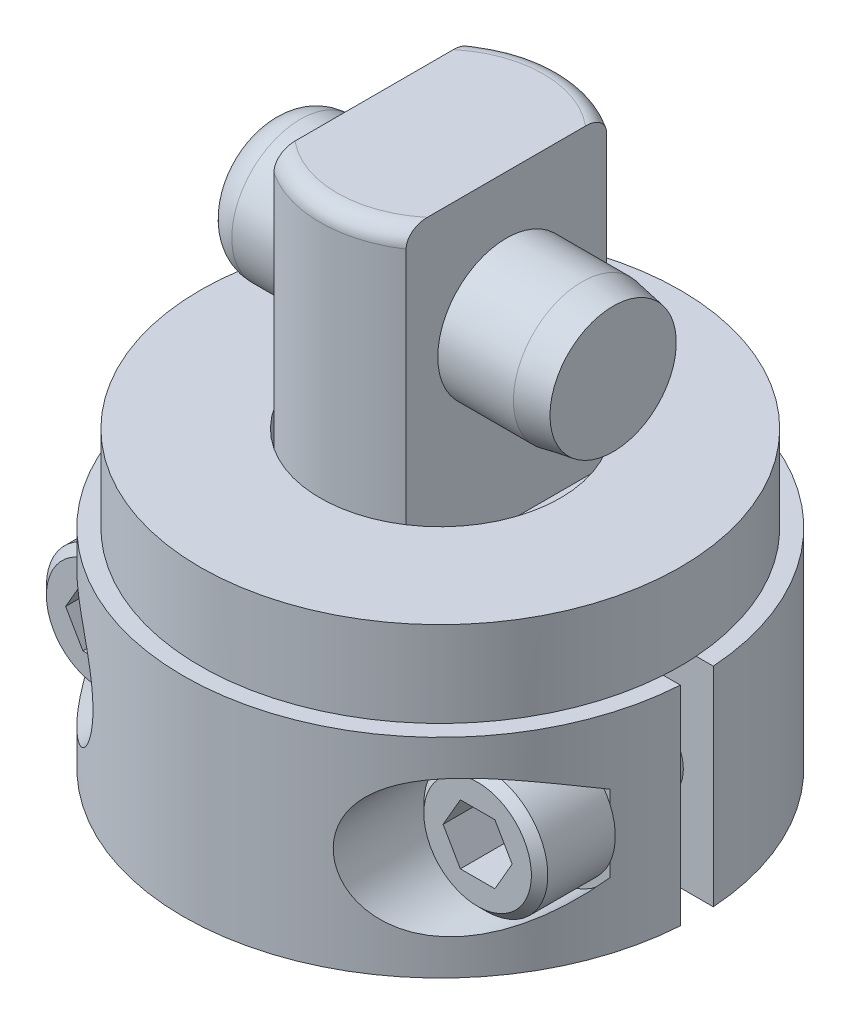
ISO-10303-21;
HEADER;
FILE_DESCRIPTION(('STEP AP214'),'2;1');
FILE_NAME('part.step','',(''),(''),'','','');
FILE_SCHEMA(('AUTOMOTIVE_DESIGN { 1 0 10303 214 1 1 1 1 }'));
ENDSEC;
DATA;
#1=APPLICATION_CONTEXT('core data for automotive mechanical design processes');
#2=APPLICATION_PROTOCOL_DEFINITION('international standard','automotive_design',2000,#1);
#3=PRODUCT_CONTEXT('',#1,'mechanical');
#4=PRODUCT('Part','Part','',(#3));
#5=PRODUCT_RELATED_PRODUCT_CATEGORY('part','',(#4));
#6=PRODUCT_DEFINITION_FORMATION('','',#4);
#7=PRODUCT_DEFINITION_CONTEXT('part definition',#1,'design');
#8=PRODUCT_DEFINITION('design','',#6,#7);
#9=PRODUCT_DEFINITION_SHAPE('','',#8);
#10=(LENGTH_UNIT() NAMED_UNIT(*) SI_UNIT(.MILLI.,.METRE.));
#11=(NAMED_UNIT(*) PLANE_ANGLE_UNIT() SI_UNIT($,.RADIAN.));
#12=(NAMED_UNIT(*) SI_UNIT($,.STERADIAN.) SOLID_ANGLE_UNIT());
#13=UNCERTAINTY_MEASURE_WITH_UNIT(LENGTH_MEASURE(1.E-05),#10,'distance_accuracy_value','');
#14=(GEOMETRIC_REPRESENTATION_CONTEXT(3) GLOBAL_UNCERTAINTY_ASSIGNED_CONTEXT((#13)) GLOBAL_UNIT_ASSIGNED_CONTEXT((#10,
#11,#12)) REPRESENTATION_CONTEXT('',''));
#15=CARTESIAN_POINT('',(0.,0.,0.));
#16=DIRECTION('',(0.,0.,1.));
#17=DIRECTION('',(1.,0.,0.));
#18=AXIS2_PLACEMENT_3D('',#15,#16,#17);
#19=CARTESIAN_POINT('',(0.,-15.35938,0.));
#20=DIRECTION('',(0.,-1.,0.));
#21=DIRECTION('',(0.,0.,-1.));
#22=AXIS2_PLACEMENT_3D('',#19,#20,#21);
#23=CYLINDRICAL_SURFACE('',#22,5.5626);
#24=DIRECTION('',(0.,1.,0.));
#25=VECTOR('',#24,1.);
#26=CARTESIAN_POINT('',(-5.51016104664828,-4.826,0.762));
#27=LINE('',#26,#25);
#28=CARTESIAN_POINT('',(-5.51016104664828,0.,0.762));
#29=VERTEX_POINT('',#28);
#30=CARTESIAN_POINT('',(-5.51016104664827,4.826,0.761999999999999));
#31=VERTEX_POINT('',#30);
#32=EDGE_CURVE('E468',#29,#31,#27,.T.);
#33=ORIENTED_EDGE('',*,*,#32,.T.);
#34=CARTESIAN_POINT('',(0.,4.826,0.));
#35=DIRECTION('',(0.,1.,0.));
#36=DIRECTION('',(0.,0.,1.));
#37=AXIS2_PLACEMENT_3D('',#34,#35,#36);
#38=CIRCLE('',#37,5.5626);
#39=CARTESIAN_POINT('',(-5.51016104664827,4.826,-0.761999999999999));
#40=VERTEX_POINT('',#39);
#41=EDGE_CURVE('E615',#40,#31,#38,.T.);
#42=ORIENTED_EDGE('',*,*,#41,.F.);
#43=DIRECTION('',(0.,1.,0.));
#44=VECTOR('',#43,1.);
#45=CARTESIAN_POINT('',(-5.51016104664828,-4.826,-0.762));
#46=LINE('',#45,#44);
#47=CARTESIAN_POINT('',(-5.51016104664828,0.,-0.762));
#48=VERTEX_POINT('',#47);
#49=EDGE_CURVE('E441',#48,#40,#46,.T.);
#50=ORIENTED_EDGE('',*,*,#49,.F.);
#51=CARTESIAN_POINT('',(0.,0.,0.));
#52=DIRECTION('',(0.,-1.,0.));
#53=DIRECTION('',(0.,0.,-1.));
#54=AXIS2_PLACEMENT_3D('',#51,#52,#53);
#55=CIRCLE('',#54,5.5626);
#56=EDGE_CURVE('E320',#29,#48,#55,.T.);
#57=ORIENTED_EDGE('',*,*,#56,.F.);
#58=EDGE_LOOP('',(#33,#42,#50,#57));
#59=FACE_BOUND('',#58,.T.);
#60=ADVANCED_FACE('F32',(#59),#23,.T.);
#61=DIRECTION('',(0.,1.,0.));
#62=VECTOR('',#61,1.);
#63=CARTESIAN_POINT('',(5.51016104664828,-4.826,-0.762));
#64=LINE('',#63,#62);
#65=CARTESIAN_POINT('',(5.51016104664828,0.,-0.762));
#66=VERTEX_POINT('',#65);
#67=CARTESIAN_POINT('',(5.51016104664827,4.826,-0.761999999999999));
#68=VERTEX_POINT('',#67);
#69=EDGE_CURVE('E436',#66,#68,#64,.T.);
#70=ORIENTED_EDGE('',*,*,#69,.T.);
#71=CARTESIAN_POINT('',(5.51016104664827,4.826,0.761999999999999));
#72=VERTEX_POINT('',#71);
#73=EDGE_CURVE('E298',#72,#68,#38,.T.);
#74=ORIENTED_EDGE('',*,*,#73,.F.);
#75=DIRECTION('',(0.,1.,0.));
#76=VECTOR('',#75,1.);
#77=CARTESIAN_POINT('',(5.51016104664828,-4.826,0.762));
#78=LINE('',#77,#76);
#79=CARTESIAN_POINT('',(5.51016104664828,0.,0.762));
#80=VERTEX_POINT('',#79);
#81=EDGE_CURVE('E473',#80,#72,#78,.T.);
#82=ORIENTED_EDGE('',*,*,#81,.F.);
#83=EDGE_CURVE('E315',#66,#80,#55,.T.);
#84=ORIENTED_EDGE('',*,*,#83,.F.);
#85=EDGE_LOOP('',(#70,#74,#82,#84));
#86=FACE_BOUND('',#85,.T.);
#87=ADVANCED_FACE('F367',(#86),#23,.T.);
#88=CARTESIAN_POINT('',(0.,4.826,0.));
#89=DIRECTION('',(0.,1.,0.));
#90=DIRECTION('',(0.,0.,1.));
#91=AXIS2_PLACEMENT_3D('',#88,#89,#90);
#92=PLANE('',#91);
#93=DIRECTION('',(1.,0.,0.));
#94=VECTOR('',#93,1.);
#95=CARTESIAN_POINT('',(-5.51016104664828,4.826,-0.762));
#96=LINE('',#95,#94);
#97=CARTESIAN_POINT('',(-11.8754779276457,4.826,-0.761999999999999));
#98=VERTEX_POINT('',#97);
#99=CARTESIAN_POINT('',(-11.0863435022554,4.826,-0.762000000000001));
#100=VERTEX_POINT('',#99);
#101=EDGE_CURVE('E456',#98,#100,#96,.T.);
#102=ORIENTED_EDGE('',*,*,#101,.T.);
#103=CARTESIAN_POINT('',(0.,4.826,0.));
#104=DIRECTION('',(0.,1.,0.));
#105=DIRECTION('',(0.,0.,1.));
#106=AXIS2_PLACEMENT_3D('',#103,#104,#105);
#107=CIRCLE('',#106,11.1125);
#108=CARTESIAN_POINT('',(11.0863435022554,4.826,-0.762000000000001));
#109=VERTEX_POINT('',#108);
#110=EDGE_CURVE('E612',#109,#100,#107,.T.);
#111=ORIENTED_EDGE('',*,*,#110,.F.);
#112=DIRECTION('',(1.,0.,0.));
#113=VECTOR('',#112,1.);
#114=CARTESIAN_POINT('',(5.51016104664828,4.826,-0.762));
#115=LINE('',#114,#113);
#116=CARTESIAN_POINT('',(11.8754779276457,4.826,-0.762000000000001));
#117=VERTEX_POINT('',#116);
#118=EDGE_CURVE('E464',#109,#117,#115,.T.);
#119=ORIENTED_EDGE('',*,*,#118,.T.);
#120=CARTESIAN_POINT('',(0.,4.826,0.));
#121=DIRECTION('',(0.,1.,0.));
#122=DIRECTION('',(0.,0.,1.));
#123=AXIS2_PLACEMENT_3D('',#120,#121,#122);
#124=CIRCLE('',#123,11.8999);
#125=EDGE_CURVE('E459',#117,#98,#124,.T.);
#126=ORIENTED_EDGE('',*,*,#125,.T.);
#127=EDGE_LOOP('',(#102,#111,#119,#126));
#128=FACE_BOUND('',#127,.T.);
#129=ADVANCED_FACE('F387',(#128),#92,.T.);
#130=CARTESIAN_POINT('',(0.,4.826,0.));
#131=DIRECTION('',(0.,1.,0.));
#132=DIRECTION('',(0.,0.,1.));
#133=AXIS2_PLACEMENT_3D('',#130,#131,#132);
#134=PLANE('',#133);
#135=DIRECTION('',(-1.,0.,0.));
#136=VECTOR('',#135,1.);
#137=CARTESIAN_POINT('',(5.51016104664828,4.826,0.762));
#138=LINE('',#137,#136);
#139=CARTESIAN_POINT('',(11.8754779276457,4.826,0.762000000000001));
#140=VERTEX_POINT('',#139);
#141=CARTESIAN_POINT('',(11.0863435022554,4.826,0.762000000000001));
#142=VERTEX_POINT('',#141);
#143=EDGE_CURVE('E489',#140,#142,#138,.T.);
#144=ORIENTED_EDGE('',*,*,#143,.T.);
#145=CARTESIAN_POINT('',(0.,4.826,0.));
#146=DIRECTION('',(0.,1.,0.));
#147=DIRECTION('',(0.,0.,1.));
#148=AXIS2_PLACEMENT_3D('',#145,#146,#147);
#149=CIRCLE('',#148,11.1125);
#150=CARTESIAN_POINT('',(-11.0863435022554,4.826,0.762000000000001));
#151=VERTEX_POINT('',#150);
#152=EDGE_CURVE('E11',#142,#151,#149,.F.);
#153=ORIENTED_EDGE('',*,*,#152,.T.);
#154=DIRECTION('',(-1.,0.,0.));
#155=VECTOR('',#154,1.);
#156=CARTESIAN_POINT('',(-5.51016104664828,4.826,0.762));
#157=LINE('',#156,#155);
#158=CARTESIAN_POINT('',(-11.8754779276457,4.826,0.761999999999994));
#159=VERTEX_POINT('',#158);
#160=EDGE_CURVE('E498',#151,#159,#157,.T.);
#161=ORIENTED_EDGE('',*,*,#160,.T.);
#162=CARTESIAN_POINT('',(0.,4.826,0.));
#163=DIRECTION('',(0.,1.,0.));
#164=DIRECTION('',(0.,0.,1.));
#165=AXIS2_PLACEMENT_3D('',#162,#163,#164);
#166=CIRCLE('',#165,11.8999);
#167=EDGE_CURVE('E493',#159,#140,#166,.T.);
#168=ORIENTED_EDGE('',*,*,#167,.T.);
#169=EDGE_LOOP('',(#144,#153,#161,#168));
#170=FACE_BOUND('',#169,.T.);
#171=ADVANCED_FACE('F656',(#170),#134,.T.);
#172=CARTESIAN_POINT('',(-8.7376,0.,3.5052));
#173=DIRECTION('',(0.,0.,1.));
#174=DIRECTION('',(1.,0.,0.));
#175=AXIS2_PLACEMENT_3D('',#172,#173,#174);
#176=PLANE('',#175);
#177=DIRECTION('',(0.,1.,0.));
#178=VECTOR('',#177,1.);
#179=CARTESIAN_POINT('',(-11.3719476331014,-4.826,3.5052));
#180=LINE('',#179,#178);
#181=CARTESIAN_POINT('',(-11.3719476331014,1.13941238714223,3.5052));
#182=VERTEX_POINT('',#181);
#183=CARTESIAN_POINT('',(-11.3719476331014,1.77224082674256,3.5052));
#184=VERTEX_POINT('',#183);
#185=EDGE_CURVE('E754',#182,#184,#180,.T.);
#186=ORIENTED_EDGE('',*,*,#185,.F.);
#187=CARTESIAN_POINT('',(-8.7376,0.,3.5052));
#188=DIRECTION('',(0.,0.,1.));
#189=DIRECTION('',(1.,0.,0.));
#190=AXIS2_PLACEMENT_3D('',#187,#188,#189);
#191=CIRCLE('',#190,2.8702);
#192=CARTESIAN_POINT('',(-11.3719476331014,-1.13941238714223,3.5052));
#193=VERTEX_POINT('',#192);
#194=EDGE_CURVE('E906',#182,#193,#191,.F.);
#195=ORIENTED_EDGE('',*,*,#194,.T.);
#196=CARTESIAN_POINT('',(-11.3719476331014,-1.77224082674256,3.5052));
#197=VERTEX_POINT('',#196);
#198=EDGE_CURVE('E755',#197,#193,#180,.T.);
#199=ORIENTED_EDGE('',*,*,#198,.F.);
#200=CARTESIAN_POINT('',(-8.7376,0.,3.5052));
#201=DIRECTION('',(0.,0.,1.));
#202=DIRECTION('',(1.,0.,0.));
#203=AXIS2_PLACEMENT_3D('',#200,#201,#202);
#204=CIRCLE('',#203,3.175);
#205=EDGE_CURVE('E502',#197,#184,#204,.T.);
#206=ORIENTED_EDGE('',*,*,#205,.T.);
#207=EDGE_LOOP('',(#186,#195,#199,#206));
#208=FACE_BOUND('',#207,.T.);
#209=ADVANCED_FACE('F771',(#208),#176,.T.);
#210=CARTESIAN_POINT('',(8.7376,0.,3.5052));
#211=DIRECTION('',(0.,0.,1.));
#212=DIRECTION('',(1.,0.,0.));
#213=AXIS2_PLACEMENT_3D('',#210,#211,#212);
#214=PLANE('',#213);
#215=DIRECTION('',(0.,1.,0.));
#216=VECTOR('',#215,1.);
#217=CARTESIAN_POINT('',(11.3719476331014,-4.826,3.5052));
#218=LINE('',#217,#216);
#219=CARTESIAN_POINT('',(11.3719476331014,-1.13941238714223,3.5052));
#220=VERTEX_POINT('',#219);
#221=CARTESIAN_POINT('',(11.3719476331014,-1.77224082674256,3.5052));
#222=VERTEX_POINT('',#221);
#223=EDGE_CURVE('E741',#220,#222,#218,.F.);
#224=ORIENTED_EDGE('',*,*,#223,.F.);
#225=CARTESIAN_POINT('',(8.7376,0.,3.5052));
#226=DIRECTION('',(0.,0.,1.));
#227=DIRECTION('',(1.,0.,0.));
#228=AXIS2_PLACEMENT_3D('',#225,#226,#227);
#229=CIRCLE('',#228,2.8702);
#230=CARTESIAN_POINT('',(11.3719476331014,1.13941238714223,3.5052));
#231=VERTEX_POINT('',#230);
#232=EDGE_CURVE('E505',#231,#220,#229,.T.);
#233=ORIENTED_EDGE('',*,*,#232,.F.);
#234=CARTESIAN_POINT('',(11.3719476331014,1.77224082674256,3.5052));
#235=VERTEX_POINT('',#234);
#236=EDGE_CURVE('E742',#235,#231,#218,.F.);
#237=ORIENTED_EDGE('',*,*,#236,.F.);
#238=CARTESIAN_POINT('',(8.7376,0.,3.5052));
#239=DIRECTION('',(0.,0.,1.));
#240=DIRECTION('',(1.,0.,0.));
#241=AXIS2_PLACEMENT_3D('',#238,#239,#240);
#242=CIRCLE('',#241,3.175);
#243=EDGE_CURVE('E499',#235,#222,#242,.T.);
#244=ORIENTED_EDGE('',*,*,#243,.T.);
#245=EDGE_LOOP('',(#224,#233,#237,#244));
#246=FACE_BOUND('',#245,.T.);
#247=ADVANCED_FACE('F767',(#246),#214,.T.);
#248=CARTESIAN_POINT('',(0.,-4.826,0.));
#249=DIRECTION('',(0.,1.,0.));
#250=DIRECTION('',(0.,0.,1.));
#251=AXIS2_PLACEMENT_3D('',#248,#249,#250);
#252=CYLINDRICAL_SURFACE('',#251,11.8999);
#253=ORIENTED_EDGE('',*,*,#236,.T.);
#254=EDGE_CURVE('E746',#231,#220,#218,.F.);
#255=ORIENTED_EDGE('',*,*,#254,.T.);
#256=ORIENTED_EDGE('',*,*,#223,.T.);
#257=CARTESIAN_POINT('',(11.3719476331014,-1.77224082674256,3.5052));
#258=CARTESIAN_POINT('',(11.3001244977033,-1.87895024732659,3.73817073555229));
#259=CARTESIAN_POINT('',(11.2207820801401,-1.9829228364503,3.97018960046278));
#260=CARTESIAN_POINT('',(11.0464955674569,-2.18342953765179,4.43212119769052));
#261=CARTESIAN_POINT('',(10.9515228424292,-2.2799495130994,4.66202923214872));
#262=CARTESIAN_POINT('',(10.744533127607,-2.46419181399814,5.12120349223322));
#263=CARTESIAN_POINT('',(10.632338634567,-2.55180458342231,5.35043426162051));
#264=CARTESIAN_POINT('',(10.3913815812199,-2.71417151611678,5.80454975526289));
#265=CARTESIAN_POINT('',(10.2626325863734,-2.78893609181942,6.02943786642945));
#266=CARTESIAN_POINT('',(10.035242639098,-2.8994496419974,6.39773783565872));
#267=CARTESIAN_POINT('',(9.9413570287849,-2.93979859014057,6.54271912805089));
#268=CARTESIAN_POINT('',(9.74634383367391,-3.01228843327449,6.82982419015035));
#269=CARTESIAN_POINT('',(9.64521788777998,-3.04443117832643,6.97194859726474));
#270=CARTESIAN_POINT('',(9.43614773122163,-3.0990802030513,7.25239554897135));
#271=CARTESIAN_POINT('',(9.32822330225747,-3.12161308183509,7.39072758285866));
#272=CARTESIAN_POINT('',(9.10564005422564,-3.15560481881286,7.66328058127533));
#273=CARTESIAN_POINT('',(8.99098286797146,-3.1670663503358,7.79750253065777));
#274=CARTESIAN_POINT('',(8.7807742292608,-3.17605538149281,8.03273933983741));
#275=CARTESIAN_POINT('',(8.68639352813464,-3.17604244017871,8.13470677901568));
#276=CARTESIAN_POINT('',(8.49432832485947,-3.16712574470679,8.33506178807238));
#277=CARTESIAN_POINT('',(8.39664467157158,-3.15822425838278,8.43345026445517));
#278=CARTESIAN_POINT('',(8.19867815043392,-3.13052094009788,8.62602629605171));
#279=CARTESIAN_POINT('',(8.09839739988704,-3.11172694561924,8.72021711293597));
#280=CARTESIAN_POINT('',(7.89614869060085,-3.06323572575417,8.90377152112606));
#281=CARTESIAN_POINT('',(7.79418122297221,-3.03354162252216,8.99313648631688));
#282=CARTESIAN_POINT('',(7.53685279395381,-2.94375877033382,9.21110684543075));
#283=CARTESIAN_POINT('',(7.38104499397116,-2.87589242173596,9.33621260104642));
#284=CARTESIAN_POINT('',(7.15085533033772,-2.7514548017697,9.51222063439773));
#285=CARTESIAN_POINT('',(7.07468095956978,-2.70617862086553,9.56896975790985));
#286=CARTESIAN_POINT('',(6.92438772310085,-2.60786043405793,9.67827825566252));
#287=CARTESIAN_POINT('',(6.85026782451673,-2.55482241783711,9.73083976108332));
#288=CARTESIAN_POINT('',(6.70434381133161,-2.44032399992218,9.83195616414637));
#289=CARTESIAN_POINT('',(6.63256978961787,-2.37878560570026,9.88046637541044));
#290=CARTESIAN_POINT('',(6.49325463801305,-2.24781488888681,9.97257402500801));
#291=CARTESIAN_POINT('',(6.42571130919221,-2.17838672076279,10.0161740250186));
#292=CARTESIAN_POINT('',(6.29599103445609,-2.03192918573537,10.0982180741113));
#293=CARTESIAN_POINT('',(6.2338121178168,-1.9549026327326,10.136664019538));
#294=CARTESIAN_POINT('',(6.11594105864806,-1.79373643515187,10.2082143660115));
#295=CARTESIAN_POINT('',(6.060247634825,-1.70959820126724,10.2413198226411));
#296=CARTESIAN_POINT('',(5.96415610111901,-1.54793882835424,10.2975280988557));
#297=CARTESIAN_POINT('',(5.92271527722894,-1.47129738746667,10.3213863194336));
#298=CARTESIAN_POINT('',(5.84591207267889,-1.31393664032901,10.3650800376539));
#299=CARTESIAN_POINT('',(5.8105488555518,-1.23321789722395,10.3849160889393));
#300=CARTESIAN_POINT('',(5.74643924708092,-1.06836154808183,10.4205280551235));
#301=CARTESIAN_POINT('',(5.71769010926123,-0.984225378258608,10.436305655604));
#302=CARTESIAN_POINT('',(5.6672249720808,-0.813253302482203,10.4637945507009));
#303=CARTESIAN_POINT('',(5.64550852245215,-0.726417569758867,10.4755061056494));
#304=CARTESIAN_POINT('',(5.59494420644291,-0.48004812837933,10.5026502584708));
#305=CARTESIAN_POINT('',(5.57439800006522,-0.318191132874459,10.5135054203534));
#306=CARTESIAN_POINT('',(5.55843263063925,0.00698258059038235,10.521954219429));
#307=CARTESIAN_POINT('',(5.563006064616,0.170298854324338,10.5195517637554));
#308=CARTESIAN_POINT('',(5.5965013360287,0.488904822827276,10.5017677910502));
#309=CARTESIAN_POINT('',(5.62471629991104,0.644290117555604,10.4867630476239));
#310=CARTESIAN_POINT('',(5.7032464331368,0.947555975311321,10.4442603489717));
#311=CARTESIAN_POINT('',(5.75356068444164,1.09543684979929,10.4167629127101));
#312=CARTESIAN_POINT('',(5.87458753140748,1.38135302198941,10.3489937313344));
#313=CARTESIAN_POINT('',(5.94550919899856,1.519268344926,10.3085906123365));
#314=CARTESIAN_POINT('',(6.10427202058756,1.78032724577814,10.2153771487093));
#315=CARTESIAN_POINT('',(6.19211522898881,1.90346902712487,10.1625652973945));
#316=CARTESIAN_POINT('',(6.38585944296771,2.13877589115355,10.0420149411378));
#317=CARTESIAN_POINT('',(6.49246294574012,2.25003448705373,9.97364197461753));
#318=CARTESIAN_POINT('',(6.71563563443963,2.45255474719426,9.82475725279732));
#319=CARTESIAN_POINT('',(6.83220820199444,2.54380958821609,9.74424137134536));
#320=CARTESIAN_POINT('',(7.08465484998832,2.71556390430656,9.56253658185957));
#321=CARTESIAN_POINT('',(7.22121513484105,2.79365483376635,9.46003759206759));
#322=CARTESIAN_POINT('',(7.49648954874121,2.92637310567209,9.24342863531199));
#323=CARTESIAN_POINT('',(7.63520500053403,2.98098539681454,9.1293112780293));
#324=CARTESIAN_POINT('',(7.87967490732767,3.05894130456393,8.91842111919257));
#325=CARTESIAN_POINT('',(7.98577743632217,3.08656579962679,8.82357560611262));
#326=CARTESIAN_POINT('',(8.19578780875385,3.13026692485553,8.62885764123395));
#327=CARTESIAN_POINT('',(8.2996946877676,3.14633857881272,8.52898304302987));
#328=CARTESIAN_POINT('',(8.50447047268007,3.1681061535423,8.32481514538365));
#329=CARTESIAN_POINT('',(8.60533457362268,3.17378643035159,8.2205154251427));
#330=CARTESIAN_POINT('',(8.80323137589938,3.17586394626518,8.0082341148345));
#331=CARTESIAN_POINT('',(8.90026287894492,3.17225830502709,7.90025139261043));
#332=CARTESIAN_POINT('',(9.13403866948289,3.1532345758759,7.63032947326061));
#333=CARTESIAN_POINT('',(9.26833313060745,3.13311413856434,7.46658991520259));
#334=CARTESIAN_POINT('',(9.52690184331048,3.07816654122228,7.13373961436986));
#335=CARTESIAN_POINT('',(9.65117105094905,3.04333203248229,6.96462622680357));
#336=CARTESIAN_POINT('',(9.88969603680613,2.96129282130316,6.6215797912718));
#337=CARTESIAN_POINT('',(10.0039177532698,2.91404805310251,6.4476327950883));
#338=CARTESIAN_POINT('',(10.221798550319,2.80933906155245,6.09632511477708));
#339=CARTESIAN_POINT('',(10.3254594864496,2.75187663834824,5.91896503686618));
#340=CARTESIAN_POINT('',(10.5245250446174,2.627095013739,5.55747369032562));
#341=CARTESIAN_POINT('',(10.6196947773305,2.55958502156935,5.37327955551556));
#342=CARTESIAN_POINT('',(10.799316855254,2.41724628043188,5.00248165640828));
#343=CARTESIAN_POINT('',(10.8837670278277,2.34241605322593,4.81587741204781));
#344=CARTESIAN_POINT('',(11.0412943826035,2.18762089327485,4.44274919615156));
#345=CARTESIAN_POINT('',(11.1144842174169,2.1077199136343,4.25624598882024));
#346=CARTESIAN_POINT('',(11.2507363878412,1.94323040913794,3.88177510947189));
#347=CARTESIAN_POINT('',(11.3138055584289,1.85864510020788,3.6938085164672));
#348=CARTESIAN_POINT('',(11.3719476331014,1.77224082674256,3.5052));
#349=B_SPLINE_CURVE_WITH_KNOTS('',3,(#257,#258,#259,#260,#261,#262,#263,#264,#265,#266,#267,
#268,#269,#270,#271,#272,#273,#274,#275,#276,#277,#278,#279,#280,#281,#282,#283,#284,#285,#286,
#287,#288,#289,#290,#291,#292,#293,#294,#295,#296,#297,#298,#299,#300,#301,#302,#303,#304,#305,
#306,#307,#308,#309,#310,#311,#312,#313,#314,#315,#316,#317,#318,#319,#320,#321,#322,#323,#324,
#325,#326,#327,#328,#329,#330,#331,#332,#333,#334,#335,#336,#337,#338,#339,#340,#341,#342,#343,
#344,#345,#346,#347,#348),.UNSPECIFIED.,.F.,.F.,(4,2,2,2,2,2,2,2,2,2,2,2,2,2,2,2,2,2,2,2,2,2,2,
2,2,2,2,2,2,2,2,2,2,2,2,2,2,2,2,2,2,2,2,2,2,4),(0.,0.798393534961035,1.59826609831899,
2.40701796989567,3.21511128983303,3.74693020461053,4.27862911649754,4.80884663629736,
5.33893609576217,5.75543555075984,6.17182876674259,6.58789258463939,7.00383732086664,
7.63404585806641,7.9494171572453,8.26462691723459,8.58294909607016,8.90110442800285,
9.2191423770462,9.53711738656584,9.80775390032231,10.078353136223,10.3488398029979,
10.6193091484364,11.1072111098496,11.5949692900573,12.06864344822,12.5422979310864,
13.0209364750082,13.4996331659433,14.0032768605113,14.5070920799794,15.0682861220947,
15.6298393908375,16.0641787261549,16.4987050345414,16.9338849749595,17.3691999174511,
18.0063803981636,18.6438794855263,19.2834625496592,19.9229330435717,20.5766251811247,
21.2304495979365,21.8772349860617,22.5235817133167),.UNSPECIFIED.);
#350=EDGE_CURVE('E745',#222,#235,#349,.T.);
#351=ORIENTED_EDGE('',*,*,#350,.T.);
#352=EDGE_LOOP('',(#253,#255,#256,#351));
#353=FACE_BOUND('',#352,.T.);
#354=DIRECTION('',(0.,1.,0.));
#355=VECTOR('',#354,1.);
#356=CARTESIAN_POINT('',(11.8754779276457,-4.826,0.762000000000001));
#357=LINE('',#356,#355);
#358=CARTESIAN_POINT('',(11.8754779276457,-4.826,0.762000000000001));
#359=VERTEX_POINT('',#358);
#360=EDGE_CURVE('E471',#359,#140,#357,.T.);
#361=ORIENTED_EDGE('',*,*,#360,.T.);
#362=ORIENTED_EDGE('',*,*,#167,.F.);
#363=DIRECTION('',(0.,1.,0.));
#364=VECTOR('',#363,1.);
#365=CARTESIAN_POINT('',(-11.8754779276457,-4.826,0.761999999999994));
#366=LINE('',#365,#364);
#367=CARTESIAN_POINT('',(-11.8754779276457,-4.826,0.761999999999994));
#368=VERTEX_POINT('',#367);
#369=EDGE_CURVE('E467',#368,#159,#366,.T.);
#370=ORIENTED_EDGE('',*,*,#369,.F.);
#371=CARTESIAN_POINT('',(0.,-4.826,0.));
#372=DIRECTION('',(0.,1.,0.));
#373=DIRECTION('',(0.,0.,1.));
#374=AXIS2_PLACEMENT_3D('',#371,#372,#373);
#375=CIRCLE('',#374,11.8999);
#376=EDGE_CURVE('E480',#368,#359,#375,.T.);
#377=ORIENTED_EDGE('',*,*,#376,.T.);
#378=EDGE_LOOP('',(#361,#362,#370,#377));
#379=FACE_BOUND('',#378,.T.);
#380=ORIENTED_EDGE('',*,*,#198,.T.);
#381=EDGE_CURVE('E1399',#193,#182,#180,.T.);
#382=ORIENTED_EDGE('',*,*,#381,.T.);
#383=ORIENTED_EDGE('',*,*,#185,.T.);
#384=CARTESIAN_POINT('',(-11.3719476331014,1.77224082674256,3.5052));
#385=CARTESIAN_POINT('',(-11.3001244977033,1.87895024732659,3.73817073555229));
#386=CARTESIAN_POINT('',(-11.2207820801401,1.9829228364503,3.97018960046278));
#387=CARTESIAN_POINT('',(-11.0464955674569,2.18342953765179,4.43212119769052));
#388=CARTESIAN_POINT('',(-10.9515228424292,2.2799495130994,4.66202923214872));
#389=CARTESIAN_POINT('',(-10.744533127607,2.46419181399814,5.12120349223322));
#390=CARTESIAN_POINT('',(-10.632338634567,2.55180458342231,5.35043426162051));
#391=CARTESIAN_POINT('',(-10.3913815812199,2.71417151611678,5.80454975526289));
#392=CARTESIAN_POINT('',(-10.2626325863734,2.78893609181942,6.02943786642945));
#393=CARTESIAN_POINT('',(-10.035242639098,2.8994496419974,6.39773783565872));
#394=CARTESIAN_POINT('',(-9.9413570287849,2.93979859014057,6.54271912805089));
#395=CARTESIAN_POINT('',(-9.74634383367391,3.01228843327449,6.82982419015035));
#396=CARTESIAN_POINT('',(-9.64521788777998,3.04443117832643,6.97194859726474));
#397=CARTESIAN_POINT('',(-9.43614773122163,3.0990802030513,7.25239554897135));
#398=CARTESIAN_POINT('',(-9.32822330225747,3.12161308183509,7.39072758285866));
#399=CARTESIAN_POINT('',(-9.10564005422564,3.15560481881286,7.66328058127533));
#400=CARTESIAN_POINT('',(-8.99098286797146,3.1670663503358,7.79750253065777));
#401=CARTESIAN_POINT('',(-8.7807742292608,3.17605538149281,8.03273933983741));
#402=CARTESIAN_POINT('',(-8.68639352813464,3.17604244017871,8.13470677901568));
#403=CARTESIAN_POINT('',(-8.49432832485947,3.16712574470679,8.33506178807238));
#404=CARTESIAN_POINT('',(-8.39664467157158,3.15822425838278,8.43345026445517));
#405=CARTESIAN_POINT('',(-8.19867815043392,3.13052094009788,8.62602629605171));
#406=CARTESIAN_POINT('',(-8.09839739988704,3.11172694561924,8.72021711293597));
#407=CARTESIAN_POINT('',(-7.89614869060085,3.06323572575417,8.90377152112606));
#408=CARTESIAN_POINT('',(-7.79418122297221,3.03354162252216,8.99313648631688));
#409=CARTESIAN_POINT('',(-7.53685279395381,2.94375877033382,9.21110684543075));
#410=CARTESIAN_POINT('',(-7.38104499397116,2.87589242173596,9.33621260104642));
#411=CARTESIAN_POINT('',(-7.15085533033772,2.7514548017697,9.51222063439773));
#412=CARTESIAN_POINT('',(-7.07468095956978,2.70617862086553,9.56896975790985));
#413=CARTESIAN_POINT('',(-6.92438772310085,2.60786043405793,9.67827825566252));
#414=CARTESIAN_POINT('',(-6.85026782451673,2.55482241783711,9.73083976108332));
#415=CARTESIAN_POINT('',(-6.70434381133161,2.44032399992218,9.83195616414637));
#416=CARTESIAN_POINT('',(-6.63256978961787,2.37878560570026,9.88046637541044));
#417=CARTESIAN_POINT('',(-6.49325463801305,2.24781488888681,9.97257402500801));
#418=CARTESIAN_POINT('',(-6.42571130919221,2.17838672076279,10.0161740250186));
#419=CARTESIAN_POINT('',(-6.29599103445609,2.03192918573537,10.0982180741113));
#420=CARTESIAN_POINT('',(-6.2338121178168,1.9549026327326,10.136664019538));
#421=CARTESIAN_POINT('',(-6.11594105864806,1.79373643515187,10.2082143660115));
#422=CARTESIAN_POINT('',(-6.060247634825,1.70959820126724,10.2413198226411));
#423=CARTESIAN_POINT('',(-5.96415610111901,1.54793882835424,10.2975280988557));
#424=CARTESIAN_POINT('',(-5.92271527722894,1.47129738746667,10.3213863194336));
#425=CARTESIAN_POINT('',(-5.84591207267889,1.31393664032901,10.3650800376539));
#426=CARTESIAN_POINT('',(-5.8105488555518,1.23321789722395,10.3849160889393));
#427=CARTESIAN_POINT('',(-5.74643924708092,1.06836154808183,10.4205280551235));
#428=CARTESIAN_POINT('',(-5.71769010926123,0.984225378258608,10.436305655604));
#429=CARTESIAN_POINT('',(-5.6672249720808,0.813253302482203,10.4637945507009));
#430=CARTESIAN_POINT('',(-5.64550852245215,0.726417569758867,10.4755061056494));
#431=CARTESIAN_POINT('',(-5.59494420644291,0.48004812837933,10.5026502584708));
#432=CARTESIAN_POINT('',(-5.57439800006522,0.318191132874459,10.5135054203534));
#433=CARTESIAN_POINT('',(-5.55843263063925,-0.00698258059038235,10.521954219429));
#434=CARTESIAN_POINT('',(-5.563006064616,-0.170298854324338,10.5195517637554));
#435=CARTESIAN_POINT('',(-5.5965013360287,-0.488904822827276,10.5017677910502));
#436=CARTESIAN_POINT('',(-5.62471629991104,-0.644290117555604,10.4867630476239));
#437=CARTESIAN_POINT('',(-5.7032464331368,-0.947555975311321,10.4442603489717));
#438=CARTESIAN_POINT('',(-5.75356068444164,-1.09543684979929,10.4167629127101));
#439=CARTESIAN_POINT('',(-5.87458753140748,-1.38135302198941,10.3489937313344));
#440=CARTESIAN_POINT('',(-5.94550919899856,-1.519268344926,10.3085906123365));
#441=CARTESIAN_POINT('',(-6.10427202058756,-1.78032724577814,10.2153771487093));
#442=CARTESIAN_POINT('',(-6.19211522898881,-1.90346902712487,10.1625652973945));
#443=CARTESIAN_POINT('',(-6.38585944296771,-2.13877589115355,10.0420149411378));
#444=CARTESIAN_POINT('',(-6.49246294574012,-2.25003448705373,9.97364197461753));
#445=CARTESIAN_POINT('',(-6.71563563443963,-2.45255474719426,9.82475725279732));
#446=CARTESIAN_POINT('',(-6.83220820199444,-2.54380958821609,9.74424137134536));
#447=CARTESIAN_POINT('',(-7.08465484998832,-2.71556390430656,9.56253658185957));
#448=CARTESIAN_POINT('',(-7.22121513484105,-2.79365483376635,9.46003759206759));
#449=CARTESIAN_POINT('',(-7.49648954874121,-2.92637310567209,9.24342863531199));
#450=CARTESIAN_POINT('',(-7.63520500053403,-2.98098539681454,9.1293112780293));
#451=CARTESIAN_POINT('',(-7.87967490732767,-3.05894130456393,8.91842111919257));
#452=CARTESIAN_POINT('',(-7.98577743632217,-3.08656579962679,8.82357560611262));
#453=CARTESIAN_POINT('',(-8.19578780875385,-3.13026692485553,8.62885764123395));
#454=CARTESIAN_POINT('',(-8.2996946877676,-3.14633857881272,8.52898304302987));
#455=CARTESIAN_POINT('',(-8.50447047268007,-3.1681061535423,8.32481514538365));
#456=CARTESIAN_POINT('',(-8.60533457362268,-3.17378643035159,8.2205154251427));
#457=CARTESIAN_POINT('',(-8.80323137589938,-3.17586394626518,8.0082341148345));
#458=CARTESIAN_POINT('',(-8.90026287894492,-3.17225830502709,7.90025139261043));
#459=CARTESIAN_POINT('',(-9.13403866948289,-3.1532345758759,7.63032947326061));
#460=CARTESIAN_POINT('',(-9.26833313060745,-3.13311413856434,7.46658991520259));
#461=CARTESIAN_POINT('',(-9.52690184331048,-3.07816654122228,7.13373961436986));
#462=CARTESIAN_POINT('',(-9.65117105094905,-3.04333203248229,6.96462622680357));
#463=CARTESIAN_POINT('',(-9.88969603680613,-2.96129282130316,6.6215797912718));
#464=CARTESIAN_POINT('',(-10.0039177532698,-2.91404805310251,6.4476327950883));
#465=CARTESIAN_POINT('',(-10.221798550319,-2.80933906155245,6.09632511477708));
#466=CARTESIAN_POINT('',(-10.3254594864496,-2.75187663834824,5.91896503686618));
#467=CARTESIAN_POINT('',(-10.5245250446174,-2.627095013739,5.55747369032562));
#468=CARTESIAN_POINT('',(-10.6196947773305,-2.55958502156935,5.37327955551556));
#469=CARTESIAN_POINT('',(-10.799316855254,-2.41724628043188,5.00248165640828));
#470=CARTESIAN_POINT('',(-10.8837670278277,-2.34241605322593,4.81587741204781));
#471=CARTESIAN_POINT('',(-11.0412943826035,-2.18762089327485,4.44274919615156));
#472=CARTESIAN_POINT('',(-11.1144842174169,-2.1077199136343,4.25624598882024));
#473=CARTESIAN_POINT('',(-11.2507363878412,-1.94323040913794,3.88177510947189));
#474=CARTESIAN_POINT('',(-11.3138055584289,-1.85864510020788,3.6938085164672));
#475=CARTESIAN_POINT('',(-11.3719476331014,-1.77224082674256,3.5052));
#476=B_SPLINE_CURVE_WITH_KNOTS('',3,(#384,#385,#386,#387,#388,#389,#390,#391,#392,#393,#394,
#395,#396,#397,#398,#399,#400,#401,#402,#403,#404,#405,#406,#407,#408,#409,#410,#411,#412,#413,
#414,#415,#416,#417,#418,#419,#420,#421,#422,#423,#424,#425,#426,#427,#428,#429,#430,#431,#432,
#433,#434,#435,#436,#437,#438,#439,#440,#441,#442,#443,#444,#445,#446,#447,#448,#449,#450,#451,
#452,#453,#454,#455,#456,#457,#458,#459,#460,#461,#462,#463,#464,#465,#466,#467,#468,#469,#470,
#471,#472,#473,#474,#475),.UNSPECIFIED.,.F.,.F.,(4,2,2,2,2,2,2,2,2,2,2,2,2,2,2,2,2,2,2,2,2,2,2,
2,2,2,2,2,2,2,2,2,2,2,2,2,2,2,2,2,2,2,2,2,2,4),(0.,0.798393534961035,1.59826609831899,
2.40701796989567,3.21511128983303,3.74693020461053,4.27862911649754,4.80884663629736,
5.33893609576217,5.75543555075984,6.17182876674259,6.58789258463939,7.00383732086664,
7.63404585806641,7.9494171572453,8.26462691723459,8.58294909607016,8.90110442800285,
9.2191423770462,9.53711738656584,9.80775390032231,10.078353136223,10.3488398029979,
10.6193091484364,11.1072111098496,11.5949692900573,12.06864344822,12.5422979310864,
13.0209364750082,13.4996331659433,14.0032768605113,14.5070920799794,15.0682861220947,
15.6298393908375,16.0641787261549,16.4987050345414,16.9338849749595,17.3691999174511,
18.0063803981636,18.6438794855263,19.2834625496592,19.9229330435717,20.5766251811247,
21.2304495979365,21.8772349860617,22.5235817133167),.UNSPECIFIED.);
#477=EDGE_CURVE('E900',#184,#197,#476,.T.);
#478=ORIENTED_EDGE('',*,*,#477,.T.);
#479=EDGE_LOOP('',(#380,#382,#383,#478));
#480=FACE_BOUND('',#479,.T.);
#481=ADVANCED_FACE('F362',(#353,#379,#480),#252,.T.);
#482=CARTESIAN_POINT('',(0.,0.,-5.5626));
#483=DIRECTION('',(0.,-1.,0.));
#484=DIRECTION('',(0.,0.,-1.));
#485=AXIS2_PLACEMENT_3D('',#482,#483,#484);
#486=PLANE('',#485);
#487=ORIENTED_EDGE('',*,*,#83,.T.);
#488=EDGE_CURVE('E319',#80,#29,#55,.T.);
#489=ORIENTED_EDGE('',*,*,#488,.T.);
#490=ORIENTED_EDGE('',*,*,#56,.T.);
#491=EDGE_CURVE('E314',#48,#66,#55,.T.);
#492=ORIENTED_EDGE('',*,*,#491,.T.);
#493=EDGE_LOOP('',(#487,#489,#490,#492));
#494=FACE_BOUND('',#493,.T.);
#495=CARTESIAN_POINT('',(0.,0.,0.));
#496=DIRECTION('',(0.,-1.,0.));
#497=DIRECTION('',(0.,0.,-1.));
#498=AXIS2_PLACEMENT_3D('',#495,#496,#497);
#499=CIRCLE('',#498,2.5781);
#500=CARTESIAN_POINT('',(0.,0.,-2.5781));
#501=VERTEX_POINT('',#500);
#502=EDGE_CURVE('E422',#501,#501,#499,.T.);
#503=ORIENTED_EDGE('',*,*,#502,.F.);
#504=EDGE_LOOP('',(#503));
#505=FACE_BOUND('',#504,.T.);
#506=ADVANCED_FACE('F358',(#494,#505),#486,.T.);
#507=CARTESIAN_POINT('',(0.,-2.54,0.));
#508=DIRECTION('',(0.,-1.,0.));
#509=DIRECTION('',(0.,0.,-1.));
#510=AXIS2_PLACEMENT_3D('',#507,#508,#509);
#511=PLANE('',#510);
#512=CARTESIAN_POINT('',(0.,-2.54,0.));
#513=DIRECTION('',(0.,-1.,0.));
#514=DIRECTION('',(0.,0.,-1.));
#515=AXIS2_PLACEMENT_3D('',#512,#513,#514);
#516=CIRCLE('',#515,3.175);
#517=CARTESIAN_POINT('',(0.,-2.54,-3.175));
#518=VERTEX_POINT('',#517);
#519=EDGE_CURVE('E417',#518,#518,#516,.T.);
#520=ORIENTED_EDGE('',*,*,#519,.F.);
#521=EDGE_LOOP('',(#520));
#522=FACE_BOUND('',#521,.T.);
#523=CARTESIAN_POINT('',(0.,-2.54,0.));
#524=DIRECTION('',(0.,-1.,0.));
#525=DIRECTION('',(0.,0.,-1.));
#526=AXIS2_PLACEMENT_3D('',#523,#524,#525);
#527=CIRCLE('',#526,2.5781);
#528=CARTESIAN_POINT('',(0.,-2.54,-2.5781));
#529=VERTEX_POINT('',#528);
#530=EDGE_CURVE('E421',#529,#529,#527,.T.);
#531=ORIENTED_EDGE('',*,*,#530,.T.);
#532=EDGE_LOOP('',(#531));
#533=FACE_BOUND('',#532,.T.);
#534=ADVANCED_FACE('F361',(#522,#533),#511,.F.);
#535=CARTESIAN_POINT('',(0.,-2.54,0.));
#536=DIRECTION('',(0.,1.,0.));
#537=DIRECTION('',(0.,0.,1.));
#538=AXIS2_PLACEMENT_3D('',#535,#536,#537);
#539=CYLINDRICAL_SURFACE('',#538,2.5781);
#540=ORIENTED_EDGE('',*,*,#530,.F.);
#541=EDGE_LOOP('',(#540));
#542=FACE_BOUND('',#541,.T.);
#543=ORIENTED_EDGE('',*,*,#502,.T.);
#544=EDGE_LOOP('',(#543));
#545=FACE_BOUND('',#544,.T.);
#546=ADVANCED_FACE('F352',(#542,#545),#539,.T.);
#547=CARTESIAN_POINT('',(0.,-6.35,-3.175));
#548=DIRECTION('',(0.,-1.,0.));
#549=DIRECTION('',(0.,0.,-1.));
#550=AXIS2_PLACEMENT_3D('',#547,#548,#549);
#551=PLANE('',#550);
#552=CARTESIAN_POINT('',(0.,-6.35,0.));
#553=DIRECTION('',(0.,-1.,0.));
#554=DIRECTION('',(0.,0.,-1.));
#555=AXIS2_PLACEMENT_3D('',#552,#553,#554);
#556=CIRCLE('',#555,2.413);
#557=CARTESIAN_POINT('',(0.,-6.35,-2.413));
#558=VERTEX_POINT('',#557);
#559=EDGE_CURVE('E722',#558,#558,#556,.T.);
#560=ORIENTED_EDGE('',*,*,#559,.T.);
#561=EDGE_LOOP('',(#560));
#562=FACE_BOUND('',#561,.T.);
#563=ADVANCED_FACE('F347',(#562),#551,.T.);
#564=CARTESIAN_POINT('',(0.,-15.35938,0.));
#565=DIRECTION('',(0.,-1.,0.));
#566=DIRECTION('',(0.,0.,-1.));
#567=AXIS2_PLACEMENT_3D('',#564,#565,#566);
#568=CYLINDRICAL_SURFACE('',#567,3.175);
#569=CARTESIAN_POINT('',(0.,-5.588,0.));
#570=DIRECTION('',(0.,-1.,0.));
#571=DIRECTION('',(0.,0.,-1.));
#572=AXIS2_PLACEMENT_3D('',#569,#570,#571);
#573=CIRCLE('',#572,3.175);
#574=CARTESIAN_POINT('',(0.,-5.588,-3.175));
#575=VERTEX_POINT('',#574);
#576=EDGE_CURVE('E725',#575,#575,#573,.F.);
#577=ORIENTED_EDGE('',*,*,#576,.T.);
#578=EDGE_LOOP('',(#577));
#579=FACE_BOUND('',#578,.T.);
#580=ORIENTED_EDGE('',*,*,#519,.T.);
#581=EDGE_LOOP('',(#580));
#582=FACE_BOUND('',#581,.T.);
#583=ADVANCED_FACE('F351',(#579,#582),#568,.T.);
#584=CARTESIAN_POINT('',(0.,-6.35,0.));
#585=DIRECTION('',(0.,1.,0.));
#586=DIRECTION('',(0.,0.,1.));
#587=AXIS2_PLACEMENT_3D('',#584,#585,#586);
#588=CONICAL_SURFACE('',#587,2.413,0.785398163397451);
#589=ORIENTED_EDGE('',*,*,#576,.F.);
#590=EDGE_LOOP('',(#589));
#591=FACE_BOUND('',#590,.T.);
#592=ORIENTED_EDGE('',*,*,#559,.F.);
#593=EDGE_LOOP('',(#592));
#594=FACE_BOUND('',#593,.T.);
#595=ADVANCED_FACE('F356',(#591,#594),#588,.T.);
#596=CARTESIAN_POINT('',(0.,-4.826,0.));
#597=DIRECTION('',(0.,1.,0.));
#598=DIRECTION('',(0.,0.,1.));
#599=AXIS2_PLACEMENT_3D('',#596,#597,#598);
#600=CYLINDRICAL_SURFACE('',#599,5.5626);
#601=CARTESIAN_POINT('',(5.51016104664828,-4.826,-0.762));
#602=VERTEX_POINT('',#601);
#603=EDGE_CURVE('E433',#602,#66,#64,.T.);
#604=ORIENTED_EDGE('',*,*,#603,.T.);
#605=ORIENTED_EDGE('',*,*,#491,.F.);
#606=CARTESIAN_POINT('',(-5.51016104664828,-4.826,-0.762));
#607=VERTEX_POINT('',#606);
#608=EDGE_CURVE('E425',#607,#48,#46,.T.);
#609=ORIENTED_EDGE('',*,*,#608,.F.);
#610=CARTESIAN_POINT('',(0.,-4.826,0.));
#611=DIRECTION('',(0.,-1.,0.));
#612=DIRECTION('',(0.,0.,1.));
#613=AXIS2_PLACEMENT_3D('',#610,#611,#612);
#614=CIRCLE('',#613,5.5626);
#615=EDGE_CURVE('E453',#607,#602,#614,.T.);
#616=ORIENTED_EDGE('',*,*,#615,.T.);
#617=EDGE_LOOP('',(#604,#605,#609,#616));
#618=FACE_BOUND('',#617,.T.);
#619=ADVANCED_FACE('F671',(#618),#600,.F.);
#620=CARTESIAN_POINT('',(-5.51016104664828,-4.826,-0.762));
#621=DIRECTION('',(0.,0.,1.));
#622=DIRECTION('',(1.,0.,0.));
#623=AXIS2_PLACEMENT_3D('',#620,#621,#622);
#624=PLANE('',#623);
#625=CARTESIAN_POINT('',(-8.7376,0.,-0.762000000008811));
#626=DIRECTION('',(0.,0.,1.));
#627=DIRECTION('',(1.,0.,0.));
#628=AXIS2_PLACEMENT_3D('',#625,#626,#627);
#629=CIRCLE('',#628,1.7526);
#630=CARTESIAN_POINT('',(-6.985,0.,-0.762000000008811));
#631=VERTEX_POINT('',#630);
#632=EDGE_CURVE('E40',#631,#631,#629,.T.);
#633=ORIENTED_EDGE('',*,*,#632,.F.);
#634=EDGE_LOOP('',(#633));
#635=FACE_BOUND('',#634,.T.);
#636=ORIENTED_EDGE('',*,*,#608,.T.);
#637=ORIENTED_EDGE('',*,*,#49,.T.);
#638=DIRECTION('',(-1.,0.,0.));
#639=VECTOR('',#638,1.);
#640=CARTESIAN_POINT('',(-5.51016104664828,4.826,-0.762));
#641=LINE('',#640,#639);
#642=EDGE_CURVE('E276',#40,#100,#641,.T.);
#643=ORIENTED_EDGE('',*,*,#642,.T.);
#644=ORIENTED_EDGE('',*,*,#101,.F.);
#645=DIRECTION('',(0.,1.,0.));
#646=VECTOR('',#645,1.);
#647=CARTESIAN_POINT('',(-11.8754779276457,-4.826,-0.761999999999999));
#648=LINE('',#647,#646);
#649=CARTESIAN_POINT('',(-11.8754779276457,-4.826,-0.761999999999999));
#650=VERTEX_POINT('',#649);
#651=EDGE_CURVE('E439',#650,#98,#648,.T.);
#652=ORIENTED_EDGE('',*,*,#651,.F.);
#653=DIRECTION('',(1.,0.,0.));
#654=VECTOR('',#653,1.);
#655=CARTESIAN_POINT('',(-5.51016104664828,-4.826,-0.762));
#656=LINE('',#655,#654);
#657=EDGE_CURVE('E444',#650,#607,#656,.T.);
#658=ORIENTED_EDGE('',*,*,#657,.T.);
#659=EDGE_LOOP('',(#636,#637,#643,#644,#652,#658));
#660=FACE_BOUND('',#659,.T.);
#661=ADVANCED_FACE('F668',(#635,#660),#624,.T.);
#662=CARTESIAN_POINT('',(0.,-4.826,0.));
#663=DIRECTION('',(0.,1.,0.));
#664=DIRECTION('',(0.,0.,1.));
#665=AXIS2_PLACEMENT_3D('',#662,#663,#664);
#666=CYLINDRICAL_SURFACE('',#665,11.8999);
#667=ORIENTED_EDGE('',*,*,#651,.T.);
#668=ORIENTED_EDGE('',*,*,#125,.F.);
#669=DIRECTION('',(0.,1.,0.));
#670=VECTOR('',#669,1.);
#671=CARTESIAN_POINT('',(11.8754779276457,-4.826,-0.762000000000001));
#672=LINE('',#671,#670);
#673=CARTESIAN_POINT('',(11.8754779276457,-4.826,-0.762000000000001));
#674=VERTEX_POINT('',#673);
#675=EDGE_CURVE('E435',#674,#117,#672,.T.);
#676=ORIENTED_EDGE('',*,*,#675,.F.);
#677=CARTESIAN_POINT('',(0.,-4.826,0.));
#678=DIRECTION('',(0.,1.,0.));
#679=DIRECTION('',(0.,0.,1.));
#680=AXIS2_PLACEMENT_3D('',#677,#678,#679);
#681=CIRCLE('',#680,11.8999);
#682=EDGE_CURVE('E447',#674,#650,#681,.T.);
#683=ORIENTED_EDGE('',*,*,#682,.T.);
#684=EDGE_LOOP('',(#667,#668,#676,#683));
#685=FACE_BOUND('',#684,.T.);
#686=ADVANCED_FACE('F677',(#685),#666,.T.);
#687=CARTESIAN_POINT('',(5.51016104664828,-4.826,-0.762));
#688=DIRECTION('',(0.,0.,1.));
#689=DIRECTION('',(1.,0.,0.));
#690=AXIS2_PLACEMENT_3D('',#687,#688,#689);
#691=PLANE('',#690);
#692=CARTESIAN_POINT('',(8.7376,0.,-0.762000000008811));
#693=DIRECTION('',(0.,0.,1.));
#694=DIRECTION('',(1.,0.,0.));
#695=AXIS2_PLACEMENT_3D('',#692,#693,#694);
#696=CIRCLE('',#695,1.7526);
#697=CARTESIAN_POINT('',(10.4902,0.,-0.762000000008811));
#698=VERTEX_POINT('',#697);
#699=EDGE_CURVE('E785',#698,#698,#696,.T.);
#700=ORIENTED_EDGE('',*,*,#699,.F.);
#701=EDGE_LOOP('',(#700));
#702=FACE_BOUND('',#701,.T.);
#703=ORIENTED_EDGE('',*,*,#675,.T.);
#704=ORIENTED_EDGE('',*,*,#118,.F.);
#705=EDGE_CURVE('E462',#68,#109,#115,.T.);
#706=ORIENTED_EDGE('',*,*,#705,.F.);
#707=ORIENTED_EDGE('',*,*,#69,.F.);
#708=ORIENTED_EDGE('',*,*,#603,.F.);
#709=DIRECTION('',(1.,0.,0.));
#710=VECTOR('',#709,1.);
#711=CARTESIAN_POINT('',(5.51016104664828,-4.826,-0.762));
#712=LINE('',#711,#710);
#713=EDGE_CURVE('E450',#602,#674,#712,.T.);
#714=ORIENTED_EDGE('',*,*,#713,.T.);
#715=EDGE_LOOP('',(#703,#704,#706,#707,#708,#714));
#716=FACE_BOUND('',#715,.T.);
#717=ADVANCED_FACE('F663',(#702,#716),#691,.T.);
#718=CARTESIAN_POINT('',(0.,-4.826,0.));
#719=DIRECTION('',(0.,1.,0.));
#720=DIRECTION('',(0.,0.,1.));
#721=AXIS2_PLACEMENT_3D('',#718,#719,#720);
#722=PLANE('',#721);
#723=ORIENTED_EDGE('',*,*,#615,.F.);
#724=ORIENTED_EDGE('',*,*,#657,.F.);
#725=ORIENTED_EDGE('',*,*,#682,.F.);
#726=ORIENTED_EDGE('',*,*,#713,.F.);
#727=EDGE_LOOP('',(#723,#724,#725,#726));
#728=FACE_BOUND('',#727,.T.);
#729=ADVANCED_FACE('F674',(#728),#722,.F.);
#730=CARTESIAN_POINT('',(0.,-4.826,0.));
#731=DIRECTION('',(0.,1.,0.));
#732=DIRECTION('',(0.,0.,1.));
#733=AXIS2_PLACEMENT_3D('',#730,#731,#732);
#734=CYLINDRICAL_SURFACE('',#733,5.5626);
#735=CARTESIAN_POINT('',(-5.51016104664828,-4.826,0.762));
#736=VERTEX_POINT('',#735);
#737=EDGE_CURVE('E465',#736,#29,#27,.T.);
#738=ORIENTED_EDGE('',*,*,#737,.T.);
#739=ORIENTED_EDGE('',*,*,#488,.F.);
#740=CARTESIAN_POINT('',(5.51016104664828,-4.826,0.762));
#741=VERTEX_POINT('',#740);
#742=EDGE_CURVE('E474',#741,#80,#78,.T.);
#743=ORIENTED_EDGE('',*,*,#742,.F.);
#744=CARTESIAN_POINT('',(0.,-4.826,0.));
#745=DIRECTION('',(0.,-1.,0.));
#746=DIRECTION('',(0.,0.,1.));
#747=AXIS2_PLACEMENT_3D('',#744,#745,#746);
#748=CIRCLE('',#747,5.5626);
#749=EDGE_CURVE('E486',#741,#736,#748,.T.);
#750=ORIENTED_EDGE('',*,*,#749,.T.);
#751=EDGE_LOOP('',(#738,#739,#743,#750));
#752=FACE_BOUND('',#751,.T.);
#753=ADVANCED_FACE('F647',(#752),#734,.F.);
#754=CARTESIAN_POINT('',(5.51016104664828,-4.826,0.762));
#755=DIRECTION('',(0.,0.,-1.));
#756=DIRECTION('',(-1.,0.,0.));
#757=AXIS2_PLACEMENT_3D('',#754,#755,#756);
#758=PLANE('',#757);
#759=CARTESIAN_POINT('',(8.7376,0.,0.762000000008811));
#760=DIRECTION('',(0.,0.,-1.));
#761=DIRECTION('',(-1.,0.,0.));
#762=AXIS2_PLACEMENT_3D('',#759,#760,#761);
#763=CIRCLE('',#762,1.7526);
#764=CARTESIAN_POINT('',(10.4902,0.,0.762000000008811));
#765=VERTEX_POINT('',#764);
#766=EDGE_CURVE('E783',#765,#765,#763,.T.);
#767=ORIENTED_EDGE('',*,*,#766,.F.);
#768=EDGE_LOOP('',(#767));
#769=FACE_BOUND('',#768,.T.);
#770=ORIENTED_EDGE('',*,*,#742,.T.);
#771=ORIENTED_EDGE('',*,*,#81,.T.);
#772=EDGE_CURVE('E492',#142,#72,#138,.T.);
#773=ORIENTED_EDGE('',*,*,#772,.F.);
#774=ORIENTED_EDGE('',*,*,#143,.F.);
#775=ORIENTED_EDGE('',*,*,#360,.F.);
#776=DIRECTION('',(-1.,0.,0.));
#777=VECTOR('',#776,1.);
#778=CARTESIAN_POINT('',(5.51016104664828,-4.826,0.762));
#779=LINE('',#778,#777);
#780=EDGE_CURVE('E477',#359,#741,#779,.T.);
#781=ORIENTED_EDGE('',*,*,#780,.T.);
#782=EDGE_LOOP('',(#770,#771,#773,#774,#775,#781));
#783=FACE_BOUND('',#782,.T.);
#784=ADVANCED_FACE('F643',(#769,#783),#758,.T.);
#785=CARTESIAN_POINT('',(-5.51016104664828,-4.826,0.762));
#786=DIRECTION('',(0.,0.,-1.));
#787=DIRECTION('',(-1.,0.,0.));
#788=AXIS2_PLACEMENT_3D('',#785,#786,#787);
#789=PLANE('',#788);
#790=CARTESIAN_POINT('',(-8.7376,0.,0.762000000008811));
#791=DIRECTION('',(0.,0.,-1.));
#792=DIRECTION('',(-1.,0.,0.));
#793=AXIS2_PLACEMENT_3D('',#790,#791,#792);
#794=CIRCLE('',#793,1.7526);
#795=CARTESIAN_POINT('',(-6.985,0.,0.762000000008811));
#796=VERTEX_POINT('',#795);
#797=EDGE_CURVE('E789',#796,#796,#794,.T.);
#798=ORIENTED_EDGE('',*,*,#797,.F.);
#799=EDGE_LOOP('',(#798));
#800=FACE_BOUND('',#799,.T.);
#801=ORIENTED_EDGE('',*,*,#369,.T.);
#802=ORIENTED_EDGE('',*,*,#160,.F.);
#803=EDGE_CURVE('E496',#31,#151,#157,.T.);
#804=ORIENTED_EDGE('',*,*,#803,.F.);
#805=ORIENTED_EDGE('',*,*,#32,.F.);
#806=ORIENTED_EDGE('',*,*,#737,.F.);
#807=DIRECTION('',(-1.,0.,0.));
#808=VECTOR('',#807,1.);
#809=CARTESIAN_POINT('',(-5.51016104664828,-4.826,0.762));
#810=LINE('',#809,#808);
#811=EDGE_CURVE('E483',#736,#368,#810,.T.);
#812=ORIENTED_EDGE('',*,*,#811,.T.);
#813=EDGE_LOOP('',(#801,#802,#804,#805,#806,#812));
#814=FACE_BOUND('',#813,.T.);
#815=ADVANCED_FACE('F628',(#800,#814),#789,.T.);
#816=CARTESIAN_POINT('',(0.,-4.826,0.));
#817=DIRECTION('',(0.,1.,0.));
#818=DIRECTION('',(0.,0.,1.));
#819=AXIS2_PLACEMENT_3D('',#816,#817,#818);
#820=PLANE('',#819);
#821=ORIENTED_EDGE('',*,*,#749,.F.);
#822=ORIENTED_EDGE('',*,*,#780,.F.);
#823=ORIENTED_EDGE('',*,*,#376,.F.);
#824=ORIENTED_EDGE('',*,*,#811,.F.);
#825=EDGE_LOOP('',(#821,#822,#823,#824));
#826=FACE_BOUND('',#825,.T.);
#827=ADVANCED_FACE('F650',(#826),#820,.F.);
#828=CARTESIAN_POINT('',(8.7376,0.,11.8999));
#829=DIRECTION('',(0.,0.,-1.));
#830=DIRECTION('',(-1.,0.,0.));
#831=AXIS2_PLACEMENT_3D('',#828,#829,#830);
#832=CYLINDRICAL_SURFACE('',#831,3.175);
#833=ORIENTED_EDGE('',*,*,#243,.F.);
#834=ORIENTED_EDGE('',*,*,#350,.F.);
#835=EDGE_LOOP('',(#833,#834));
#836=FACE_BOUND('',#835,.T.);
#837=ADVANCED_FACE('F760',(#836),#832,.F.);
#838=CARTESIAN_POINT('',(-8.7376,0.,11.8999));
#839=DIRECTION('',(0.,0.,-1.));
#840=DIRECTION('',(-1.,0.,0.));
#841=AXIS2_PLACEMENT_3D('',#838,#839,#840);
#842=CYLINDRICAL_SURFACE('',#841,3.175);
#843=ORIENTED_EDGE('',*,*,#205,.F.);
#844=ORIENTED_EDGE('',*,*,#477,.F.);
#845=EDGE_LOOP('',(#843,#844));
#846=FACE_BOUND('',#845,.T.);
#847=ADVANCED_FACE('F765',(#846),#842,.F.);
#848=CARTESIAN_POINT('',(8.7376,0.,7.0104));
#849=DIRECTION('',(0.,0.,-1.));
#850=DIRECTION('',(-1.,0.,0.));
#851=AXIS2_PLACEMENT_3D('',#848,#849,#850);
#852=CYLINDRICAL_SURFACE('',#851,2.8702);
#853=CARTESIAN_POINT('',(8.7376,0.,6.6294));
#854=DIRECTION('',(0.,0.,1.));
#855=DIRECTION('',(1.,0.,0.));
#856=AXIS2_PLACEMENT_3D('',#853,#854,#855);
#857=CIRCLE('',#856,2.8702);
#858=CARTESIAN_POINT('',(5.8674,0.,6.6294));
#859=VERTEX_POINT('',#858);
#860=EDGE_CURVE('E786',#859,#859,#857,.F.);
#861=ORIENTED_EDGE('',*,*,#860,.T.);
#862=EDGE_LOOP('',(#861));
#863=FACE_BOUND('',#862,.T.);
#864=ORIENTED_EDGE('',*,*,#232,.T.);
#865=EDGE_CURVE('E508',#220,#231,#229,.T.);
#866=ORIENTED_EDGE('',*,*,#865,.T.);
#867=EDGE_LOOP('',(#864,#866));
#868=FACE_BOUND('',#867,.T.);
#869=ADVANCED_FACE('F887',(#863,#868),#852,.T.);
#870=CARTESIAN_POINT('',(8.7376,0.,7.0104));
#871=DIRECTION('',(0.,0.,1.));
#872=DIRECTION('',(1.,0.,0.));
#873=AXIS2_PLACEMENT_3D('',#870,#871,#872);
#874=PLANE('',#873);
#875=DIRECTION('',(-1.,0.,0.));
#876=VECTOR('',#875,1.);
#877=CARTESIAN_POINT('',(7.9383740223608,1.3843,7.0104));
#878=LINE('',#877,#876);
#879=CARTESIAN_POINT('',(9.5368259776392,1.3843,7.0104));
#880=VERTEX_POINT('',#879);
#881=CARTESIAN_POINT('',(7.9383740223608,1.3843,7.0104));
#882=VERTEX_POINT('',#881);
#883=EDGE_CURVE('E541',#880,#882,#878,.T.);
#884=ORIENTED_EDGE('',*,*,#883,.F.);
#885=DIRECTION('',(-0.5,0.866025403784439,0.));
#886=VECTOR('',#885,1.);
#887=CARTESIAN_POINT('',(9.5368259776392,1.3843,7.0104));
#888=LINE('',#887,#886);
#889=CARTESIAN_POINT('',(10.3360519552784,0.,7.0104));
#890=VERTEX_POINT('',#889);
#891=EDGE_CURVE('E525',#890,#880,#888,.T.);
#892=ORIENTED_EDGE('',*,*,#891,.F.);
#893=DIRECTION('',(0.5,0.866025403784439,0.));
#894=VECTOR('',#893,1.);
#895=CARTESIAN_POINT('',(10.3360519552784,0.,7.0104));
#896=LINE('',#895,#894);
#897=CARTESIAN_POINT('',(9.5368259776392,-1.3843,7.0104));
#898=VERTEX_POINT('',#897);
#899=EDGE_CURVE('E529',#898,#890,#896,.T.);
#900=ORIENTED_EDGE('',*,*,#899,.F.);
#901=DIRECTION('',(1.,0.,0.));
#902=VECTOR('',#901,1.);
#903=CARTESIAN_POINT('',(9.5368259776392,-1.3843,7.0104));
#904=LINE('',#903,#902);
#905=CARTESIAN_POINT('',(7.9383740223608,-1.3843,7.0104));
#906=VERTEX_POINT('',#905);
#907=EDGE_CURVE('E532',#906,#898,#904,.T.);
#908=ORIENTED_EDGE('',*,*,#907,.F.);
#909=DIRECTION('',(0.5,-0.866025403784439,0.));
#910=VECTOR('',#909,1.);
#911=CARTESIAN_POINT('',(7.9383740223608,-1.3843,7.0104));
#912=LINE('',#911,#910);
#913=CARTESIAN_POINT('',(7.1391480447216,0.,7.0104));
#914=VERTEX_POINT('',#913);
#915=EDGE_CURVE('E535',#914,#906,#912,.T.);
#916=ORIENTED_EDGE('',*,*,#915,.F.);
#917=DIRECTION('',(-0.5,-0.866025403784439,0.));
#918=VECTOR('',#917,1.);
#919=CARTESIAN_POINT('',(7.1391480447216,0.,7.0104));
#920=LINE('',#919,#918);
#921=EDGE_CURVE('E538',#882,#914,#920,.T.);
#922=ORIENTED_EDGE('',*,*,#921,.F.);
#923=EDGE_LOOP('',(#884,#892,#900,#908,#916,#922));
#924=FACE_BOUND('',#923,.T.);
#925=CARTESIAN_POINT('',(8.7376,0.,7.0104));
#926=DIRECTION('',(0.,0.,1.));
#927=DIRECTION('',(1.,0.,0.));
#928=AXIS2_PLACEMENT_3D('',#925,#926,#927);
#929=CIRCLE('',#928,2.4892);
#930=CARTESIAN_POINT('',(6.2484,0.,7.0104));
#931=VERTEX_POINT('',#930);
#932=EDGE_CURVE('E792',#931,#931,#929,.T.);
#933=ORIENTED_EDGE('',*,*,#932,.T.);
#934=EDGE_LOOP('',(#933));
#935=FACE_BOUND('',#934,.T.);
#936=ADVANCED_FACE('F884',(#924,#935),#874,.T.);
#937=CARTESIAN_POINT('',(8.7376,0.,3.5052));
#938=DIRECTION('',(0.,0.,1.));
#939=DIRECTION('',(1.,0.,0.));
#940=AXIS2_PLACEMENT_3D('',#937,#938,#939);
#941=PLANE('',#940);
#942=ORIENTED_EDGE('',*,*,#254,.F.);
#943=ORIENTED_EDGE('',*,*,#865,.F.);
#944=EDGE_LOOP('',(#942,#943));
#945=FACE_BOUND('',#944,.T.);
#946=ADVANCED_FACE('F882',(#945),#941,.F.);
#947=CARTESIAN_POINT('',(-8.7376,0.,7.0104));
#948=DIRECTION('',(0.,0.,-1.));
#949=DIRECTION('',(-1.,0.,0.));
#950=AXIS2_PLACEMENT_3D('',#947,#948,#949);
#951=CYLINDRICAL_SURFACE('',#950,2.8702);
#952=CARTESIAN_POINT('',(-8.7376,0.,6.6294));
#953=DIRECTION('',(0.,0.,1.));
#954=DIRECTION('',(1.,0.,0.));
#955=AXIS2_PLACEMENT_3D('',#952,#953,#954);
#956=CIRCLE('',#955,2.8702);
#957=CARTESIAN_POINT('',(-11.6078,0.,6.6294));
#958=VERTEX_POINT('',#957);
#959=EDGE_CURVE('E912',#958,#958,#956,.F.);
#960=ORIENTED_EDGE('',*,*,#959,.T.);
#961=EDGE_LOOP('',(#960));
#962=FACE_BOUND('',#961,.T.);
#963=CARTESIAN_POINT('',(-8.7376,0.,3.5052));
#964=DIRECTION('',(0.,0.,1.));
#965=DIRECTION('',(1.,0.,0.));
#966=AXIS2_PLACEMENT_3D('',#963,#964,#965);
#967=CIRCLE('',#966,2.8702);
#968=EDGE_CURVE('E509',#182,#193,#967,.T.);
#969=ORIENTED_EDGE('',*,*,#968,.T.);
#970=ORIENTED_EDGE('',*,*,#194,.F.);
#971=EDGE_LOOP('',(#969,#970));
#972=FACE_BOUND('',#971,.T.);
#973=ADVANCED_FACE('F874',(#962,#972),#951,.T.);
#974=CARTESIAN_POINT('',(-8.7376,0.,7.0104));
#975=DIRECTION('',(0.,0.,1.));
#976=DIRECTION('',(1.,0.,0.));
#977=AXIS2_PLACEMENT_3D('',#974,#975,#976);
#978=PLANE('',#977);
#979=DIRECTION('',(-0.5,-0.866025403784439,0.));
#980=VECTOR('',#979,1.);
#981=CARTESIAN_POINT('',(-9.5368259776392,1.3843,7.0104));
#982=LINE('',#981,#980);
#983=CARTESIAN_POINT('',(-9.5368259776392,1.3843,7.0104));
#984=VERTEX_POINT('',#983);
#985=CARTESIAN_POINT('',(-10.3360519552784,0.,7.0104));
#986=VERTEX_POINT('',#985);
#987=EDGE_CURVE('E55',#984,#986,#982,.T.);
#988=ORIENTED_EDGE('',*,*,#987,.F.);
#989=DIRECTION('',(-1.,0.,0.));
#990=VECTOR('',#989,1.);
#991=CARTESIAN_POINT('',(-7.9383740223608,1.3843,7.0104));
#992=LINE('',#991,#990);
#993=CARTESIAN_POINT('',(-7.9383740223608,1.3843,7.0104));
#994=VERTEX_POINT('',#993);
#995=EDGE_CURVE('E572',#994,#984,#992,.T.);
#996=ORIENTED_EDGE('',*,*,#995,.F.);
#997=DIRECTION('',(-0.5,0.866025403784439,0.));
#998=VECTOR('',#997,1.);
#999=CARTESIAN_POINT('',(-7.1391480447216,0.,7.0104));
#1000=LINE('',#999,#998);
#1001=CARTESIAN_POINT('',(-7.1391480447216,0.,7.0104));
#1002=VERTEX_POINT('',#1001);
#1003=EDGE_CURVE('E576',#1002,#994,#1000,.T.);
#1004=ORIENTED_EDGE('',*,*,#1003,.F.);
#1005=DIRECTION('',(0.5,0.866025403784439,0.));
#1006=VECTOR('',#1005,1.);
#1007=CARTESIAN_POINT('',(-7.9383740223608,-1.3843,7.0104));
#1008=LINE('',#1007,#1006);
#1009=CARTESIAN_POINT('',(-7.9383740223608,-1.3843,7.0104));
#1010=VERTEX_POINT('',#1009);
#1011=EDGE_CURVE('E579',#1010,#1002,#1008,.T.);
#1012=ORIENTED_EDGE('',*,*,#1011,.F.);
#1013=DIRECTION('',(1.,0.,0.));
#1014=VECTOR('',#1013,1.);
#1015=CARTESIAN_POINT('',(-9.5368259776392,-1.3843,7.0104));
#1016=LINE('',#1015,#1014);
#1017=CARTESIAN_POINT('',(-9.5368259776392,-1.3843,7.0104));
#1018=VERTEX_POINT('',#1017);
#1019=EDGE_CURVE('E582',#1018,#1010,#1016,.T.);
#1020=ORIENTED_EDGE('',*,*,#1019,.F.);
#1021=DIRECTION('',(0.5,-0.866025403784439,0.));
#1022=VECTOR('',#1021,1.);
#1023=CARTESIAN_POINT('',(-10.3360519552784,0.,7.0104));
#1024=LINE('',#1023,#1022);
#1025=EDGE_CURVE('E585',#986,#1018,#1024,.T.);
#1026=ORIENTED_EDGE('',*,*,#1025,.F.);
#1027=EDGE_LOOP('',(#988,#996,#1004,#1012,#1020,#1026));
#1028=FACE_BOUND('',#1027,.T.);
#1029=CARTESIAN_POINT('',(-8.7376,0.,7.0104));
#1030=DIRECTION('',(0.,0.,1.));
#1031=DIRECTION('',(1.,0.,0.));
#1032=AXIS2_PLACEMENT_3D('',#1029,#1030,#1031);
#1033=CIRCLE('',#1032,2.4892);
#1034=CARTESIAN_POINT('',(-11.2268,0.,7.0104));
#1035=VERTEX_POINT('',#1034);
#1036=EDGE_CURVE('E909',#1035,#1035,#1033,.T.);
#1037=ORIENTED_EDGE('',*,*,#1036,.T.);
#1038=EDGE_LOOP('',(#1037));
#1039=FACE_BOUND('',#1038,.T.);
#1040=ADVANCED_FACE('F870',(#1028,#1039),#978,.T.);
#1041=CARTESIAN_POINT('',(-8.7376,0.,3.5052));
#1042=DIRECTION('',(0.,0.,1.));
#1043=DIRECTION('',(1.,0.,0.));
#1044=AXIS2_PLACEMENT_3D('',#1041,#1042,#1043);
#1045=PLANE('',#1044);
#1046=ORIENTED_EDGE('',*,*,#381,.F.);
#1047=ORIENTED_EDGE('',*,*,#968,.F.);
#1048=EDGE_LOOP('',(#1046,#1047));
#1049=FACE_BOUND('',#1048,.T.);
#1050=ADVANCED_FACE('F873',(#1049),#1045,.F.);
#1051=CARTESIAN_POINT('',(-8.7376,0.,7.0104));
#1052=DIRECTION('',(0.,0.,-1.));
#1053=DIRECTION('',(-1.,0.,0.));
#1054=AXIS2_PLACEMENT_3D('',#1051,#1052,#1053);
#1055=CONICAL_SURFACE('',#1054,2.4892,0.785398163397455);
#1056=CARTESIAN_POINT('',(-11.6078,0.,6.6294));
#1057=CARTESIAN_POINT('',(-11.60383125,0.,6.63336875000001));
#1058=CARTESIAN_POINT('',(-11.5998625,0.,6.63733750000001));
#1059=CARTESIAN_POINT('',(-11.591925,0.,6.645275));
#1060=CARTESIAN_POINT('',(-11.58795625,0.,6.64924375));
#1061=CARTESIAN_POINT('',(-11.58001875,0.,6.65718125));
#1062=CARTESIAN_POINT('',(-11.57605,0.,6.66115));
#1063=CARTESIAN_POINT('',(-11.5681125,0.,6.6690875));
#1064=CARTESIAN_POINT('',(-11.56414375,0.,6.67305625));
#1065=CARTESIAN_POINT('',(-11.55620625,0.,6.68099375));
#1066=CARTESIAN_POINT('',(-11.5522375,0.,6.6849625));
#1067=CARTESIAN_POINT('',(-11.5443,0.,6.6929));
#1068=CARTESIAN_POINT('',(-11.54033125,0.,6.69686875));
#1069=CARTESIAN_POINT('',(-11.53239375,0.,6.70480625));
#1070=CARTESIAN_POINT('',(-11.528425,0.,6.708775));
#1071=CARTESIAN_POINT('',(-11.5204875,0.,6.7167125));
#1072=CARTESIAN_POINT('',(-11.51651875,0.,6.72068125));
#1073=CARTESIAN_POINT('',(-11.50858125,0.,6.72861875));
#1074=CARTESIAN_POINT('',(-11.5046125,0.,6.7325875));
#1075=CARTESIAN_POINT('',(-11.496675,0.,6.740525));
#1076=CARTESIAN_POINT('',(-11.49270625,0.,6.74449375));
#1077=CARTESIAN_POINT('',(-11.48476875,0.,6.75243125));
#1078=CARTESIAN_POINT('',(-11.4808,0.,6.7564));
#1079=CARTESIAN_POINT('',(-11.4728625,0.,6.7643375));
#1080=CARTESIAN_POINT('',(-11.46889375,0.,6.76830625));
#1081=CARTESIAN_POINT('',(-11.46095625,0.,6.77624375));
#1082=CARTESIAN_POINT('',(-11.4569875,0.,6.7802125));
#1083=CARTESIAN_POINT('',(-11.44905,0.,6.78815));
#1084=CARTESIAN_POINT('',(-11.44508125,0.,6.79211875));
#1085=CARTESIAN_POINT('',(-11.43714375,0.,6.80005625));
#1086=CARTESIAN_POINT('',(-11.433175,0.,6.804025));
#1087=CARTESIAN_POINT('',(-11.4252375,0.,6.8119625));
#1088=CARTESIAN_POINT('',(-11.42126875,0.,6.81593125));
#1089=CARTESIAN_POINT('',(-11.41333125,0.,6.82386875));
#1090=CARTESIAN_POINT('',(-11.4093625,0.,6.8278375));
#1091=CARTESIAN_POINT('',(-11.401425,0.,6.835775));
#1092=CARTESIAN_POINT('',(-11.39745625,0.,6.83974375));
#1093=CARTESIAN_POINT('',(-11.38951875,0.,6.84768125));
#1094=CARTESIAN_POINT('',(-11.38555,0.,6.85165));
#1095=CARTESIAN_POINT('',(-11.3776125,0.,6.8595875));
#1096=CARTESIAN_POINT('',(-11.37364375,0.,6.86355625));
#1097=CARTESIAN_POINT('',(-11.36570625,0.,6.87149375));
#1098=CARTESIAN_POINT('',(-11.3617375,0.,6.8754625));
#1099=CARTESIAN_POINT('',(-11.3538,0.,6.8834));
#1100=CARTESIAN_POINT('',(-11.34983125,0.,6.88736875));
#1101=CARTESIAN_POINT('',(-11.34189375,0.,6.89530625));
#1102=CARTESIAN_POINT('',(-11.337925,0.,6.899275));
#1103=CARTESIAN_POINT('',(-11.3299875,0.,6.9072125));
#1104=CARTESIAN_POINT('',(-11.32601875,0.,6.91118125));
#1105=CARTESIAN_POINT('',(-11.31808125,0.,6.91911875));
#1106=CARTESIAN_POINT('',(-11.3141125,0.,6.9230875));
#1107=CARTESIAN_POINT('',(-11.306175,0.,6.931025));
#1108=CARTESIAN_POINT('',(-11.30220625,0.,6.93499375));
#1109=CARTESIAN_POINT('',(-11.29426875,0.,6.94293125));
#1110=CARTESIAN_POINT('',(-11.2903,0.,6.9469));
#1111=CARTESIAN_POINT('',(-11.2823625,0.,6.9548375));
#1112=CARTESIAN_POINT('',(-11.27839375,0.,6.95880625));
#1113=CARTESIAN_POINT('',(-11.27045625,0.,6.96674375));
#1114=CARTESIAN_POINT('',(-11.2664875,0.,6.9707125));
#1115=CARTESIAN_POINT('',(-11.25855,0.,6.97865));
#1116=CARTESIAN_POINT('',(-11.25458125,0.,6.98261875));
#1117=CARTESIAN_POINT('',(-11.24664375,0.,6.99055625));
#1118=CARTESIAN_POINT('',(-11.242675,0.,6.994525));
#1119=CARTESIAN_POINT('',(-11.2347375,0.,7.0024625));
#1120=CARTESIAN_POINT('',(-11.23076875,0.,7.00643125));
#1121=CARTESIAN_POINT('',(-11.2268,0.,7.0104));
#1122=B_SPLINE_CURVE_WITH_KNOTS('',3,(#1056,#1057,#1058,#1059,#1060,#1061,#1062,#1063,#1064,
#1065,#1066,#1067,#1068,#1069,#1070,#1071,#1072,#1073,#1074,#1075,#1076,#1077,#1078,#1079,#1080,
#1081,#1082,#1083,#1084,#1085,#1086,#1087,#1088,#1089,#1090,#1091,#1092,#1093,#1094,#1095,#1096,
#1097,#1098,#1099,#1100,#1101,#1102,#1103,#1104,#1105,#1106,#1107,#1108,#1109,#1110,#1111,#1112,
#1113,#1114,#1115,#1116,#1117,#1118,#1119,#1120,#1121),.UNSPECIFIED.,.F.,.F.,(4,2,2,2,2,2,2,2,2,
2,2,2,2,2,2,2,2,2,2,2,2,2,2,2,2,2,2,2,2,2,2,2,4),(0.,0.0168379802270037,0.0336759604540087,
0.0505139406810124,0.0673519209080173,0.0841899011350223,0.101027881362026,0.117865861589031,
0.134703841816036,0.15154182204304,0.168379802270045,0.185217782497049,0.202055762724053,
0.218893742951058,0.235731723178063,0.252569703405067,0.269407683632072,0.286245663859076,
0.303083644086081,0.319921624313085,0.33675960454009,0.353597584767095,0.370435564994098,
0.387273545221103,0.404111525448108,0.420949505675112,0.437787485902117,0.454625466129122,
0.471463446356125,0.48830142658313,0.505139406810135,0.521977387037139,0.538815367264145),.UNSPECIFIED.);
#1123=EDGE_CURVE('BSEAM878',#958,#1035,#1122,.T.);
#1124=ORIENTED_EDGE('',*,*,#959,.F.);
#1125=ORIENTED_EDGE('',*,*,#1036,.F.);
#1126=ORIENTED_EDGE('',*,*,#1123,.T.);
#1127=ORIENTED_EDGE('',*,*,#1123,.F.);
#1128=EDGE_LOOP('',(#1124,#1126,#1125,#1127));
#1129=FACE_BOUND('',#1128,.T.);
#1130=ADVANCED_FACE('F878',(#1129),#1055,.T.);
#1131=CARTESIAN_POINT('',(8.7376,0.,7.0104));
#1132=DIRECTION('',(0.,0.,-1.));
#1133=DIRECTION('',(-1.,0.,0.));
#1134=AXIS2_PLACEMENT_3D('',#1131,#1132,#1133);
#1135=CONICAL_SURFACE('',#1134,2.4892,0.785398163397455);
#1136=CARTESIAN_POINT('',(5.8674,0.,6.6294));
#1137=CARTESIAN_POINT('',(5.87136875,0.,6.63336875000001));
#1138=CARTESIAN_POINT('',(5.8753375,0.,6.63733750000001));
#1139=CARTESIAN_POINT('',(5.883275,0.,6.645275));
#1140=CARTESIAN_POINT('',(5.88724375,0.,6.64924375));
#1141=CARTESIAN_POINT('',(5.89518125,0.,6.65718125));
#1142=CARTESIAN_POINT('',(5.89915,0.,6.66115));
#1143=CARTESIAN_POINT('',(5.9070875,0.,6.6690875));
#1144=CARTESIAN_POINT('',(5.91105625,0.,6.67305625));
#1145=CARTESIAN_POINT('',(5.91899375,0.,6.68099375));
#1146=CARTESIAN_POINT('',(5.9229625,0.,6.6849625));
#1147=CARTESIAN_POINT('',(5.9309,0.,6.6929));
#1148=CARTESIAN_POINT('',(5.93486875,0.,6.69686875));
#1149=CARTESIAN_POINT('',(5.94280625,0.,6.70480625));
#1150=CARTESIAN_POINT('',(5.946775,0.,6.708775));
#1151=CARTESIAN_POINT('',(5.9547125,0.,6.7167125));
#1152=CARTESIAN_POINT('',(5.95868125,0.,6.72068125));
#1153=CARTESIAN_POINT('',(5.96661875,0.,6.72861875));
#1154=CARTESIAN_POINT('',(5.9705875,0.,6.7325875));
#1155=CARTESIAN_POINT('',(5.978525,0.,6.740525));
#1156=CARTESIAN_POINT('',(5.98249375,0.,6.74449375));
#1157=CARTESIAN_POINT('',(5.99043125,0.,6.75243125));
#1158=CARTESIAN_POINT('',(5.9944,0.,6.7564));
#1159=CARTESIAN_POINT('',(6.0023375,0.,6.7643375));
#1160=CARTESIAN_POINT('',(6.00630625,0.,6.76830625));
#1161=CARTESIAN_POINT('',(6.01424375,0.,6.77624375));
#1162=CARTESIAN_POINT('',(6.0182125,0.,6.7802125));
#1163=CARTESIAN_POINT('',(6.02615,0.,6.78815));
#1164=CARTESIAN_POINT('',(6.03011875,0.,6.79211875));
#1165=CARTESIAN_POINT('',(6.03805625,0.,6.80005625));
#1166=CARTESIAN_POINT('',(6.042025,0.,6.804025));
#1167=CARTESIAN_POINT('',(6.0499625,0.,6.8119625));
#1168=CARTESIAN_POINT('',(6.05393125,0.,6.81593125));
#1169=CARTESIAN_POINT('',(6.06186875,0.,6.82386875));
#1170=CARTESIAN_POINT('',(6.0658375,0.,6.8278375));
#1171=CARTESIAN_POINT('',(6.073775,0.,6.835775));
#1172=CARTESIAN_POINT('',(6.07774375,0.,6.83974375));
#1173=CARTESIAN_POINT('',(6.08568125,0.,6.84768125));
#1174=CARTESIAN_POINT('',(6.08965,0.,6.85165));
#1175=CARTESIAN_POINT('',(6.0975875,0.,6.8595875));
#1176=CARTESIAN_POINT('',(6.10155625,0.,6.86355625));
#1177=CARTESIAN_POINT('',(6.10949375,0.,6.87149375));
#1178=CARTESIAN_POINT('',(6.1134625,0.,6.8754625));
#1179=CARTESIAN_POINT('',(6.1214,0.,6.8834));
#1180=CARTESIAN_POINT('',(6.12536875,0.,6.88736875));
#1181=CARTESIAN_POINT('',(6.13330625,0.,6.89530625));
#1182=CARTESIAN_POINT('',(6.137275,0.,6.899275));
#1183=CARTESIAN_POINT('',(6.1452125,0.,6.9072125));
#1184=CARTESIAN_POINT('',(6.14918125,0.,6.91118125));
#1185=CARTESIAN_POINT('',(6.15711875,0.,6.91911875));
#1186=CARTESIAN_POINT('',(6.1610875,0.,6.9230875));
#1187=CARTESIAN_POINT('',(6.169025,0.,6.931025));
#1188=CARTESIAN_POINT('',(6.17299375,0.,6.93499375));
#1189=CARTESIAN_POINT('',(6.18093125,0.,6.94293125));
#1190=CARTESIAN_POINT('',(6.1849,0.,6.9469));
#1191=CARTESIAN_POINT('',(6.1928375,0.,6.9548375));
#1192=CARTESIAN_POINT('',(6.19680625,0.,6.95880625));
#1193=CARTESIAN_POINT('',(6.20474375,0.,6.96674375));
#1194=CARTESIAN_POINT('',(6.2087125,0.,6.9707125));
#1195=CARTESIAN_POINT('',(6.21665,0.,6.97865));
#1196=CARTESIAN_POINT('',(6.22061875,0.,6.98261875));
#1197=CARTESIAN_POINT('',(6.22855625,0.,6.99055625));
#1198=CARTESIAN_POINT('',(6.232525,0.,6.994525));
#1199=CARTESIAN_POINT('',(6.2404625,0.,7.0024625));
#1200=CARTESIAN_POINT('',(6.24443125,0.,7.00643125));
#1201=CARTESIAN_POINT('',(6.2484,0.,7.0104));
#1202=B_SPLINE_CURVE_WITH_KNOTS('',3,(#1136,#1137,#1138,#1139,#1140,#1141,#1142,#1143,#1144,
#1145,#1146,#1147,#1148,#1149,#1150,#1151,#1152,#1153,#1154,#1155,#1156,#1157,#1158,#1159,#1160,
#1161,#1162,#1163,#1164,#1165,#1166,#1167,#1168,#1169,#1170,#1171,#1172,#1173,#1174,#1175,#1176,
#1177,#1178,#1179,#1180,#1181,#1182,#1183,#1184,#1185,#1186,#1187,#1188,#1189,#1190,#1191,#1192,
#1193,#1194,#1195,#1196,#1197,#1198,#1199,#1200,#1201),.UNSPECIFIED.,.F.,.F.,(4,2,2,2,2,2,2,2,2,
2,2,2,2,2,2,2,2,2,2,2,2,2,2,2,2,2,2,2,2,2,2,2,4),(0.,0.0168379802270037,0.0336759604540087,
0.050513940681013,0.0673519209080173,0.0841899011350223,0.101027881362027,0.117865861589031,
0.134703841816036,0.15154182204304,0.168379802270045,0.185217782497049,0.202055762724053,
0.218893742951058,0.235731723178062,0.252569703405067,0.269407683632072,0.286245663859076,
0.303083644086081,0.319921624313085,0.33675960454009,0.353597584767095,0.370435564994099,
0.387273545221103,0.404111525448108,0.420949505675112,0.437787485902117,0.454625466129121,
0.471463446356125,0.48830142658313,0.505139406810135,0.521977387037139,0.538815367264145),.UNSPECIFIED.);
#1203=EDGE_CURVE('BSEAM34',#859,#931,#1202,.T.);
#1204=ORIENTED_EDGE('',*,*,#860,.F.);
#1205=ORIENTED_EDGE('',*,*,#932,.F.);
#1206=ORIENTED_EDGE('',*,*,#1203,.T.);
#1207=ORIENTED_EDGE('',*,*,#1203,.F.);
#1208=EDGE_LOOP('',(#1204,#1206,#1205,#1207));
#1209=FACE_BOUND('',#1208,.T.);
#1210=ADVANCED_FACE('F34',(#1209),#1135,.T.);
#1211=CARTESIAN_POINT('',(7.9383740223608,1.3843,4.2418));
#1212=DIRECTION('',(0.,1.,0.));
#1213=DIRECTION('',(-1.,0.,0.));
#1214=AXIS2_PLACEMENT_3D('',#1211,#1212,#1213);
#1215=PLANE('',#1214);
#1216=ORIENTED_EDGE('',*,*,#883,.T.);
#1217=DIRECTION('',(0.,0.,1.));
#1218=VECTOR('',#1217,1.);
#1219=CARTESIAN_POINT('',(7.9383740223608,1.3843,4.2418));
#1220=LINE('',#1219,#1218);
#1221=CARTESIAN_POINT('',(7.9383740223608,1.3843,4.2418));
#1222=VERTEX_POINT('',#1221);
#1223=EDGE_CURVE('E512',#1222,#882,#1220,.T.);
#1224=ORIENTED_EDGE('',*,*,#1223,.F.);
#1225=DIRECTION('',(-1.,0.,0.));
#1226=VECTOR('',#1225,1.);
#1227=CARTESIAN_POINT('',(7.9383740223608,1.3843,4.2418));
#1228=LINE('',#1227,#1226);
#1229=CARTESIAN_POINT('',(9.5368259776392,1.3843,4.2418));
#1230=VERTEX_POINT('',#1229);
#1231=EDGE_CURVE('E528',#1230,#1222,#1228,.T.);
#1232=ORIENTED_EDGE('',*,*,#1231,.F.);
#1233=DIRECTION('',(0.,0.,1.));
#1234=VECTOR('',#1233,1.);
#1235=CARTESIAN_POINT('',(9.5368259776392,1.3843,4.2418));
#1236=LINE('',#1235,#1234);
#1237=EDGE_CURVE('E511',#1230,#880,#1236,.T.);
#1238=ORIENTED_EDGE('',*,*,#1237,.T.);
#1239=EDGE_LOOP('',(#1216,#1224,#1232,#1238));
#1240=FACE_BOUND('',#1239,.T.);
#1241=ADVANCED_FACE('F851',(#1240),#1215,.F.);
#1242=CARTESIAN_POINT('',(9.5368259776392,1.3843,4.2418));
#1243=DIRECTION('',(0.866025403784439,0.5,0.));
#1244=DIRECTION('',(-0.5,0.866025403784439,0.));
#1245=AXIS2_PLACEMENT_3D('',#1242,#1243,#1244);
#1246=PLANE('',#1245);
#1247=ORIENTED_EDGE('',*,*,#891,.T.);
#1248=ORIENTED_EDGE('',*,*,#1237,.F.);
#1249=DIRECTION('',(-0.5,0.866025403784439,0.));
#1250=VECTOR('',#1249,1.);
#1251=CARTESIAN_POINT('',(9.5368259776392,1.3843,4.2418));
#1252=LINE('',#1251,#1250);
#1253=CARTESIAN_POINT('',(10.3360519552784,0.,4.2418));
#1254=VERTEX_POINT('',#1253);
#1255=EDGE_CURVE('E516',#1254,#1230,#1252,.T.);
#1256=ORIENTED_EDGE('',*,*,#1255,.F.);
#1257=DIRECTION('',(0.,0.,1.));
#1258=VECTOR('',#1257,1.);
#1259=CARTESIAN_POINT('',(10.3360519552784,0.,4.2418));
#1260=LINE('',#1259,#1258);
#1261=EDGE_CURVE('E522',#1254,#890,#1260,.T.);
#1262=ORIENTED_EDGE('',*,*,#1261,.T.);
#1263=EDGE_LOOP('',(#1247,#1248,#1256,#1262));
#1264=FACE_BOUND('',#1263,.T.);
#1265=ADVANCED_FACE('F847',(#1264),#1246,.F.);
#1266=CARTESIAN_POINT('',(10.3360519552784,0.,4.2418));
#1267=DIRECTION('',(0.866025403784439,-0.5,0.));
#1268=DIRECTION('',(0.5,0.866025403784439,0.));
#1269=AXIS2_PLACEMENT_3D('',#1266,#1267,#1268);
#1270=PLANE('',#1269);
#1271=ORIENTED_EDGE('',*,*,#899,.T.);
#1272=ORIENTED_EDGE('',*,*,#1261,.F.);
#1273=DIRECTION('',(0.5,0.866025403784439,0.));
#1274=VECTOR('',#1273,1.);
#1275=CARTESIAN_POINT('',(10.3360519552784,0.,4.2418));
#1276=LINE('',#1275,#1274);
#1277=CARTESIAN_POINT('',(9.5368259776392,-1.3843,4.2418));
#1278=VERTEX_POINT('',#1277);
#1279=EDGE_CURVE('E546',#1278,#1254,#1276,.T.);
#1280=ORIENTED_EDGE('',*,*,#1279,.F.);
#1281=DIRECTION('',(0.,0.,1.));
#1282=VECTOR('',#1281,1.);
#1283=CARTESIAN_POINT('',(9.5368259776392,-1.3843,4.2418));
#1284=LINE('',#1283,#1282);
#1285=EDGE_CURVE('E520',#1278,#898,#1284,.T.);
#1286=ORIENTED_EDGE('',*,*,#1285,.T.);
#1287=EDGE_LOOP('',(#1271,#1272,#1280,#1286));
#1288=FACE_BOUND('',#1287,.T.);
#1289=ADVANCED_FACE('F850',(#1288),#1270,.F.);
#1290=CARTESIAN_POINT('',(9.5368259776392,-1.3843,4.2418));
#1291=DIRECTION('',(0.,-1.,0.));
#1292=DIRECTION('',(1.,0.,0.));
#1293=AXIS2_PLACEMENT_3D('',#1290,#1291,#1292);
#1294=PLANE('',#1293);
#1295=ORIENTED_EDGE('',*,*,#907,.T.);
#1296=ORIENTED_EDGE('',*,*,#1285,.F.);
#1297=DIRECTION('',(1.,0.,0.));
#1298=VECTOR('',#1297,1.);
#1299=CARTESIAN_POINT('',(9.5368259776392,-1.3843,4.2418));
#1300=LINE('',#1299,#1298);
#1301=CARTESIAN_POINT('',(7.9383740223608,-1.3843,4.2418));
#1302=VERTEX_POINT('',#1301);
#1303=EDGE_CURVE('E549',#1302,#1278,#1300,.T.);
#1304=ORIENTED_EDGE('',*,*,#1303,.F.);
#1305=DIRECTION('',(0.,0.,1.));
#1306=VECTOR('',#1305,1.);
#1307=CARTESIAN_POINT('',(7.9383740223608,-1.3843,4.2418));
#1308=LINE('',#1307,#1306);
#1309=EDGE_CURVE('E518',#1302,#906,#1308,.T.);
#1310=ORIENTED_EDGE('',*,*,#1309,.T.);
#1311=EDGE_LOOP('',(#1295,#1296,#1304,#1310));
#1312=FACE_BOUND('',#1311,.T.);
#1313=ADVANCED_FACE('F855',(#1312),#1294,.F.);
#1314=CARTESIAN_POINT('',(7.9383740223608,-1.3843,4.2418));
#1315=DIRECTION('',(-0.866025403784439,-0.5,0.));
#1316=DIRECTION('',(0.5,-0.866025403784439,0.));
#1317=AXIS2_PLACEMENT_3D('',#1314,#1315,#1316);
#1318=PLANE('',#1317);
#1319=ORIENTED_EDGE('',*,*,#915,.T.);
#1320=ORIENTED_EDGE('',*,*,#1309,.F.);
#1321=DIRECTION('',(0.5,-0.866025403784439,0.));
#1322=VECTOR('',#1321,1.);
#1323=CARTESIAN_POINT('',(7.9383740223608,-1.3843,4.2418));
#1324=LINE('',#1323,#1322);
#1325=CARTESIAN_POINT('',(7.1391480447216,0.,4.2418));
#1326=VERTEX_POINT('',#1325);
#1327=EDGE_CURVE('E552',#1326,#1302,#1324,.T.);
#1328=ORIENTED_EDGE('',*,*,#1327,.F.);
#1329=DIRECTION('',(0.,0.,1.));
#1330=VECTOR('',#1329,1.);
#1331=CARTESIAN_POINT('',(7.1391480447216,0.,4.2418));
#1332=LINE('',#1331,#1330);
#1333=EDGE_CURVE('E515',#1326,#914,#1332,.T.);
#1334=ORIENTED_EDGE('',*,*,#1333,.T.);
#1335=EDGE_LOOP('',(#1319,#1320,#1328,#1334));
#1336=FACE_BOUND('',#1335,.T.);
#1337=ADVANCED_FACE('F859',(#1336),#1318,.F.);
#1338=CARTESIAN_POINT('',(7.1391480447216,0.,4.2418));
#1339=DIRECTION('',(-0.866025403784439,0.5,0.));
#1340=DIRECTION('',(-0.5,-0.866025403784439,0.));
#1341=AXIS2_PLACEMENT_3D('',#1338,#1339,#1340);
#1342=PLANE('',#1341);
#1343=ORIENTED_EDGE('',*,*,#921,.T.);
#1344=ORIENTED_EDGE('',*,*,#1333,.F.);
#1345=DIRECTION('',(-0.5,-0.866025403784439,0.));
#1346=VECTOR('',#1345,1.);
#1347=CARTESIAN_POINT('',(7.1391480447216,0.,4.2418));
#1348=LINE('',#1347,#1346);
#1349=EDGE_CURVE('E555',#1222,#1326,#1348,.T.);
#1350=ORIENTED_EDGE('',*,*,#1349,.F.);
#1351=ORIENTED_EDGE('',*,*,#1223,.T.);
#1352=EDGE_LOOP('',(#1343,#1344,#1350,#1351));
#1353=FACE_BOUND('',#1352,.T.);
#1354=ADVANCED_FACE('F845',(#1353),#1342,.F.);
#1355=CARTESIAN_POINT('',(9.5368259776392,1.3843,4.2418));
#1356=DIRECTION('',(0.,0.,-1.));
#1357=DIRECTION('',(-1.,0.,0.));
#1358=AXIS2_PLACEMENT_3D('',#1355,#1356,#1357);
#1359=PLANE('',#1358);
#1360=ORIENTED_EDGE('',*,*,#1231,.T.);
#1361=ORIENTED_EDGE('',*,*,#1349,.T.);
#1362=ORIENTED_EDGE('',*,*,#1327,.T.);
#1363=ORIENTED_EDGE('',*,*,#1303,.T.);
#1364=ORIENTED_EDGE('',*,*,#1279,.T.);
#1365=ORIENTED_EDGE('',*,*,#1255,.T.);
#1366=EDGE_LOOP('',(#1360,#1361,#1362,#1363,#1364,#1365));
#1367=FACE_BOUND('',#1366,.T.);
#1368=ADVANCED_FACE('F842',(#1367),#1359,.F.);
#1369=CARTESIAN_POINT('',(-9.5368259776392,1.3843,4.2418));
#1370=DIRECTION('',(-0.866025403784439,0.5,0.));
#1371=DIRECTION('',(-0.5,-0.866025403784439,0.));
#1372=AXIS2_PLACEMENT_3D('',#1369,#1370,#1371);
#1373=PLANE('',#1372);
#1374=ORIENTED_EDGE('',*,*,#987,.T.);
#1375=DIRECTION('',(0.,0.,1.));
#1376=VECTOR('',#1375,1.);
#1377=CARTESIAN_POINT('',(-10.3360519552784,0.,4.2418));
#1378=LINE('',#1377,#1376);
#1379=CARTESIAN_POINT('',(-10.3360519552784,0.,4.2418));
#1380=VERTEX_POINT('',#1379);
#1381=EDGE_CURVE('E560',#1380,#986,#1378,.T.);
#1382=ORIENTED_EDGE('',*,*,#1381,.F.);
#1383=DIRECTION('',(-0.5,-0.866025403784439,0.));
#1384=VECTOR('',#1383,1.);
#1385=CARTESIAN_POINT('',(-9.5368259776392,1.3843,4.2418));
#1386=LINE('',#1385,#1384);
#1387=CARTESIAN_POINT('',(-9.5368259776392,1.3843,4.2418));
#1388=VERTEX_POINT('',#1387);
#1389=EDGE_CURVE('E575',#1388,#1380,#1386,.T.);
#1390=ORIENTED_EDGE('',*,*,#1389,.F.);
#1391=DIRECTION('',(0.,0.,1.));
#1392=VECTOR('',#1391,1.);
#1393=CARTESIAN_POINT('',(-9.5368259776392,1.3843,4.2418));
#1394=LINE('',#1393,#1392);
#1395=EDGE_CURVE('E543',#1388,#984,#1394,.T.);
#1396=ORIENTED_EDGE('',*,*,#1395,.T.);
#1397=EDGE_LOOP('',(#1374,#1382,#1390,#1396));
#1398=FACE_BOUND('',#1397,.T.);
#1399=ADVANCED_FACE('F824',(#1398),#1373,.F.);
#1400=CARTESIAN_POINT('',(-7.9383740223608,1.3843,4.2418));
#1401=DIRECTION('',(0.,1.,0.));
#1402=DIRECTION('',(-1.,0.,0.));
#1403=AXIS2_PLACEMENT_3D('',#1400,#1401,#1402);
#1404=PLANE('',#1403);
#1405=ORIENTED_EDGE('',*,*,#995,.T.);
#1406=ORIENTED_EDGE('',*,*,#1395,.F.);
#1407=DIRECTION('',(-1.,0.,0.));
#1408=VECTOR('',#1407,1.);
#1409=CARTESIAN_POINT('',(-7.9383740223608,1.3843,4.2418));
#1410=LINE('',#1409,#1408);
#1411=CARTESIAN_POINT('',(-7.9383740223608,1.3843,4.2418));
#1412=VERTEX_POINT('',#1411);
#1413=EDGE_CURVE('E563',#1412,#1388,#1410,.T.);
#1414=ORIENTED_EDGE('',*,*,#1413,.F.);
#1415=DIRECTION('',(0.,0.,1.));
#1416=VECTOR('',#1415,1.);
#1417=CARTESIAN_POINT('',(-7.9383740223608,1.3843,4.2418));
#1418=LINE('',#1417,#1416);
#1419=EDGE_CURVE('E569',#1412,#994,#1418,.T.);
#1420=ORIENTED_EDGE('',*,*,#1419,.T.);
#1421=EDGE_LOOP('',(#1405,#1406,#1414,#1420));
#1422=FACE_BOUND('',#1421,.T.);
#1423=ADVANCED_FACE('F820',(#1422),#1404,.F.);
#1424=CARTESIAN_POINT('',(-7.1391480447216,0.,4.2418));
#1425=DIRECTION('',(0.866025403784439,0.5,0.));
#1426=DIRECTION('',(-0.5,0.866025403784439,0.));
#1427=AXIS2_PLACEMENT_3D('',#1424,#1425,#1426);
#1428=PLANE('',#1427);
#1429=ORIENTED_EDGE('',*,*,#1003,.T.);
#1430=ORIENTED_EDGE('',*,*,#1419,.F.);
#1431=DIRECTION('',(-0.5,0.866025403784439,0.));
#1432=VECTOR('',#1431,1.);
#1433=CARTESIAN_POINT('',(-7.1391480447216,0.,4.2418));
#1434=LINE('',#1433,#1432);
#1435=CARTESIAN_POINT('',(-7.1391480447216,0.,4.2418));
#1436=VERTEX_POINT('',#1435);
#1437=EDGE_CURVE('E591',#1436,#1412,#1434,.T.);
#1438=ORIENTED_EDGE('',*,*,#1437,.F.);
#1439=DIRECTION('',(0.,0.,1.));
#1440=VECTOR('',#1439,1.);
#1441=CARTESIAN_POINT('',(-7.1391480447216,0.,4.2418));
#1442=LINE('',#1441,#1440);
#1443=EDGE_CURVE('E567',#1436,#1002,#1442,.T.);
#1444=ORIENTED_EDGE('',*,*,#1443,.T.);
#1445=EDGE_LOOP('',(#1429,#1430,#1438,#1444));
#1446=FACE_BOUND('',#1445,.T.);
#1447=ADVANCED_FACE('F823',(#1446),#1428,.F.);
#1448=CARTESIAN_POINT('',(-7.9383740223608,-1.3843,4.2418));
#1449=DIRECTION('',(0.866025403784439,-0.5,0.));
#1450=DIRECTION('',(0.5,0.866025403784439,0.));
#1451=AXIS2_PLACEMENT_3D('',#1448,#1449,#1450);
#1452=PLANE('',#1451);
#1453=ORIENTED_EDGE('',*,*,#1011,.T.);
#1454=ORIENTED_EDGE('',*,*,#1443,.F.);
#1455=DIRECTION('',(0.5,0.866025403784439,0.));
#1456=VECTOR('',#1455,1.);
#1457=CARTESIAN_POINT('',(-7.9383740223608,-1.3843,4.2418));
#1458=LINE('',#1457,#1456);
#1459=CARTESIAN_POINT('',(-7.9383740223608,-1.3843,4.2418));
#1460=VERTEX_POINT('',#1459);
#1461=EDGE_CURVE('E594',#1460,#1436,#1458,.T.);
#1462=ORIENTED_EDGE('',*,*,#1461,.F.);
#1463=DIRECTION('',(0.,0.,1.));
#1464=VECTOR('',#1463,1.);
#1465=CARTESIAN_POINT('',(-7.9383740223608,-1.3843,4.2418));
#1466=LINE('',#1465,#1464);
#1467=EDGE_CURVE('E565',#1460,#1010,#1466,.T.);
#1468=ORIENTED_EDGE('',*,*,#1467,.T.);
#1469=EDGE_LOOP('',(#1453,#1454,#1462,#1468));
#1470=FACE_BOUND('',#1469,.T.);
#1471=ADVANCED_FACE('F828',(#1470),#1452,.F.);
#1472=CARTESIAN_POINT('',(-9.5368259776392,-1.3843,4.2418));
#1473=DIRECTION('',(0.,-1.,0.));
#1474=DIRECTION('',(0.,0.,-1.));
#1475=AXIS2_PLACEMENT_3D('',#1472,#1473,#1474);
#1476=PLANE('',#1475);
#1477=ORIENTED_EDGE('',*,*,#1019,.T.);
#1478=ORIENTED_EDGE('',*,*,#1467,.F.);
#1479=DIRECTION('',(1.,0.,0.));
#1480=VECTOR('',#1479,1.);
#1481=CARTESIAN_POINT('',(-9.5368259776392,-1.3843,4.2418));
#1482=LINE('',#1481,#1480);
#1483=CARTESIAN_POINT('',(-9.5368259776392,-1.3843,4.2418));
#1484=VERTEX_POINT('',#1483);
#1485=EDGE_CURVE('E597',#1484,#1460,#1482,.T.);
#1486=ORIENTED_EDGE('',*,*,#1485,.F.);
#1487=DIRECTION('',(0.,0.,1.));
#1488=VECTOR('',#1487,1.);
#1489=CARTESIAN_POINT('',(-9.5368259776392,-1.3843,4.2418));
#1490=LINE('',#1489,#1488);
#1491=EDGE_CURVE('E562',#1484,#1018,#1490,.T.);
#1492=ORIENTED_EDGE('',*,*,#1491,.T.);
#1493=EDGE_LOOP('',(#1477,#1478,#1486,#1492));
#1494=FACE_BOUND('',#1493,.T.);
#1495=ADVANCED_FACE('F832',(#1494),#1476,.F.);
#1496=CARTESIAN_POINT('',(-10.3360519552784,0.,4.2418));
#1497=DIRECTION('',(-0.866025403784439,-0.5,0.));
#1498=DIRECTION('',(0.5,-0.866025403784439,0.));
#1499=AXIS2_PLACEMENT_3D('',#1496,#1497,#1498);
#1500=PLANE('',#1499);
#1501=ORIENTED_EDGE('',*,*,#1025,.T.);
#1502=ORIENTED_EDGE('',*,*,#1491,.F.);
#1503=DIRECTION('',(0.5,-0.866025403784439,0.));
#1504=VECTOR('',#1503,1.);
#1505=CARTESIAN_POINT('',(-10.3360519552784,0.,4.2418));
#1506=LINE('',#1505,#1504);
#1507=EDGE_CURVE('E600',#1380,#1484,#1506,.T.);
#1508=ORIENTED_EDGE('',*,*,#1507,.F.);
#1509=ORIENTED_EDGE('',*,*,#1381,.T.);
#1510=EDGE_LOOP('',(#1501,#1502,#1508,#1509));
#1511=FACE_BOUND('',#1510,.T.);
#1512=ADVANCED_FACE('F818',(#1511),#1500,.F.);
#1513=CARTESIAN_POINT('',(-11.1352779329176,-1.3843,4.2418));
#1514=DIRECTION('',(0.,0.,1.));
#1515=DIRECTION('',(1.,0.,0.));
#1516=AXIS2_PLACEMENT_3D('',#1513,#1514,#1515);
#1517=PLANE('',#1516);
#1518=ORIENTED_EDGE('',*,*,#1389,.T.);
#1519=ORIENTED_EDGE('',*,*,#1507,.T.);
#1520=ORIENTED_EDGE('',*,*,#1485,.T.);
#1521=ORIENTED_EDGE('',*,*,#1461,.T.);
#1522=ORIENTED_EDGE('',*,*,#1437,.T.);
#1523=ORIENTED_EDGE('',*,*,#1413,.T.);
#1524=EDGE_LOOP('',(#1518,#1519,#1520,#1521,#1522,#1523));
#1525=FACE_BOUND('',#1524,.T.);
#1526=ADVANCED_FACE('F811',(#1525),#1517,.T.);
#1527=CARTESIAN_POINT('',(8.7376,0.,-500000.));
#1528=DIRECTION('',(0.,0.,1.));
#1529=DIRECTION('',(1.,0.,0.));
#1530=AXIS2_PLACEMENT_3D('',#1527,#1528,#1529);
#1531=CYLINDRICAL_SURFACE('',#1530,1.7526);
#1532=CARTESIAN_POINT('',(10.4902,0.,-0.762000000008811));
#1533=CARTESIAN_POINT('',(10.4902,0.,-0.746125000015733));
#1534=CARTESIAN_POINT('',(10.4902,0.,-0.730250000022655));
#1535=CARTESIAN_POINT('',(10.4902,0.,-0.698500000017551));
#1536=CARTESIAN_POINT('',(10.4902,0.,-0.682625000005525));
#1537=CARTESIAN_POINT('',(10.4902,0.,-0.650875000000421));
#1538=CARTESIAN_POINT('',(10.4902,0.,-0.635000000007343));
#1539=CARTESIAN_POINT('',(10.4902,0.,-0.603250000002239));
#1540=CARTESIAN_POINT('',(10.4902,0.,-0.587374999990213));
#1541=CARTESIAN_POINT('',(10.4902,0.,-0.555624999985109));
#1542=CARTESIAN_POINT('',(10.4902,0.,-0.53974999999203));
#1543=CARTESIAN_POINT('',(10.4902,0.,-0.508000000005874));
#1544=CARTESIAN_POINT('',(10.4902,0.,-0.492125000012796));
#1545=CARTESIAN_POINT('',(10.4902,0.,-0.460375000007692));
#1546=CARTESIAN_POINT('',(10.4902,0.,-0.444499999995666));
#1547=CARTESIAN_POINT('',(10.4902,0.,-0.412749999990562));
#1548=CARTESIAN_POINT('',(10.4902,0.,-0.396874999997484));
#1549=CARTESIAN_POINT('',(10.4902,0.,-0.365125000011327));
#1550=CARTESIAN_POINT('',(10.4902,0.,-0.349250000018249));
#1551=CARTESIAN_POINT('',(10.4902,0.,-0.317500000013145));
#1552=CARTESIAN_POINT('',(10.4902,0.,-0.301625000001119));
#1553=CARTESIAN_POINT('',(10.4902,0.,-0.269874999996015));
#1554=CARTESIAN_POINT('',(10.4902,0.,-0.254000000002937));
#1555=CARTESIAN_POINT('',(10.4902,0.,-0.222250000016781));
#1556=CARTESIAN_POINT('',(10.4902,0.,-0.206375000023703));
#1557=CARTESIAN_POINT('',(10.4902,0.,-0.174625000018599));
#1558=CARTESIAN_POINT('',(10.4902,0.,-0.158750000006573));
#1559=CARTESIAN_POINT('',(10.4902,0.,-0.127000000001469));
#1560=CARTESIAN_POINT('',(10.4902,0.,-0.11112500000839));
#1561=CARTESIAN_POINT('',(10.4902,0.,-0.0793750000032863));
#1562=CARTESIAN_POINT('',(10.4902,0.,-0.0634999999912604));
#1563=CARTESIAN_POINT('',(10.4902,0.,-0.0317499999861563));
#1564=CARTESIAN_POINT('',(10.4902,0.,-0.0158749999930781));
#1565=CARTESIAN_POINT('',(10.4902,0.,0.0158749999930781));
#1566=CARTESIAN_POINT('',(10.4902,0.,0.0317499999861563));
#1567=CARTESIAN_POINT('',(10.4902,0.,0.0634999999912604));
#1568=CARTESIAN_POINT('',(10.4902,0.,0.0793750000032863));
#1569=CARTESIAN_POINT('',(10.4902,0.,0.11112500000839));
#1570=CARTESIAN_POINT('',(10.4902,0.,0.127000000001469));
#1571=CARTESIAN_POINT('',(10.4902,0.,0.158750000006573));
#1572=CARTESIAN_POINT('',(10.4902,0.,0.174625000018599));
#1573=CARTESIAN_POINT('',(10.4902,0.,0.206375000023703));
#1574=CARTESIAN_POINT('',(10.4902,0.,0.222250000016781));
#1575=CARTESIAN_POINT('',(10.4902,0.,0.254000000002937));
#1576=CARTESIAN_POINT('',(10.4902,0.,0.269874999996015));
#1577=CARTESIAN_POINT('',(10.4902,0.,0.301625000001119));
#1578=CARTESIAN_POINT('',(10.4902,0.,0.317500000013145));
#1579=CARTESIAN_POINT('',(10.4902,0.,0.349250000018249));
#1580=CARTESIAN_POINT('',(10.4902,0.,0.365125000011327));
#1581=CARTESIAN_POINT('',(10.4902,0.,0.396874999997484));
#1582=CARTESIAN_POINT('',(10.4902,0.,0.412749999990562));
#1583=CARTESIAN_POINT('',(10.4902,0.,0.444499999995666));
#1584=CARTESIAN_POINT('',(10.4902,0.,0.460375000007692));
#1585=CARTESIAN_POINT('',(10.4902,0.,0.492125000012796));
#1586=CARTESIAN_POINT('',(10.4902,0.,0.508000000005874));
#1587=CARTESIAN_POINT('',(10.4902,0.,0.53974999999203));
#1588=CARTESIAN_POINT('',(10.4902,0.,0.555624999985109));
#1589=CARTESIAN_POINT('',(10.4902,0.,0.587374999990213));
#1590=CARTESIAN_POINT('',(10.4902,0.,0.603250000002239));
#1591=CARTESIAN_POINT('',(10.4902,0.,0.635000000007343));
#1592=CARTESIAN_POINT('',(10.4902,0.,0.650875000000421));
#1593=CARTESIAN_POINT('',(10.4902,0.,0.682625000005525));
#1594=CARTESIAN_POINT('',(10.4902,0.,0.698500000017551));
#1595=CARTESIAN_POINT('',(10.4902,0.,0.730250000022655));
#1596=CARTESIAN_POINT('',(10.4902,0.,0.746125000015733));
#1597=CARTESIAN_POINT('',(10.4902,0.,0.762000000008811));
#1598=B_SPLINE_CURVE_WITH_KNOTS('',3,(#1532,#1533,#1534,#1535,#1536,#1537,#1538,#1539,#1540,
#1541,#1542,#1543,#1544,#1545,#1546,#1547,#1548,#1549,#1550,#1551,#1552,#1553,#1554,#1555,#1556,
#1557,#1558,#1559,#1560,#1561,#1562,#1563,#1564,#1565,#1566,#1567,#1568,#1569,#1570,#1571,#1572,
#1573,#1574,#1575,#1576,#1577,#1578,#1579,#1580,#1581,#1582,#1583,#1584,#1585,#1586,#1587,#1588,
#1589,#1590,#1591,#1592,#1593,#1594,#1595,#1596,#1597),.UNSPECIFIED.,.F.,.F.,(4,2,2,2,2,2,2,2,2,
2,2,2,2,2,2,2,2,2,2,2,2,2,2,2,2,2,2,2,2,2,2,2,4),(0.,0.0476249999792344,0.0952500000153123,
0.142874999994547,0.190500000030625,0.238125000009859,0.285749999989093,0.333375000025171,
0.381000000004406,0.42862499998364,0.476250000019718,0.523874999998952,0.571499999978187,
0.619125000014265,0.666749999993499,0.714375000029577,0.762000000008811,0.809624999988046,
0.857250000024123,0.904875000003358,0.952500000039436,1.00012500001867,1.0477499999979,
1.09537500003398,1.14300000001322,1.19062499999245,1.23825000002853,1.28587500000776,
1.333499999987,1.38112500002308,1.42875000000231,1.47637500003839,1.52400000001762),.UNSPECIFIED.);
#1599=EDGE_CURVE('BSEAM803',#698,#765,#1598,.T.);
#1600=ORIENTED_EDGE('',*,*,#699,.T.);
#1601=ORIENTED_EDGE('',*,*,#766,.T.);
#1602=ORIENTED_EDGE('',*,*,#1599,.T.);
#1603=ORIENTED_EDGE('',*,*,#1599,.F.);
#1604=EDGE_LOOP('',(#1600,#1602,#1601,#1603));
#1605=FACE_BOUND('',#1604,.T.);
#1606=ADVANCED_FACE('F803',(#1605),#1531,.T.);
#1607=CARTESIAN_POINT('',(-8.7376,0.,-500000.));
#1608=DIRECTION('',(0.,0.,1.));
#1609=DIRECTION('',(1.,0.,0.));
#1610=AXIS2_PLACEMENT_3D('',#1607,#1608,#1609);
#1611=CYLINDRICAL_SURFACE('',#1610,1.7526);
#1612=CARTESIAN_POINT('',(-6.985,0.,-0.762000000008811));
#1613=CARTESIAN_POINT('',(-6.985,0.,-0.746125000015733));
#1614=CARTESIAN_POINT('',(-6.985,0.,-0.730250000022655));
#1615=CARTESIAN_POINT('',(-6.985,0.,-0.698500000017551));
#1616=CARTESIAN_POINT('',(-6.985,0.,-0.682625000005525));
#1617=CARTESIAN_POINT('',(-6.985,0.,-0.650875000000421));
#1618=CARTESIAN_POINT('',(-6.985,0.,-0.635000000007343));
#1619=CARTESIAN_POINT('',(-6.985,0.,-0.603250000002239));
#1620=CARTESIAN_POINT('',(-6.985,0.,-0.587374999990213));
#1621=CARTESIAN_POINT('',(-6.985,0.,-0.555624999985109));
#1622=CARTESIAN_POINT('',(-6.985,0.,-0.53974999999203));
#1623=CARTESIAN_POINT('',(-6.985,0.,-0.508000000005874));
#1624=CARTESIAN_POINT('',(-6.985,0.,-0.492125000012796));
#1625=CARTESIAN_POINT('',(-6.985,0.,-0.460375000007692));
#1626=CARTESIAN_POINT('',(-6.985,0.,-0.444499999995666));
#1627=CARTESIAN_POINT('',(-6.985,0.,-0.412749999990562));
#1628=CARTESIAN_POINT('',(-6.985,0.,-0.396874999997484));
#1629=CARTESIAN_POINT('',(-6.985,0.,-0.365125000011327));
#1630=CARTESIAN_POINT('',(-6.985,0.,-0.349250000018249));
#1631=CARTESIAN_POINT('',(-6.985,0.,-0.317500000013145));
#1632=CARTESIAN_POINT('',(-6.985,0.,-0.301625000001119));
#1633=CARTESIAN_POINT('',(-6.985,0.,-0.269874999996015));
#1634=CARTESIAN_POINT('',(-6.985,0.,-0.254000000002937));
#1635=CARTESIAN_POINT('',(-6.985,0.,-0.222250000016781));
#1636=CARTESIAN_POINT('',(-6.985,0.,-0.206375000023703));
#1637=CARTESIAN_POINT('',(-6.985,0.,-0.174625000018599));
#1638=CARTESIAN_POINT('',(-6.985,0.,-0.158750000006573));
#1639=CARTESIAN_POINT('',(-6.985,0.,-0.127000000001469));
#1640=CARTESIAN_POINT('',(-6.985,0.,-0.11112500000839));
#1641=CARTESIAN_POINT('',(-6.985,0.,-0.0793750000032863));
#1642=CARTESIAN_POINT('',(-6.985,0.,-0.0634999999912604));
#1643=CARTESIAN_POINT('',(-6.985,0.,-0.0317499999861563));
#1644=CARTESIAN_POINT('',(-6.985,0.,-0.0158749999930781));
#1645=CARTESIAN_POINT('',(-6.985,0.,0.0158749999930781));
#1646=CARTESIAN_POINT('',(-6.985,0.,0.0317499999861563));
#1647=CARTESIAN_POINT('',(-6.985,0.,0.0634999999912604));
#1648=CARTESIAN_POINT('',(-6.985,0.,0.0793750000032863));
#1649=CARTESIAN_POINT('',(-6.985,0.,0.11112500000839));
#1650=CARTESIAN_POINT('',(-6.985,0.,0.127000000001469));
#1651=CARTESIAN_POINT('',(-6.985,0.,0.158750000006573));
#1652=CARTESIAN_POINT('',(-6.985,0.,0.174625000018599));
#1653=CARTESIAN_POINT('',(-6.985,0.,0.206375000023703));
#1654=CARTESIAN_POINT('',(-6.985,0.,0.222250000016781));
#1655=CARTESIAN_POINT('',(-6.985,0.,0.254000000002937));
#1656=CARTESIAN_POINT('',(-6.985,0.,0.269874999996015));
#1657=CARTESIAN_POINT('',(-6.985,0.,0.301625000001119));
#1658=CARTESIAN_POINT('',(-6.985,0.,0.317500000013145));
#1659=CARTESIAN_POINT('',(-6.985,0.,0.349250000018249));
#1660=CARTESIAN_POINT('',(-6.985,0.,0.365125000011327));
#1661=CARTESIAN_POINT('',(-6.985,0.,0.396874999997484));
#1662=CARTESIAN_POINT('',(-6.985,0.,0.412749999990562));
#1663=CARTESIAN_POINT('',(-6.985,0.,0.444499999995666));
#1664=CARTESIAN_POINT('',(-6.985,0.,0.460375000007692));
#1665=CARTESIAN_POINT('',(-6.985,0.,0.492125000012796));
#1666=CARTESIAN_POINT('',(-6.985,0.,0.508000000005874));
#1667=CARTESIAN_POINT('',(-6.985,0.,0.53974999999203));
#1668=CARTESIAN_POINT('',(-6.985,0.,0.555624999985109));
#1669=CARTESIAN_POINT('',(-6.985,0.,0.587374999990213));
#1670=CARTESIAN_POINT('',(-6.985,0.,0.603250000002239));
#1671=CARTESIAN_POINT('',(-6.985,0.,0.635000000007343));
#1672=CARTESIAN_POINT('',(-6.985,0.,0.650875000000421));
#1673=CARTESIAN_POINT('',(-6.985,0.,0.682625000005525));
#1674=CARTESIAN_POINT('',(-6.985,0.,0.698500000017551));
#1675=CARTESIAN_POINT('',(-6.985,0.,0.730250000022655));
#1676=CARTESIAN_POINT('',(-6.985,0.,0.746125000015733));
#1677=CARTESIAN_POINT('',(-6.985,0.,0.762000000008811));
#1678=B_SPLINE_CURVE_WITH_KNOTS('',3,(#1612,#1613,#1614,#1615,#1616,#1617,#1618,#1619,#1620,
#1621,#1622,#1623,#1624,#1625,#1626,#1627,#1628,#1629,#1630,#1631,#1632,#1633,#1634,#1635,#1636,
#1637,#1638,#1639,#1640,#1641,#1642,#1643,#1644,#1645,#1646,#1647,#1648,#1649,#1650,#1651,#1652,
#1653,#1654,#1655,#1656,#1657,#1658,#1659,#1660,#1661,#1662,#1663,#1664,#1665,#1666,#1667,#1668,
#1669,#1670,#1671,#1672,#1673,#1674,#1675,#1676,#1677),.UNSPECIFIED.,.F.,.F.,(4,2,2,2,2,2,2,2,2,
2,2,2,2,2,2,2,2,2,2,2,2,2,2,2,2,2,2,2,2,2,2,2,4),(0.,0.0476249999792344,0.0952500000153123,
0.142874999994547,0.190500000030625,0.238125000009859,0.285749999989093,0.333375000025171,
0.381000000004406,0.42862499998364,0.476250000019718,0.523874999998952,0.571499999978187,
0.619125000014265,0.666749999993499,0.714375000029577,0.762000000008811,0.809624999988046,
0.857250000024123,0.904875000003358,0.952500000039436,1.00012500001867,1.0477499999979,
1.09537500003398,1.14300000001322,1.19062499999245,1.23825000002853,1.28587500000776,
1.333499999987,1.38112500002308,1.42875000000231,1.47637500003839,1.52400000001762),.UNSPECIFIED.);
#1679=EDGE_CURVE('BSEAM800',#631,#796,#1678,.T.);
#1680=ORIENTED_EDGE('',*,*,#632,.T.);
#1681=ORIENTED_EDGE('',*,*,#797,.T.);
#1682=ORIENTED_EDGE('',*,*,#1679,.T.);
#1683=ORIENTED_EDGE('',*,*,#1679,.F.);
#1684=EDGE_LOOP('',(#1680,#1682,#1681,#1683));
#1685=FACE_BOUND('',#1684,.T.);
#1686=ADVANCED_FACE('F800',(#1685),#1611,.T.);
#1687=CARTESIAN_POINT('',(0.,4.826,0.));
#1688=DIRECTION('',(0.,1.,0.));
#1689=DIRECTION('',(0.,0.,1.));
#1690=AXIS2_PLACEMENT_3D('',#1687,#1688,#1689);
#1691=PLANE('',#1690);
#1692=ORIENTED_EDGE('',*,*,#642,.F.);
#1693=ORIENTED_EDGE('',*,*,#41,.T.);
#1694=ORIENTED_EDGE('',*,*,#803,.T.);
#1695=EDGE_CURVE('E47',#100,#151,#107,.T.);
#1696=ORIENTED_EDGE('',*,*,#1695,.F.);
#1697=EDGE_LOOP('',(#1692,#1693,#1694,#1696));
#1698=FACE_BOUND('',#1697,.T.);
#1699=ADVANCED_FACE('F622',(#1698),#1691,.F.);
#1700=CARTESIAN_POINT('',(0.,8.7884,0.));
#1701=DIRECTION('',(0.,-1.,0.));
#1702=DIRECTION('',(0.,0.,-1.));
#1703=AXIS2_PLACEMENT_3D('',#1700,#1701,#1702);
#1704=CYLINDRICAL_SURFACE('',#1703,5.5626);
#1705=DIRECTION('',(0.,-1.,0.));
#1706=VECTOR('',#1705,1.);
#1707=CARTESIAN_POINT('',(3.0607,-15.35938,-4.64485029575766));
#1708=LINE('',#1707,#1706);
#1709=CARTESIAN_POINT('',(3.0607,6.5532,-4.64485029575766));
#1710=VERTEX_POINT('',#1709);
#1711=CARTESIAN_POINT('',(3.06069999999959,8.7884,-4.64485029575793));
#1712=VERTEX_POINT('',#1711);
#1713=EDGE_CURVE('E308',#1710,#1712,#1708,.F.);
#1714=ORIENTED_EDGE('',*,*,#1713,.F.);
#1715=CARTESIAN_POINT('',(0.,6.5532,0.));
#1716=DIRECTION('',(0.,-1.,0.));
#1717=DIRECTION('',(1.,0.,0.));
#1718=AXIS2_PLACEMENT_3D('',#1715,#1716,#1717);
#1719=CIRCLE('',#1718,5.5626);
#1720=CARTESIAN_POINT('',(3.0607,6.5532,4.64485029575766));
#1721=VERTEX_POINT('',#1720);
#1722=EDGE_CURVE('E271',#1721,#1710,#1719,.F.);
#1723=ORIENTED_EDGE('',*,*,#1722,.F.);
#1724=DIRECTION('',(0.,-1.,0.));
#1725=VECTOR('',#1724,1.);
#1726=CARTESIAN_POINT('',(3.0607,8.7884,4.64485029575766));
#1727=LINE('',#1726,#1725);
#1728=CARTESIAN_POINT('',(3.0607,8.7884,4.64485029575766));
#1729=VERTEX_POINT('',#1728);
#1730=EDGE_CURVE('E265',#1729,#1721,#1727,.T.);
#1731=ORIENTED_EDGE('',*,*,#1730,.F.);
#1732=CARTESIAN_POINT('',(0.,8.7884,0.));
#1733=DIRECTION('',(0.,1.,0.));
#1734=DIRECTION('',(0.,0.,1.));
#1735=AXIS2_PLACEMENT_3D('',#1732,#1733,#1734);
#1736=CIRCLE('',#1735,5.5626);
#1737=EDGE_CURVE('E268',#1729,#1712,#1736,.T.);
#1738=ORIENTED_EDGE('',*,*,#1737,.T.);
#1739=EDGE_LOOP('',(#1714,#1723,#1731,#1738));
#1740=FACE_BOUND('',#1739,.T.);
#1741=ADVANCED_FACE('F267',(#1740),#1704,.F.);
#1742=DIRECTION('',(0.,-1.,0.));
#1743=VECTOR('',#1742,1.);
#1744=CARTESIAN_POINT('',(-3.0607,-15.35938,4.64485029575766));
#1745=LINE('',#1744,#1743);
#1746=CARTESIAN_POINT('',(-3.0607,6.5532,4.64485029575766));
#1747=VERTEX_POINT('',#1746);
#1748=CARTESIAN_POINT('',(-3.0607,8.7884,4.64485029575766));
#1749=VERTEX_POINT('',#1748);
#1750=EDGE_CURVE('E410',#1747,#1749,#1745,.F.);
#1751=ORIENTED_EDGE('',*,*,#1750,.F.);
#1752=CARTESIAN_POINT('',(0.,6.5532,0.));
#1753=DIRECTION('',(0.,-1.,0.));
#1754=DIRECTION('',(0.,0.,-1.));
#1755=AXIS2_PLACEMENT_3D('',#1752,#1753,#1754);
#1756=CIRCLE('',#1755,5.5626);
#1757=CARTESIAN_POINT('',(-3.0607,6.5532,-4.64485029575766));
#1758=VERTEX_POINT('',#1757);
#1759=EDGE_CURVE('E719',#1758,#1747,#1756,.F.);
#1760=ORIENTED_EDGE('',*,*,#1759,.F.);
#1761=DIRECTION('',(0.,-1.,0.));
#1762=VECTOR('',#1761,1.);
#1763=CARTESIAN_POINT('',(-3.0607,8.7884,-4.64485029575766));
#1764=LINE('',#1763,#1762);
#1765=CARTESIAN_POINT('',(-3.0607,8.7884,-4.64485029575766));
#1766=VERTEX_POINT('',#1765);
#1767=EDGE_CURVE('E277',#1766,#1758,#1764,.T.);
#1768=ORIENTED_EDGE('',*,*,#1767,.F.);
#1769=EDGE_CURVE('E297',#1766,#1749,#1736,.T.);
#1770=ORIENTED_EDGE('',*,*,#1769,.T.);
#1771=EDGE_LOOP('',(#1751,#1760,#1768,#1770));
#1772=FACE_BOUND('',#1771,.T.);
#1773=ADVANCED_FACE('F1155',(#1772),#1704,.F.);
#1774=CARTESIAN_POINT('',(0.,8.7884,0.));
#1775=DIRECTION('',(0.,1.,0.));
#1776=DIRECTION('',(0.,0.,1.));
#1777=AXIS2_PLACEMENT_3D('',#1774,#1775,#1776);
#1778=PLANE('',#1777);
#1779=CARTESIAN_POINT('',(0.,8.7884,0.));
#1780=DIRECTION('',(0.,1.,0.));
#1781=DIRECTION('',(0.,0.,1.));
#1782=AXIS2_PLACEMENT_3D('',#1779,#1780,#1781);
#1783=CIRCLE('',#1782,11.1125);
#1784=CARTESIAN_POINT('',(0.,8.7884,11.1125));
#1785=VERTEX_POINT('',#1784);
#1786=EDGE_CURVE('E608',#1785,#1785,#1783,.T.);
#1787=ORIENTED_EDGE('',*,*,#1786,.T.);
#1788=EDGE_LOOP('',(#1787));
#1789=FACE_BOUND('',#1788,.T.);
#1790=ORIENTED_EDGE('',*,*,#1737,.F.);
#1791=EDGE_CURVE('E283',#1749,#1729,#1736,.T.);
#1792=ORIENTED_EDGE('',*,*,#1791,.F.);
#1793=ORIENTED_EDGE('',*,*,#1769,.F.);
#1794=EDGE_CURVE('E286',#1712,#1766,#1736,.T.);
#1795=ORIENTED_EDGE('',*,*,#1794,.F.);
#1796=EDGE_LOOP('',(#1790,#1792,#1793,#1795));
#1797=FACE_BOUND('',#1796,.T.);
#1798=ADVANCED_FACE('F281',(#1789,#1797),#1778,.T.);
#1799=ORIENTED_EDGE('',*,*,#705,.T.);
#1800=EDGE_CURVE('E609',#142,#109,#107,.T.);
#1801=ORIENTED_EDGE('',*,*,#1800,.F.);
#1802=ORIENTED_EDGE('',*,*,#772,.T.);
#1803=ORIENTED_EDGE('',*,*,#73,.T.);
#1804=EDGE_LOOP('',(#1799,#1801,#1802,#1803));
#1805=FACE_BOUND('',#1804,.T.);
#1806=ADVANCED_FACE('F660',(#1805),#1691,.F.);
#1807=CARTESIAN_POINT('',(0.,8.7884,0.));
#1808=DIRECTION('',(0.,-1.,0.));
#1809=DIRECTION('',(0.,0.,-1.));
#1810=AXIS2_PLACEMENT_3D('',#1807,#1808,#1809);
#1811=CYLINDRICAL_SURFACE('',#1810,11.1125);
#1812=ORIENTED_EDGE('',*,*,#1786,.F.);
#1813=EDGE_LOOP('',(#1812));
#1814=FACE_BOUND('',#1813,.T.);
#1815=ORIENTED_EDGE('',*,*,#1800,.T.);
#1816=ORIENTED_EDGE('',*,*,#110,.T.);
#1817=ORIENTED_EDGE('',*,*,#1695,.T.);
#1818=ORIENTED_EDGE('',*,*,#152,.F.);
#1819=EDGE_LOOP('',(#1815,#1816,#1817,#1818));
#1820=FACE_BOUND('',#1819,.T.);
#1821=ADVANCED_FACE('F658',(#1814,#1820),#1811,.T.);
#1822=CARTESIAN_POINT('',(8.001,14.7828,0.));
#1823=DIRECTION('',(1.,0.,0.));
#1824=DIRECTION('',(0.,0.,-1.));
#1825=AXIS2_PLACEMENT_3D('',#1822,#1823,#1824);
#1826=PLANE('',#1825);
#1827=CARTESIAN_POINT('',(8.001,14.7828,0.));
#1828=DIRECTION('',(1.,0.,0.));
#1829=DIRECTION('',(0.,0.,-1.));
#1830=AXIS2_PLACEMENT_3D('',#1827,#1828,#1829);
#1831=CIRCLE('',#1830,2.92354000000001);
#1832=CARTESIAN_POINT('',(8.001,14.7828,2.92354000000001));
#1833=VERTEX_POINT('',#1832);
#1834=EDGE_CURVE('E431',#1833,#1833,#1831,.T.);
#1835=ORIENTED_EDGE('',*,*,#1834,.T.);
#1836=EDGE_LOOP('',(#1835));
#1837=FACE_BOUND('',#1836,.T.);
#1838=ADVANCED_FACE('F692',(#1837),#1826,.T.);
#1839=CARTESIAN_POINT('',(-8.001,14.7828,0.));
#1840=DIRECTION('',(1.,0.,0.));
#1841=DIRECTION('',(0.,0.,-1.));
#1842=AXIS2_PLACEMENT_3D('',#1839,#1840,#1841);
#1843=PLANE('',#1842);
#1844=CARTESIAN_POINT('',(-8.001,14.7828,0.));
#1845=DIRECTION('',(1.,0.,0.));
#1846=DIRECTION('',(0.,0.,-1.));
#1847=AXIS2_PLACEMENT_3D('',#1844,#1845,#1846);
#1848=CIRCLE('',#1847,1.65354);
#1849=CARTESIAN_POINT('',(-8.001,14.7828,-1.65354));
#1850=VERTEX_POINT('',#1849);
#1851=EDGE_CURVE('E738',#1850,#1850,#1848,.F.);
#1852=ORIENTED_EDGE('',*,*,#1851,.T.);
#1853=EDGE_LOOP('',(#1852));
#1854=FACE_BOUND('',#1853,.T.);
#1855=ADVANCED_FACE('F695',(#1854),#1843,.F.);
#1856=CARTESIAN_POINT('',(8.001,14.7828,0.));
#1857=DIRECTION('',(-1.,0.,0.));
#1858=DIRECTION('',(0.,0.,1.));
#1859=AXIS2_PLACEMENT_3D('',#1856,#1857,#1858);
#1860=CONICAL_SURFACE('',#1859,2.92354000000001,0.174532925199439);
#1861=CARTESIAN_POINT('',(6.56049441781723,14.7828,0.));
#1862=DIRECTION('',(1.,0.,0.));
#1863=DIRECTION('',(0.,0.,-1.));
#1864=AXIS2_PLACEMENT_3D('',#1861,#1862,#1863);
#1865=CIRCLE('',#1864,3.17754);
#1866=CARTESIAN_POINT('',(6.56049441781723,14.7828,3.17754));
#1867=VERTEX_POINT('',#1866);
#1868=EDGE_CURVE('E732',#1867,#1867,#1865,.F.);
#1869=CARTESIAN_POINT('',(6.56049441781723,14.7828,3.17754));
#1870=CARTESIAN_POINT('',(6.5754996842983,14.7828,3.17489416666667));
#1871=CARTESIAN_POINT('',(6.59050495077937,14.7828,3.17224833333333));
#1872=CARTESIAN_POINT('',(6.62051548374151,14.7828,3.16695666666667));
#1873=CARTESIAN_POINT('',(6.63552075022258,14.7828,3.16431083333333));
#1874=CARTESIAN_POINT('',(6.66553128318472,14.7828,3.15901916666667));
#1875=CARTESIAN_POINT('',(6.68053654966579,14.7828,3.15637333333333));
#1876=CARTESIAN_POINT('',(6.71054708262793,14.7828,3.15108166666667));
#1877=CARTESIAN_POINT('',(6.72555234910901,14.7828,3.14843583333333));
#1878=CARTESIAN_POINT('',(6.75556288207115,14.7828,3.14314416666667));
#1879=CARTESIAN_POINT('',(6.77056814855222,14.7828,3.14049833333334));
#1880=CARTESIAN_POINT('',(6.80057868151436,14.7828,3.13520666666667));
#1881=CARTESIAN_POINT('',(6.81558394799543,14.7828,3.13256083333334));
#1882=CARTESIAN_POINT('',(6.84559448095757,14.7828,3.12726916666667));
#1883=CARTESIAN_POINT('',(6.86059974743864,14.7828,3.12462333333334));
#1884=CARTESIAN_POINT('',(6.89061028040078,14.7828,3.11933166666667));
#1885=CARTESIAN_POINT('',(6.90561554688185,14.7828,3.11668583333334));
#1886=CARTESIAN_POINT('',(6.93562607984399,14.7828,3.11139416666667));
#1887=CARTESIAN_POINT('',(6.95063134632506,14.7828,3.10874833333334));
#1888=CARTESIAN_POINT('',(6.9806418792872,14.7828,3.10345666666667));
#1889=CARTESIAN_POINT('',(6.99564714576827,14.7828,3.10081083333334));
#1890=CARTESIAN_POINT('',(7.02565767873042,14.7828,3.09551916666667));
#1891=CARTESIAN_POINT('',(7.04066294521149,14.7828,3.09287333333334));
#1892=CARTESIAN_POINT('',(7.07067347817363,14.7828,3.08758166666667));
#1893=CARTESIAN_POINT('',(7.0856787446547,14.7828,3.08493583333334));
#1894=CARTESIAN_POINT('',(7.11568927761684,14.7828,3.07964416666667));
#1895=CARTESIAN_POINT('',(7.13069454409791,14.7828,3.07699833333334));
#1896=CARTESIAN_POINT('',(7.16070507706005,14.7828,3.07170666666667));
#1897=CARTESIAN_POINT('',(7.17571034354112,14.7828,3.06906083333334));
#1898=CARTESIAN_POINT('',(7.20572087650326,14.7828,3.06376916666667));
#1899=CARTESIAN_POINT('',(7.22072614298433,14.7828,3.06112333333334));
#1900=CARTESIAN_POINT('',(7.25073667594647,14.7828,3.05583166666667));
#1901=CARTESIAN_POINT('',(7.26574194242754,14.7828,3.05318583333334));
#1902=CARTESIAN_POINT('',(7.29575247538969,14.7828,3.04789416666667));
#1903=CARTESIAN_POINT('',(7.31075774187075,14.7828,3.04524833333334));
#1904=CARTESIAN_POINT('',(7.3407682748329,14.7828,3.03995666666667));
#1905=CARTESIAN_POINT('',(7.35577354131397,14.7828,3.03731083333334));
#1906=CARTESIAN_POINT('',(7.38578407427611,14.7828,3.03201916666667));
#1907=CARTESIAN_POINT('',(7.40078934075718,14.7828,3.02937333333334));
#1908=CARTESIAN_POINT('',(7.43079987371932,14.7828,3.02408166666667));
#1909=CARTESIAN_POINT('',(7.44580514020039,14.7828,3.02143583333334));
#1910=CARTESIAN_POINT('',(7.47581567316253,14.7828,3.01614416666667));
#1911=CARTESIAN_POINT('',(7.4908209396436,14.7828,3.01349833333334));
#1912=CARTESIAN_POINT('',(7.52083147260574,14.7828,3.00820666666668));
#1913=CARTESIAN_POINT('',(7.53583673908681,14.7828,3.00556083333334));
#1914=CARTESIAN_POINT('',(7.56584727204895,14.7828,3.00026916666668));
#1915=CARTESIAN_POINT('',(7.58085253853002,14.7828,2.99762333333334));
#1916=CARTESIAN_POINT('',(7.61086307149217,14.7828,2.99233166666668));
#1917=CARTESIAN_POINT('',(7.62586833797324,14.7828,2.98968583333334));
#1918=CARTESIAN_POINT('',(7.65587887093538,14.7828,2.98439416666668));
#1919=CARTESIAN_POINT('',(7.67088413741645,14.7828,2.98174833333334));
#1920=CARTESIAN_POINT('',(7.70089467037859,14.7828,2.97645666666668));
#1921=CARTESIAN_POINT('',(7.71589993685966,14.7828,2.97381083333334));
#1922=CARTESIAN_POINT('',(7.7459104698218,14.7828,2.96851916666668));
#1923=CARTESIAN_POINT('',(7.76091573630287,14.7828,2.96587333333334));
#1924=CARTESIAN_POINT('',(7.79092626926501,14.7828,2.96058166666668));
#1925=CARTESIAN_POINT('',(7.80593153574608,14.7828,2.95793583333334));
#1926=CARTESIAN_POINT('',(7.83594206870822,14.7828,2.95264416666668));
#1927=CARTESIAN_POINT('',(7.85094733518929,14.7828,2.94999833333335));
#1928=CARTESIAN_POINT('',(7.88095786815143,14.7828,2.94470666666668));
#1929=CARTESIAN_POINT('',(7.89596313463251,14.7828,2.94206083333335));
#1930=CARTESIAN_POINT('',(7.92597366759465,14.7828,2.93676916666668));
#1931=CARTESIAN_POINT('',(7.94097893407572,14.7828,2.93412333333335));
#1932=CARTESIAN_POINT('',(7.97098946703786,14.7828,2.92883166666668));
#1933=CARTESIAN_POINT('',(7.98599473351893,14.7828,2.92618583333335));
#1934=CARTESIAN_POINT('',(8.001,14.7828,2.92354000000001));
#1935=B_SPLINE_CURVE_WITH_KNOTS('',3,(#1869,#1870,#1871,#1872,#1873,#1874,#1875,#1876,#1877,
#1878,#1879,#1880,#1881,#1882,#1883,#1884,#1885,#1886,#1887,#1888,#1889,#1890,#1891,#1892,#1893,
#1894,#1895,#1896,#1897,#1898,#1899,#1900,#1901,#1902,#1903,#1904,#1905,#1906,#1907,#1908,#1909,
#1910,#1911,#1912,#1913,#1914,#1915,#1916,#1917,#1918,#1919,#1920,#1921,#1922,#1923,#1924,#1925,
#1926,#1927,#1928,#1929,#1930,#1931,#1932,#1933,#1934),.UNSPECIFIED.,.F.,.F.,(4,2,2,2,2,2,2,2,2,
2,2,2,2,2,2,2,2,2,2,2,2,2,2,2,2,2,2,2,2,2,2,2,4),(0.,0.0457102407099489,0.091420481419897,
0.137130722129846,0.182840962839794,0.228551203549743,0.274261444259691,0.31997168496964,
0.365681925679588,0.411392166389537,0.457102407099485,0.502812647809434,0.548522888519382,
0.594233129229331,0.63994336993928,0.685653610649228,0.731363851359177,0.777074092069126,
0.822784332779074,0.868494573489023,0.914204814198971,0.95991505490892,1.00562529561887,
1.05133553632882,1.09704577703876,1.14275601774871,1.18846625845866,1.23417649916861,
1.27988673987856,1.32559698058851,1.37130722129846,1.4170174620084,1.46272770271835),.UNSPECIFIED.);
#1936=EDGE_CURVE('BSEAM698',#1867,#1833,#1935,.T.);
#1937=ORIENTED_EDGE('',*,*,#1868,.F.);
#1938=ORIENTED_EDGE('',*,*,#1834,.F.);
#1939=ORIENTED_EDGE('',*,*,#1936,.T.);
#1940=ORIENTED_EDGE('',*,*,#1936,.F.);
#1941=EDGE_LOOP('',(#1937,#1939,#1938,#1940));
#1942=FACE_BOUND('',#1941,.T.);
#1943=ADVANCED_FACE('F698',(#1942),#1860,.T.);
#1944=CARTESIAN_POINT('',(-6.477,14.7828,0.));
#1945=DIRECTION('',(1.,0.,0.));
#1946=DIRECTION('',(0.,0.,-1.));
#1947=AXIS2_PLACEMENT_3D('',#1944,#1945,#1946);
#1948=TOROIDAL_SURFACE('',#1947,1.65354,1.524);
#1949=ORIENTED_EDGE('',*,*,#1851,.F.);
#1950=EDGE_LOOP('',(#1949));
#1951=FACE_BOUND('',#1950,.T.);
#1952=CARTESIAN_POINT('',(-6.477,14.7828,0.));
#1953=DIRECTION('',(1.,0.,0.));
#1954=DIRECTION('',(0.,0.,-1.));
#1955=AXIS2_PLACEMENT_3D('',#1952,#1953,#1954);
#1956=CIRCLE('',#1955,3.17754);
#1957=CARTESIAN_POINT('',(-6.477,14.7828,-3.17754));
#1958=VERTEX_POINT('',#1957);
#1959=EDGE_CURVE('E735',#1958,#1958,#1956,.T.);
#1960=ORIENTED_EDGE('',*,*,#1959,.F.);
#1961=EDGE_LOOP('',(#1960));
#1962=FACE_BOUND('',#1961,.T.);
#1963=ADVANCED_FACE('F702',(#1951,#1962),#1948,.T.);
#1964=CARTESIAN_POINT('',(8.001,14.7828,0.));
#1965=DIRECTION('',(-1.,0.,0.));
#1966=DIRECTION('',(0.,0.,1.));
#1967=AXIS2_PLACEMENT_3D('',#1964,#1965,#1966);
#1968=CYLINDRICAL_SURFACE('',#1967,3.17754);
#1969=CARTESIAN_POINT('',(3.0607,14.7828,0.));
#1970=DIRECTION('',(-1.,0.,0.));
#1971=DIRECTION('',(0.,-1.,0.));
#1972=AXIS2_PLACEMENT_3D('',#1969,#1970,#1971);
#1973=CIRCLE('',#1972,3.17754);
#1974=CARTESIAN_POINT('',(3.0607,14.7828,3.17754));
#1975=VERTEX_POINT('',#1974);
#1976=EDGE_CURVE('E428',#1975,#1975,#1973,.F.);
#1977=CARTESIAN_POINT('',(6.56049441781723,14.7828,3.17754));
#1978=CARTESIAN_POINT('',(6.52403822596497,14.7828,3.17754));
#1979=CARTESIAN_POINT('',(6.4875820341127,14.7828,3.17754));
#1980=CARTESIAN_POINT('',(6.41466965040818,14.7828,3.17754));
#1981=CARTESIAN_POINT('',(6.37821345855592,14.7828,3.17754));
#1982=CARTESIAN_POINT('',(6.30530107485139,14.7828,3.17754));
#1983=CARTESIAN_POINT('',(6.26884488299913,14.7828,3.17754));
#1984=CARTESIAN_POINT('',(6.1959324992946,14.7828,3.17754));
#1985=CARTESIAN_POINT('',(6.15947630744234,14.7828,3.17754));
#1986=CARTESIAN_POINT('',(6.08656392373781,14.7828,3.17754));
#1987=CARTESIAN_POINT('',(6.05010773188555,14.7828,3.17754));
#1988=CARTESIAN_POINT('',(5.97719534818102,14.7828,3.17754));
#1989=CARTESIAN_POINT('',(5.94073915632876,14.7828,3.17754));
#1990=CARTESIAN_POINT('',(5.86782677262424,14.7828,3.17754));
#1991=CARTESIAN_POINT('',(5.83137058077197,14.7828,3.17754));
#1992=CARTESIAN_POINT('',(5.75845819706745,14.7828,3.17754));
#1993=CARTESIAN_POINT('',(5.72200200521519,14.7828,3.17754));
#1994=CARTESIAN_POINT('',(5.64908962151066,14.7828,3.17754));
#1995=CARTESIAN_POINT('',(5.6126334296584,14.7828,3.17754));
#1996=CARTESIAN_POINT('',(5.53972104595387,14.7828,3.17754));
#1997=CARTESIAN_POINT('',(5.50326485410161,14.7828,3.17754));
#1998=CARTESIAN_POINT('',(5.43035247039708,14.7828,3.17754));
#1999=CARTESIAN_POINT('',(5.39389627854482,14.7828,3.17754));
#2000=CARTESIAN_POINT('',(5.32098389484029,14.7828,3.17754));
#2001=CARTESIAN_POINT('',(5.28452770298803,14.7828,3.17754));
#2002=CARTESIAN_POINT('',(5.21161531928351,14.7828,3.17754));
#2003=CARTESIAN_POINT('',(5.17515912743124,14.7828,3.17754));
#2004=CARTESIAN_POINT('',(5.10224674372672,14.7828,3.17754));
#2005=CARTESIAN_POINT('',(5.06579055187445,14.7828,3.17754));
#2006=CARTESIAN_POINT('',(4.99287816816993,14.7828,3.17754));
#2007=CARTESIAN_POINT('',(4.95642197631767,14.7828,3.17754));
#2008=CARTESIAN_POINT('',(4.88350959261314,14.7828,3.17754));
#2009=CARTESIAN_POINT('',(4.84705340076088,14.7828,3.17754));
#2010=CARTESIAN_POINT('',(4.77414101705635,14.7828,3.17754));
#2011=CARTESIAN_POINT('',(4.73768482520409,14.7828,3.17754));
#2012=CARTESIAN_POINT('',(4.66477244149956,14.7828,3.17754));
#2013=CARTESIAN_POINT('',(4.6283162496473,14.7828,3.17754));
#2014=CARTESIAN_POINT('',(4.55540386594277,14.7828,3.17754));
#2015=CARTESIAN_POINT('',(4.51894767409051,14.7828,3.17754));
#2016=CARTESIAN_POINT('',(4.44603529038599,14.7828,3.17754));
#2017=CARTESIAN_POINT('',(4.40957909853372,14.7828,3.17754));
#2018=CARTESIAN_POINT('',(4.3366667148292,14.7828,3.17754));
#2019=CARTESIAN_POINT('',(4.30021052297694,14.7828,3.17754));
#2020=CARTESIAN_POINT('',(4.22729813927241,14.7828,3.17754));
#2021=CARTESIAN_POINT('',(4.19084194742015,14.7828,3.17754));
#2022=CARTESIAN_POINT('',(4.11792956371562,14.7828,3.17754));
#2023=CARTESIAN_POINT('',(4.08147337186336,14.7828,3.17754));
#2024=CARTESIAN_POINT('',(4.00856098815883,14.7828,3.17754));
#2025=CARTESIAN_POINT('',(3.97210479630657,14.7828,3.17754));
#2026=CARTESIAN_POINT('',(3.89919241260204,14.7828,3.17754));
#2027=CARTESIAN_POINT('',(3.86273622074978,14.7828,3.17754));
#2028=CARTESIAN_POINT('',(3.78982383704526,14.7828,3.17754));
#2029=CARTESIAN_POINT('',(3.75336764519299,14.7828,3.17754));
#2030=CARTESIAN_POINT('',(3.68045526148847,14.7828,3.17754));
#2031=CARTESIAN_POINT('',(3.6439990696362,14.7828,3.17754));
#2032=CARTESIAN_POINT('',(3.57108668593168,14.7828,3.17754));
#2033=CARTESIAN_POINT('',(3.53463049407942,14.7828,3.17754));
#2034=CARTESIAN_POINT('',(3.46171811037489,14.7828,3.17754));
#2035=CARTESIAN_POINT('',(3.42526191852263,14.7828,3.17754));
#2036=CARTESIAN_POINT('',(3.3523495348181,14.7828,3.17754));
#2037=CARTESIAN_POINT('',(3.31589334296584,14.7828,3.17754));
#2038=CARTESIAN_POINT('',(3.24298095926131,14.7828,3.17754));
#2039=CARTESIAN_POINT('',(3.20652476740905,14.7828,3.17754));
#2040=CARTESIAN_POINT('',(3.13361238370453,14.7828,3.17754));
#2041=CARTESIAN_POINT('',(3.09715619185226,14.7828,3.17754));
#2042=CARTESIAN_POINT('',(3.0607,14.7828,3.17754));
#2043=B_SPLINE_CURVE_WITH_KNOTS('',3,(#1977,#1978,#1979,#1980,#1981,#1982,#1983,#1984,#1985,
#1986,#1987,#1988,#1989,#1990,#1991,#1992,#1993,#1994,#1995,#1996,#1997,#1998,#1999,#2000,#2001,
#2002,#2003,#2004,#2005,#2006,#2007,#2008,#2009,#2010,#2011,#2012,#2013,#2014,#2015,#2016,#2017,
#2018,#2019,#2020,#2021,#2022,#2023,#2024,#2025,#2026,#2027,#2028,#2029,#2030,#2031,#2032,#2033,
#2034,#2035,#2036,#2037,#2038,#2039,#2040,#2041,#2042),.UNSPECIFIED.,.F.,.F.,(4,2,2,2,2,2,2,2,2,
2,2,2,2,2,2,2,2,2,2,2,2,2,2,2,2,2,2,2,2,2,2,2,4),(0.,0.109368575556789,0.218737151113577,
0.328105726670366,0.437474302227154,0.546842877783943,0.656211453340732,0.76558002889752,
0.874948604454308,0.984317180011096,1.09368575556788,1.20305433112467,1.31242290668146,
1.42179148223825,1.53116005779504,1.64052863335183,1.74989720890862,1.8592657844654,
1.96863436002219,2.07800293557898,2.18737151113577,2.29674008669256,2.40610866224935,
2.51547723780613,2.62484581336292,2.73421438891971,2.8435829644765,2.95295154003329,
3.06232011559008,3.17168869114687,3.28105726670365,3.39042584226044,3.49979441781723),.UNSPECIFIED.);
#2044=EDGE_CURVE('BSEAM378',#1867,#1975,#2043,.T.);
#2045=ORIENTED_EDGE('',*,*,#1868,.T.);
#2046=ORIENTED_EDGE('',*,*,#1976,.T.);
#2047=ORIENTED_EDGE('',*,*,#2044,.T.);
#2048=ORIENTED_EDGE('',*,*,#2044,.F.);
#2049=EDGE_LOOP('',(#2045,#2047,#2046,#2048));
#2050=FACE_BOUND('',#2049,.T.);
#2051=ADVANCED_FACE('F378',(#2050),#1968,.T.);
#2052=ORIENTED_EDGE('',*,*,#1959,.T.);
#2053=EDGE_LOOP('',(#2052));
#2054=FACE_BOUND('',#2053,.T.);
#2055=CARTESIAN_POINT('',(-3.0607,14.7828,0.));
#2056=DIRECTION('',(1.,0.,0.));
#2057=DIRECTION('',(0.,1.,0.));
#2058=AXIS2_PLACEMENT_3D('',#2055,#2056,#2057);
#2059=CIRCLE('',#2058,3.17754);
#2060=CARTESIAN_POINT('',(-3.0607,17.96034,0.));
#2061=VERTEX_POINT('',#2060);
#2062=EDGE_CURVE('E432',#2061,#2061,#2059,.F.);
#2063=ORIENTED_EDGE('',*,*,#2062,.T.);
#2064=EDGE_LOOP('',(#2063));
#2065=FACE_BOUND('',#2064,.T.);
#2066=ADVANCED_FACE('F371',(#2054,#2065),#1968,.T.);
#2067=CARTESIAN_POINT('',(0.,20.6248,0.));
#2068=DIRECTION('',(0.,1.,0.));
#2069=DIRECTION('',(0.,0.,1.));
#2070=AXIS2_PLACEMENT_3D('',#2067,#2068,#2069);
#2071=PLANE('',#2070);
#2072=DIRECTION('',(0.,0.,1.));
#2073=VECTOR('',#2072,1.);
#2074=CARTESIAN_POINT('',(-3.0607,20.6248,-5.5626));
#2075=LINE('',#2074,#2073);
#2076=CARTESIAN_POINT('',(-3.0607,20.6248,-3.66533089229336));
#2077=VERTEX_POINT('',#2076);
#2078=CARTESIAN_POINT('',(-3.0607,20.6248,3.66533089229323));
#2079=VERTEX_POINT('',#2078);
#2080=EDGE_CURVE('E416',#2077,#2079,#2075,.T.);
#2081=ORIENTED_EDGE('',*,*,#2080,.T.);
#2082=CARTESIAN_POINT('',(0.,20.6248,0.));
#2083=DIRECTION('',(0.,1.,0.));
#2084=DIRECTION('',(0.,0.,1.));
#2085=AXIS2_PLACEMENT_3D('',#2082,#2083,#2084);
#2086=CIRCLE('',#2085,4.7752);
#2087=CARTESIAN_POINT('',(3.0607,20.6248,3.66533089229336));
#2088=VERTEX_POINT('',#2087);
#2089=EDGE_CURVE('E323',#2079,#2088,#2086,.T.);
#2090=ORIENTED_EDGE('',*,*,#2089,.T.);
#2091=DIRECTION('',(0.,0.,1.));
#2092=VECTOR('',#2091,1.);
#2093=CARTESIAN_POINT('',(3.0607,20.6248,-5.5626));
#2094=LINE('',#2093,#2092);
#2095=CARTESIAN_POINT('',(3.0607,20.6248,-3.66533089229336));
#2096=VERTEX_POINT('',#2095);
#2097=EDGE_CURVE('E306',#2096,#2088,#2094,.T.);
#2098=ORIENTED_EDGE('',*,*,#2097,.F.);
#2099=EDGE_CURVE('E324',#2096,#2077,#2086,.T.);
#2100=ORIENTED_EDGE('',*,*,#2099,.T.);
#2101=EDGE_LOOP('',(#2081,#2090,#2098,#2100));
#2102=FACE_BOUND('',#2101,.T.);
#2103=ADVANCED_FACE('F368',(#2102),#2071,.T.);
#2104=CARTESIAN_POINT('',(0.,19.8374,0.));
#2105=DIRECTION('',(0.,1.,0.));
#2106=DIRECTION('',(0.,0.,1.));
#2107=AXIS2_PLACEMENT_3D('',#2104,#2105,#2106);
#2108=TOROIDAL_SURFACE('',#2107,4.7752,0.7874);
#2109=CARTESIAN_POINT('',(-3.0607,20.063900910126,-4.60494177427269));
#2110=CARTESIAN_POINT('',(-3.0607,20.0286796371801,-4.61764243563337));
#2111=CARTESIAN_POINT('',(-3.0607,19.9924015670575,-4.62746727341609));
#2112=CARTESIAN_POINT('',(-3.0607,19.9186942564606,-4.64087438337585));
#2113=CARTESIAN_POINT('',(-3.0607,19.8812646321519,-4.64445455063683));
#2114=CARTESIAN_POINT('',(-3.0607,19.8063272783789,-4.64518382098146));
#2115=CARTESIAN_POINT('',(-3.0607,19.7688195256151,-4.64233060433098));
#2116=CARTESIAN_POINT('',(-3.0607,19.6948317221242,-4.63033610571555));
#2117=CARTESIAN_POINT('',(-3.0607,19.6583516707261,-4.62119482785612));
#2118=CARTESIAN_POINT('',(-3.0607,19.5874838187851,-4.59710686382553));
#2119=CARTESIAN_POINT('',(-3.0607,19.5530907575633,-4.58217554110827));
#2120=CARTESIAN_POINT('',(-3.0607,19.4870476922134,-4.54716276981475));
#2121=CARTESIAN_POINT('',(-3.0607,19.4553983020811,-4.52708017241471));
#2122=CARTESIAN_POINT('',(-3.0607,19.3929787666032,-4.48074305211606));
#2123=CARTESIAN_POINT('',(-3.0607,19.3624803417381,-4.4541238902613));
#2124=CARTESIAN_POINT('',(-3.0607,19.3056921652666,-4.39673755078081));
#2125=CARTESIAN_POINT('',(-3.0607,19.2794043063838,-4.36596851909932));
#2126=CARTESIAN_POINT('',(-3.0607,19.2276784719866,-4.29644872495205));
#2127=CARTESIAN_POINT('',(-3.0607,19.2029266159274,-4.25718870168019));
#2128=CARTESIAN_POINT('',(-3.0607,19.1591665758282,-4.17560152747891));
#2129=CARTESIAN_POINT('',(-3.0607,19.1401618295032,-4.13327255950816));
#2130=CARTESIAN_POINT('',(-3.0607,19.1046729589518,-4.03834210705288));
#2131=CARTESIAN_POINT('',(-3.0607,19.0893422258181,-3.98531004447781));
#2132=CARTESIAN_POINT('',(-3.0607,19.0661662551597,-3.8776541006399));
#2133=CARTESIAN_POINT('',(-3.0607,19.0583248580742,-3.82302941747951));
#2134=CARTESIAN_POINT('',(-3.0607,19.0488264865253,-3.70221259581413));
#2135=CARTESIAN_POINT('',(-3.0607,19.0487248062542,-3.63589720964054));
#2136=CARTESIAN_POINT('',(-3.0607,19.0580311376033,-3.50388992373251));
#2137=CARTESIAN_POINT('',(-3.0607,19.0674517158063,-3.43819896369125));
#2138=CARTESIAN_POINT('',(-3.0607,19.097582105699,-3.29849111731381));
#2139=CARTESIAN_POINT('',(-3.0607,19.1198450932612,-3.2248056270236));
#2140=CARTESIAN_POINT('',(-3.0607,19.1763651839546,-3.0821592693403));
#2141=CARTESIAN_POINT('',(-3.0607,19.2106109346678,-3.01319400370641));
#2142=CARTESIAN_POINT('',(-3.0607,19.2776986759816,-2.90532533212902));
#2143=CARTESIAN_POINT('',(-3.0607,19.3070063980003,-2.8642140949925));
#2144=CARTESIAN_POINT('',(-3.0607,19.3713402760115,-2.78672125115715));
#2145=CARTESIAN_POINT('',(-3.0607,19.4063563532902,-2.75033150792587));
#2146=CARTESIAN_POINT('',(-3.0607,19.4722066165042,-2.6931975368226));
#2147=CARTESIAN_POINT('',(-3.0607,19.5016605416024,-2.6708702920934));
#2148=CARTESIAN_POINT('',(-3.0607,19.5637168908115,-2.63110087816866));
#2149=CARTESIAN_POINT('',(-3.0607,19.596314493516,-2.61365138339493));
#2150=CARTESIAN_POINT('',(-3.0607,19.6578645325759,-2.5877242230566));
#2151=CARTESIAN_POINT('',(-3.0607,19.6863642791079,-2.5781806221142));
#2152=CARTESIAN_POINT('',(-3.0607,19.744562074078,-2.56400325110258));
#2153=CARTESIAN_POINT('',(-3.0607,19.7742590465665,-2.55936517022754));
#2154=CARTESIAN_POINT('',(-3.0607,19.8341056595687,-2.55541950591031));
#2155=CARTESIAN_POINT('',(-3.0607,19.8642564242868,-2.55612861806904));
#2156=CARTESIAN_POINT('',(-3.0607,19.9239616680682,-2.56284657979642));
#2157=CARTESIAN_POINT('',(-3.0607,19.9535158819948,-2.56885773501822));
#2158=CARTESIAN_POINT('',(-3.0607,20.0101155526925,-2.58531335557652));
#2159=CARTESIAN_POINT('',(-3.0607,20.037213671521,-2.5955805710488));
#2160=CARTESIAN_POINT('',(-3.0607,20.0896784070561,-2.61982240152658));
#2161=CARTESIAN_POINT('',(-3.0607,20.1150442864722,-2.63379858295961));
#2162=CARTESIAN_POINT('',(-3.0607,20.1780205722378,-2.67376750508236));
#2163=CARTESIAN_POINT('',(-3.0607,20.2141935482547,-2.70202675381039));
#2164=CARTESIAN_POINT('',(-3.0607,20.2816564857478,-2.76389465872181));
#2165=CARTESIAN_POINT('',(-3.0607,20.3129316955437,-2.79751888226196));
#2166=CARTESIAN_POINT('',(-3.0607,20.3837001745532,-2.88444066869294));
#2167=CARTESIAN_POINT('',(-3.0607,20.4206317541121,-2.93982109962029));
#2168=CARTESIAN_POINT('',(-3.0607,20.4852768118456,-3.05564115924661));
#2169=CARTESIAN_POINT('',(-3.0607,20.5129834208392,-3.11608451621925));
#2170=CARTESIAN_POINT('',(-3.0607,20.5601437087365,-3.24219176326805));
#2171=CARTESIAN_POINT('',(-3.0607,20.5793224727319,-3.30795825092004));
#2172=CARTESIAN_POINT('',(-3.0607,20.6080156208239,-3.44159013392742));
#2173=CARTESIAN_POINT('',(-3.0607,20.6175251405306,-3.50945656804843));
#2174=CARTESIAN_POINT('',(-3.0607,20.6270594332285,-3.65648762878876));
#2175=CARTESIAN_POINT('',(-3.0607,20.6253845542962,-3.73577216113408));
#2176=CARTESIAN_POINT('',(-3.0607,20.6072666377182,-3.89265885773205));
#2177=CARTESIAN_POINT('',(-3.0607,20.5908461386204,-3.97026340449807));
#2178=CARTESIAN_POINT('',(-3.0607,20.5496507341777,-4.09688361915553));
#2179=CARTESIAN_POINT('',(-3.0607,20.5290712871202,-4.14727485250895));
#2180=CARTESIAN_POINT('',(-3.0607,20.4800313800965,-4.24408391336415));
#2181=CARTESIAN_POINT('',(-3.0607,20.4515801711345,-4.29050632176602));
#2182=CARTESIAN_POINT('',(-3.0607,20.3921295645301,-4.37031594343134));
#2183=CARTESIAN_POINT('',(-3.0607,20.3623225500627,-4.40459061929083));
#2184=CARTESIAN_POINT('',(-3.0607,20.2974679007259,-4.46773749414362));
#2185=CARTESIAN_POINT('',(-3.0607,20.2624293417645,-4.49661885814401));
#2186=CARTESIAN_POINT('',(-3.0607,20.2000919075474,-4.5392069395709));
#2187=CARTESIAN_POINT('',(-3.0607,20.1740528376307,-4.55477656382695));
#2188=CARTESIAN_POINT('',(-3.0607,20.1202068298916,-4.58250575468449));
#2189=CARTESIAN_POINT('',(-3.0607,20.0923998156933,-4.59466517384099));
#2190=CARTESIAN_POINT('',(-3.0607,20.063900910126,-4.60494177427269));
#2191=B_SPLINE_CURVE_WITH_KNOTS('',3,(#2109,#2110,#2111,#2112,#2113,#2114,#2115,#2116,#2117,
#2118,#2119,#2120,#2121,#2122,#2123,#2124,#2125,#2126,#2127,#2128,#2129,#2130,#2131,#2132,#2133,
#2134,#2135,#2136,#2137,#2138,#2139,#2140,#2141,#2142,#2143,#2144,#2145,#2146,#2147,#2148,#2149,
#2150,#2151,#2152,#2153,#2154,#2155,#2156,#2157,#2158,#2159,#2160,#2161,#2162,#2163,#2164,#2165,
#2166,#2167,#2168,#2169,#2170,#2171,#2172,#2173,#2174,#2175,#2176,#2177,#2178,#2179,#2180,#2181,
#2182,#2183,#2184,#2185,#2186,#2187,#2188,#2189,#2190),.UNSPECIFIED.,.T.,.F.,(4,2,2,2,2,2,2,2,2,
2,2,2,2,2,2,2,2,2,2,2,2,2,2,2,2,2,2,2,2,2,2,2,2,2,2,2,2,2,2,2,4),(0.,0.112219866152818,
0.224477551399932,0.336775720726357,0.449073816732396,0.561075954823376,0.673103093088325,
0.794070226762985,0.915091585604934,1.05380595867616,1.19260314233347,1.35760616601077,
1.52269375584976,1.72088302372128,1.91933418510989,2.14925177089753,2.37895212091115,
2.53000285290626,2.68078972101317,2.79131063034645,2.9016646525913,2.99145456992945,
3.08116551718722,3.17115668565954,3.26118700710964,3.34779426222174,3.43443815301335,
3.57136662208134,3.70869988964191,3.90732428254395,4.10609624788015,4.31087927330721,
4.5157652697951,4.75242589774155,4.98872540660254,5.15142088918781,5.3139259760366,
5.44965384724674,5.58514893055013,5.67594647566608,5.76674794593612),.UNSPECIFIED.);
#2192=CARTESIAN_POINT('',(-3.0607,19.8374,-4.64485029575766));
#2193=VERTEX_POINT('',#2192);
#2194=EDGE_CURVE('E409',#2077,#2193,#2191,.T.);
#2195=ORIENTED_EDGE('',*,*,#2194,.F.);
#2196=ORIENTED_EDGE('',*,*,#2099,.F.);
#2197=CARTESIAN_POINT('',(3.0607,20.063900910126,-4.60494177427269));
#2198=CARTESIAN_POINT('',(3.0607,20.1043362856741,-4.59035267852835));
#2199=CARTESIAN_POINT('',(3.0607,20.143448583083,-4.57194710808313));
#2200=CARTESIAN_POINT('',(3.0607,20.2178854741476,-4.52851105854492));
#2201=CARTESIAN_POINT('',(3.0607,20.2531981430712,-4.50346053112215));
#2202=CARTESIAN_POINT('',(3.0607,20.3190199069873,-4.44813984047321));
#2203=CARTESIAN_POINT('',(3.0607,20.3495601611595,-4.41790649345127));
#2204=CARTESIAN_POINT('',(3.0607,20.4057623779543,-4.35326794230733));
#2205=CARTESIAN_POINT('',(3.0607,20.4314265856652,-4.31886467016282));
#2206=CARTESIAN_POINT('',(3.0607,20.4805981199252,-4.2425661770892));
#2207=CARTESIAN_POINT('',(3.0607,20.5034766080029,-4.20026737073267));
#2208=CARTESIAN_POINT('',(3.0607,20.5431393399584,-4.11290818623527));
#2209=CARTESIAN_POINT('',(3.0607,20.5599191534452,-4.06784582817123));
#2210=CARTESIAN_POINT('',(3.0607,20.5903523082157,-3.96685769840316));
#2211=CARTESIAN_POINT('',(3.0607,20.6027288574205,-3.91054753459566));
#2212=CARTESIAN_POINT('',(3.0607,20.6195479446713,-3.79677819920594));
#2213=CARTESIAN_POINT('',(3.0607,20.6239870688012,-3.73931854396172));
#2214=CARTESIAN_POINT('',(3.0607,20.6255490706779,-3.61300229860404));
#2215=CARTESIAN_POINT('',(3.0607,20.6210634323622,-3.5441242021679));
#2216=CARTESIAN_POINT('',(3.0607,20.602047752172,-3.40767285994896));
#2217=CARTESIAN_POINT('',(3.0607,20.5874993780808,-3.3401022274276));
#2218=CARTESIAN_POINT('',(3.0607,20.5460664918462,-3.1988184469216));
#2219=CARTESIAN_POINT('',(3.0607,20.5177781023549,-3.12551279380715));
#2220=CARTESIAN_POINT('',(3.0607,20.4485789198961,-2.98512279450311));
#2221=CARTESIAN_POINT('',(3.0607,20.407698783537,-2.91802384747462));
#2222=CARTESIAN_POINT('',(3.0607,20.3333700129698,-2.82134090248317));
#2223=CARTESIAN_POINT('',(3.0607,20.3045183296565,-2.78820488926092));
#2224=CARTESIAN_POINT('',(3.0607,20.242332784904,-2.72642488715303));
#2225=CARTESIAN_POINT('',(3.0607,20.2090061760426,-2.69777378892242));
#2226=CARTESIAN_POINT('',(3.0607,20.1455404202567,-2.65224048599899));
#2227=CARTESIAN_POINT('',(3.0607,20.1162721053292,-2.63415319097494));
#2228=CARTESIAN_POINT('',(3.0607,20.0551886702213,-2.60293601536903));
#2229=CARTESIAN_POINT('',(3.0607,20.0233771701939,-2.58979923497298));
#2230=CARTESIAN_POINT('',(3.0607,19.9628113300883,-2.57115601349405));
#2231=CARTESIAN_POINT('',(3.0607,19.9343218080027,-2.56479630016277));
#2232=CARTESIAN_POINT('',(3.0607,19.8766778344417,-2.55700192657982));
#2233=CARTESIAN_POINT('',(3.0607,19.8475238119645,-2.5555641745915));
#2234=CARTESIAN_POINT('',(3.0607,19.7894049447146,-2.55774418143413));
#2235=CARTESIAN_POINT('',(3.0607,19.7604401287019,-2.56136269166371));
#2236=CARTESIAN_POINT('',(3.0607,19.7035057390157,-2.57332740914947));
#2237=CARTESIAN_POINT('',(3.0607,19.675536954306,-2.58167727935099));
#2238=CARTESIAN_POINT('',(3.0607,19.6138214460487,-2.60529535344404));
#2239=CARTESIAN_POINT('',(3.0607,19.5805598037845,-2.62182439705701));
#2240=CARTESIAN_POINT('',(3.0607,19.5171517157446,-2.66003865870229));
#2241=CARTESIAN_POINT('',(3.0607,19.4870113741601,-2.68173371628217));
#2242=CARTESIAN_POINT('',(3.0607,19.4176699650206,-2.73920660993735));
#2243=CARTESIAN_POINT('',(3.0607,19.3801663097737,-2.77702302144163));
#2244=CARTESIAN_POINT('',(3.0607,19.3115153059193,-2.85801384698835));
#2245=CARTESIAN_POINT('',(3.0607,19.280380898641,-2.90119888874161));
#2246=CARTESIAN_POINT('',(3.0607,19.2132196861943,-3.00874980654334));
#2247=CARTESIAN_POINT('',(3.0607,19.1799605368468,-3.0748461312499));
#2248=CARTESIAN_POINT('',(3.0607,19.124517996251,-3.21149830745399));
#2249=CARTESIAN_POINT('',(3.0607,19.1023437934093,-3.28205780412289));
#2250=CARTESIAN_POINT('',(3.0607,19.0689502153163,-3.426883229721));
#2251=CARTESIAN_POINT('',(3.0607,19.05790550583,-3.50118959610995));
#2252=CARTESIAN_POINT('',(3.0607,19.0480301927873,-3.65059845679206));
#2253=CARTESIAN_POINT('',(3.0607,19.0491890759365,-3.72570021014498));
#2254=CARTESIAN_POINT('',(3.0607,19.0634197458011,-3.86253740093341));
#2255=CARTESIAN_POINT('',(3.0607,19.074539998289,-3.9244750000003));
#2256=CARTESIAN_POINT('',(3.0607,19.1066992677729,-4.04574120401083));
#2257=CARTESIAN_POINT('',(3.0607,19.127727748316,-4.10507250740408));
#2258=CARTESIAN_POINT('',(3.0607,19.1752140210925,-4.20809310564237));
#2259=CARTESIAN_POINT('',(3.0607,19.1998749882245,-4.25260935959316));
#2260=CARTESIAN_POINT('',(3.0607,19.2561395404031,-4.33703008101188));
#2261=CARTESIAN_POINT('',(3.0607,19.2877356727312,-4.37693942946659));
#2262=CARTESIAN_POINT('',(3.0607,19.3521535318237,-4.44465739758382));
#2263=CARTESIAN_POINT('',(3.0607,19.3840100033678,-4.47338232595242));
#2264=CARTESIAN_POINT('',(3.0607,19.4520599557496,-4.5251676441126));
#2265=CARTESIAN_POINT('',(3.0607,19.4882517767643,-4.5482301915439));
#2266=CARTESIAN_POINT('',(3.0607,19.5644019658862,-4.58766500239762));
#2267=CARTESIAN_POINT('',(3.0607,19.6043803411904,-4.60399897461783));
#2268=CARTESIAN_POINT('',(3.0607,19.6867288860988,-4.62881481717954));
#2269=CARTESIAN_POINT('',(3.0607,19.7290987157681,-4.6372978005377));
#2270=CARTESIAN_POINT('',(3.0607,19.8101687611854,-4.64541192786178));
#2271=CARTESIAN_POINT('',(3.0607,19.8487876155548,-4.64587837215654));
#2272=CARTESIAN_POINT('',(3.0607,19.9254497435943,-4.64005857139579));
#2273=CARTESIAN_POINT('',(3.0607,19.9634940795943,-4.63378689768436));
#2274=CARTESIAN_POINT('',(3.0607,20.0220605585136,-4.61890748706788));
#2275=CARTESIAN_POINT('',(3.0607,20.0431548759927,-4.61242694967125));
#2276=CARTESIAN_POINT('',(3.0607,20.063900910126,-4.60494177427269));
#2277=B_SPLINE_CURVE_WITH_KNOTS('',3,(#2197,#2198,#2199,#2200,#2201,#2202,#2203,#2204,#2205,
#2206,#2207,#2208,#2209,#2210,#2211,#2212,#2213,#2214,#2215,#2216,#2217,#2218,#2219,#2220,#2221,
#2222,#2223,#2224,#2225,#2226,#2227,#2228,#2229,#2230,#2231,#2232,#2233,#2234,#2235,#2236,#2237,
#2238,#2239,#2240,#2241,#2242,#2243,#2244,#2245,#2246,#2247,#2248,#2249,#2250,#2251,#2252,#2253,
#2254,#2255,#2256,#2257,#2258,#2259,#2260,#2261,#2262,#2263,#2264,#2265,#2266,#2267,#2268,#2269,
#2270,#2271,#2272,#2273,#2274,#2275,#2276),.UNSPECIFIED.,.T.,.F.,(4,2,2,2,2,2,2,2,2,2,2,2,2,2,2,
2,2,2,2,2,2,2,2,2,2,2,2,2,2,2,2,2,2,2,2,2,2,2,2,4),(0.,0.128883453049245,0.258160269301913,
0.386554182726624,0.51488883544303,0.658630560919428,0.802476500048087,0.974802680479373,
1.14720296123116,1.35346979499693,1.5601133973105,1.79474348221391,2.0288067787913,
2.16027335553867,2.29152937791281,2.39438220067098,2.49709113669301,2.58427355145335,
2.67140119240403,2.75854178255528,2.84574992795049,2.95656214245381,3.06758713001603,
3.22648805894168,3.38570871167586,3.60653154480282,3.82753711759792,4.05195951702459,
4.2761885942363,4.46425259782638,4.65211706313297,4.80420156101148,4.9561234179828,
5.08427511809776,5.21237791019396,5.34119996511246,5.47000375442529,5.58529440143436,
5.70033623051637,5.76646200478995),.UNSPECIFIED.);
#2278=CARTESIAN_POINT('',(3.0607,19.8373999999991,-4.64485029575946));
#2279=VERTEX_POINT('',#2278);
#2280=EDGE_CURVE('E332',#2279,#2096,#2277,.T.);
#2281=ORIENTED_EDGE('',*,*,#2280,.F.);
#2282=CARTESIAN_POINT('',(0.,19.8374,0.));
#2283=DIRECTION('',(0.,1.,0.));
#2284=DIRECTION('',(0.,0.,1.));
#2285=AXIS2_PLACEMENT_3D('',#2282,#2283,#2284);
#2286=CIRCLE('',#2285,5.5626);
#2287=EDGE_CURVE('E318',#2193,#2279,#2286,.F.);
#2288=ORIENTED_EDGE('',*,*,#2287,.F.);
#2289=EDGE_LOOP('',(#2195,#2196,#2281,#2288));
#2290=FACE_BOUND('',#2289,.T.);
#2291=ADVANCED_FACE('F370',(#2290),#2108,.T.);
#2292=CARTESIAN_POINT('',(-3.0607,19.9822440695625,2.5772100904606));
#2293=CARTESIAN_POINT('',(-3.0607,19.9530172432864,2.56872148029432));
#2294=CARTESIAN_POINT('',(-3.0607,19.9230415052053,2.56266515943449));
#2295=CARTESIAN_POINT('',(-3.0607,19.8624759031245,2.55600967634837));
#2296=CARTESIAN_POINT('',(-3.0607,19.8318857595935,2.55541305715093));
#2297=CARTESIAN_POINT('',(-3.0607,19.7711401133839,2.55973734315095));
#2298=CARTESIAN_POINT('',(-3.0607,19.7409841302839,2.56465158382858));
#2299=CARTESIAN_POINT('',(-3.0607,19.6819494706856,2.5795126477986));
#2300=CARTESIAN_POINT('',(-3.0607,19.6530717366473,2.5894631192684));
#2301=CARTESIAN_POINT('',(-3.0607,19.5897914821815,2.61681718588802));
#2302=CARTESIAN_POINT('',(-3.0607,19.5559438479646,2.6354950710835));
#2303=CARTESIAN_POINT('',(-3.0607,19.491693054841,2.67803679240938));
#2304=CARTESIAN_POINT('',(-3.0607,19.461296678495,2.70191058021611));
#2305=CARTESIAN_POINT('',(-3.0607,19.39125121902,2.76499706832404));
#2306=CARTESIAN_POINT('',(-3.0607,19.3535006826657,2.80630905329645));
#2307=CARTESIAN_POINT('',(-3.0607,19.2849007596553,2.89428289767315));
#2308=CARTESIAN_POINT('',(-3.0607,19.2540649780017,2.94095503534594));
#2309=CARTESIAN_POINT('',(-3.0607,19.1891755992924,3.05515381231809));
#2310=CARTESIAN_POINT('',(-3.0607,19.1578321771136,3.12422394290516));
#2311=CARTESIAN_POINT('',(-3.0607,19.1067600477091,3.26651177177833));
#2312=CARTESIAN_POINT('',(-3.0607,19.0870400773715,3.33973254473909));
#2313=CARTESIAN_POINT('',(-3.0607,19.0593636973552,3.48920219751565));
#2314=CARTESIAN_POINT('',(-3.0607,19.0515368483,3.56547526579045));
#2315=CARTESIAN_POINT('',(-3.0607,19.0488744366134,3.71823760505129));
#2316=CARTESIAN_POINT('',(-3.0607,19.0540239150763,3.79472652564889));
#2317=CARTESIAN_POINT('',(-3.0607,19.0758249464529,3.92963208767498));
#2318=CARTESIAN_POINT('',(-3.0607,19.0898391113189,3.9884760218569));
#2319=CARTESIAN_POINT('',(-3.0607,19.1272226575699,4.10313199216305));
#2320=CARTESIAN_POINT('',(-3.0607,19.1505813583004,4.1589474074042));
#2321=CARTESIAN_POINT('',(-3.0607,19.2018165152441,4.25560216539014));
#2322=CARTESIAN_POINT('',(-3.0607,19.2280631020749,4.29730410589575));
#2323=CARTESIAN_POINT('',(-3.0607,19.2870358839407,4.37586058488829));
#2324=CARTESIAN_POINT('',(-3.0607,19.3197555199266,4.412719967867));
#2325=CARTESIAN_POINT('',(-3.0607,19.3859827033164,4.4749355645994));
#2326=CARTESIAN_POINT('',(-3.0607,19.4186471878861,4.50118739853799));
#2327=CARTESIAN_POINT('',(-3.0607,19.4879013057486,4.5479092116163));
#2328=CARTESIAN_POINT('',(-3.0607,19.5244896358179,4.56838110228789));
#2329=CARTESIAN_POINT('',(-3.0607,19.6009364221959,4.60260715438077));
#2330=CARTESIAN_POINT('',(-3.0607,19.6408107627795,4.61632614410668));
#2331=CARTESIAN_POINT('',(-3.0607,19.7224243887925,4.63607297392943));
#2332=CARTESIAN_POINT('',(-3.0607,19.7641628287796,4.64210426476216));
#2333=CARTESIAN_POINT('',(-3.0607,19.8440362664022,4.64591478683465));
#2334=CARTESIAN_POINT('',(-3.0607,19.8821381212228,4.64442152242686));
#2335=CARTESIAN_POINT('',(-3.0607,19.9575107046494,4.6349159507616));
#2336=CARTESIAN_POINT('',(-3.0607,19.9947815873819,4.62690486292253));
#2337=CARTESIAN_POINT('',(-3.0607,20.0667457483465,4.60498999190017));
#2338=CARTESIAN_POINT('',(-3.0607,20.1014748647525,4.59120277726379));
#2339=CARTESIAN_POINT('',(-3.0607,20.1683413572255,4.55837330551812));
#2340=CARTESIAN_POINT('',(-3.0607,20.2004782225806,4.53933001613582));
#2341=CARTESIAN_POINT('',(-3.0607,20.2637905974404,4.49518857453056));
#2342=CARTESIAN_POINT('',(-3.0607,20.2947298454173,4.46975292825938));
#2343=CARTESIAN_POINT('',(-3.0607,20.3525446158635,4.4146358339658));
#2344=CARTESIAN_POINT('',(-3.0607,20.3794183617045,4.3849525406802));
#2345=CARTESIAN_POINT('',(-3.0607,20.4323838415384,4.3178196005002));
#2346=CARTESIAN_POINT('',(-3.0607,20.4578337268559,4.27986483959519));
#2347=CARTESIAN_POINT('',(-3.0607,20.503148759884,4.20076988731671));
#2348=CARTESIAN_POINT('',(-3.0607,20.5230106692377,4.15962786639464));
#2349=CARTESIAN_POINT('',(-3.0607,20.5604638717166,4.06728797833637));
#2350=CARTESIAN_POINT('',(-3.0607,20.5769480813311,4.01564177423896));
#2351=CARTESIAN_POINT('',(-3.0607,20.6026145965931,3.91058349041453));
#2352=CARTESIAN_POINT('',(-3.0607,20.6117929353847,3.85717046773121));
#2353=CARTESIAN_POINT('',(-3.0607,20.6244153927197,3.73878505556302));
#2354=CARTESIAN_POINT('',(-3.0607,20.6263341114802,3.67364928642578));
#2355=CARTESIAN_POINT('',(-3.0607,20.6208791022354,3.54373547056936));
#2356=CARTESIAN_POINT('',(-3.0607,20.6134945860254,3.47895792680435));
#2357=CARTESIAN_POINT('',(-3.0607,20.5879282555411,3.34036265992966));
#2358=CARTESIAN_POINT('',(-3.0607,20.5681534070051,3.26683552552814));
#2359=CARTESIAN_POINT('',(-3.0607,20.51687601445,3.12396049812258));
#2360=CARTESIAN_POINT('',(-3.0607,20.4853799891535,3.05461030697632));
#2361=CARTESIAN_POINT('',(-3.0607,20.4214793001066,2.94234570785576));
#2362=CARTESIAN_POINT('',(-3.0607,20.392116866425,2.89769277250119));
#2363=CARTESIAN_POINT('',(-3.0607,20.3270651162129,2.81320356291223));
#2364=CARTESIAN_POINT('',(-3.0607,20.2913838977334,2.7733612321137));
#2365=CARTESIAN_POINT('',(-3.0607,20.2243765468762,2.71102488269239));
#2366=CARTESIAN_POINT('',(-3.0607,20.1946583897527,2.68680660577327));
#2367=CARTESIAN_POINT('',(-3.0607,20.1318366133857,2.64333905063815));
#2368=CARTESIAN_POINT('',(-3.0607,20.0987458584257,2.62407181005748));
#2369=CARTESIAN_POINT('',(-3.0607,20.0509383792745,2.60190019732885));
#2370=CARTESIAN_POINT('',(-3.0607,20.0374750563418,2.59623241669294));
#2371=CARTESIAN_POINT('',(-3.0607,20.0101469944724,2.58592548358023));
#2372=CARTESIAN_POINT('',(-3.0607,19.9962819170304,2.5812872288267));
#2373=CARTESIAN_POINT('',(-3.0607,19.9822440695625,2.5772100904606));
#2374=B_SPLINE_CURVE_WITH_KNOTS('',3,(#2292,#2293,#2294,#2295,#2296,#2297,#2298,#2299,#2300,
#2301,#2302,#2303,#2304,#2305,#2306,#2307,#2308,#2309,#2310,#2311,#2312,#2313,#2314,#2315,#2316,
#2317,#2318,#2319,#2320,#2321,#2322,#2323,#2324,#2325,#2326,#2327,#2328,#2329,#2330,#2331,#2332,
#2333,#2334,#2335,#2336,#2337,#2338,#2339,#2340,#2341,#2342,#2343,#2344,#2345,#2346,#2347,#2348,
#2349,#2350,#2351,#2352,#2353,#2354,#2355,#2356,#2357,#2358,#2359,#2360,#2361,#2362,#2363,#2364,
#2365,#2366,#2367,#2368,#2369,#2370,#2371,#2372,#2373),.UNSPECIFIED.,.T.,.F.,(4,2,2,2,2,2,2,2,2,
2,2,2,2,2,2,2,2,2,2,2,2,2,2,2,2,2,2,2,2,2,2,2,2,2,2,2,2,2,2,2,4),(0.,0.091245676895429,
0.182533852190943,0.273711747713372,0.364955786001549,0.480295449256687,0.595857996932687,
0.762824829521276,0.930117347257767,1.15649700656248,1.38304661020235,1.61204692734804,
1.84078337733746,2.02157121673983,2.20215300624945,2.34940086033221,2.49650026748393,
2.62169225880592,2.74684279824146,2.87263844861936,2.99837761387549,3.1122070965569,
3.22601528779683,3.33762963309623,3.44926591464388,3.56894892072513,3.68868407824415,
3.82526329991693,3.96192151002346,4.12396426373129,4.28609494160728,4.4808484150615,
4.67582793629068,4.90327153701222,5.13058883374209,5.29046092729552,5.45012959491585,
5.56478591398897,5.67902019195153,5.72280809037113,5.76663402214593),.UNSPECIFIED.);
#2375=CARTESIAN_POINT('',(-3.0607,19.8374,4.64485029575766));
#2376=VERTEX_POINT('',#2375);
#2377=EDGE_CURVE('E712',#2376,#2079,#2374,.T.);
#2378=ORIENTED_EDGE('',*,*,#2377,.F.);
#2379=CARTESIAN_POINT('',(3.0607,19.8374,4.64485029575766));
#2380=VERTEX_POINT('',#2379);
#2381=EDGE_CURVE('E321',#2380,#2376,#2286,.F.);
#2382=ORIENTED_EDGE('',*,*,#2381,.F.);
#2383=CARTESIAN_POINT('',(3.0607,19.9822440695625,2.5772100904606));
#2384=CARTESIAN_POINT('',(3.0607,20.021314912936,2.58856642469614));
#2385=CARTESIAN_POINT('',(3.0607,20.0591804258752,2.60432403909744));
#2386=CARTESIAN_POINT('',(3.0607,20.131336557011,2.64271006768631));
#2387=CARTESIAN_POINT('',(3.0607,20.1656058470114,2.66537666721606));
#2388=CARTESIAN_POINT('',(3.0607,20.2387951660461,2.72246449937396));
#2389=CARTESIAN_POINT('',(3.0607,20.2765167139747,2.75840841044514));
#2390=CARTESIAN_POINT('',(3.0607,20.3457674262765,2.8357229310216));
#2391=CARTESIAN_POINT('',(3.0607,20.3772921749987,2.87709737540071));
#2392=CARTESIAN_POINT('',(3.0607,20.4458172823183,2.98068503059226));
#2393=CARTESIAN_POINT('',(3.0607,20.4800987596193,3.04469652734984));
#2394=CARTESIAN_POINT('',(3.0607,20.5379675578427,3.17736062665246));
#2395=CARTESIAN_POINT('',(3.0607,20.5615432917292,3.24601816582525));
#2396=CARTESIAN_POINT('',(3.0607,20.5982907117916,3.38743800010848));
#2397=CARTESIAN_POINT('',(3.0607,20.6112600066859,3.46025298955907));
#2398=CARTESIAN_POINT('',(3.0607,20.6255040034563,3.60700565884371));
#2399=CARTESIAN_POINT('',(3.0607,20.6267868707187,3.68094251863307));
#2400=CARTESIAN_POINT('',(3.0607,20.617433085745,3.81864079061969));
#2401=CARTESIAN_POINT('',(3.0607,20.608289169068,3.8825022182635));
#2402=CARTESIAN_POINT('',(3.0607,20.5797244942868,4.00790705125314));
#2403=CARTESIAN_POINT('',(3.0607,20.5603141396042,4.069452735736));
#2404=CARTESIAN_POINT('',(3.0607,20.5154329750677,4.17651973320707));
#2405=CARTESIAN_POINT('',(3.0607,20.4918628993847,4.22283662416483));
#2406=CARTESIAN_POINT('',(3.0607,20.4374835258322,4.3110200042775));
#2407=CARTESIAN_POINT('',(3.0607,20.4066823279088,4.35289139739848));
#2408=CARTESIAN_POINT('',(3.0607,20.3435411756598,4.42415158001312));
#2409=CARTESIAN_POINT('',(3.0607,20.3122467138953,4.45446477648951));
#2410=CARTESIAN_POINT('',(3.0607,20.2450534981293,4.50951259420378));
#2411=CARTESIAN_POINT('',(3.0607,20.209156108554,4.53424886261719));
#2412=CARTESIAN_POINT('',(3.0607,20.1332614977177,4.57706395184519));
#2413=CARTESIAN_POINT('',(3.0607,20.0932402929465,4.59510065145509));
#2414=CARTESIAN_POINT('',(3.0607,20.0104872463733,4.62321360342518));
#2415=CARTESIAN_POINT('',(3.0607,19.9677571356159,4.63329488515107));
#2416=CARTESIAN_POINT('',(3.0607,19.8860211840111,4.64419248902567));
#2417=CARTESIAN_POINT('',(3.0607,19.8471351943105,4.64592117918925));
#2418=CARTESIAN_POINT('',(3.0607,19.7696749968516,4.64250029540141));
#2419=CARTESIAN_POINT('',(3.0607,19.7311006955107,4.63735286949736));
#2420=CARTESIAN_POINT('',(3.0607,19.657075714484,4.62083206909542));
#2421=CARTESIAN_POINT('',(3.0607,19.6215620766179,4.60973704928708));
#2422=CARTESIAN_POINT('',(3.0607,19.5527658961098,4.58203372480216));
#2423=CARTESIAN_POINT('',(3.0607,19.5194836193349,4.56542476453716));
#2424=CARTESIAN_POINT('',(3.0607,19.4541365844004,4.52637036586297));
#2425=CARTESIAN_POINT('',(3.0607,19.4222292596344,4.50366275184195));
#2426=CARTESIAN_POINT('',(3.0607,19.3621422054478,4.45377528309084));
#2427=CARTESIAN_POINT('',(3.0607,19.3339639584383,4.42659365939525));
#2428=CARTESIAN_POINT('',(3.0607,19.2782927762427,4.36494230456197));
#2429=CARTESIAN_POINT('',(3.0607,19.2513408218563,4.32998542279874));
#2430=CARTESIAN_POINT('',(3.0607,19.2026577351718,4.25662220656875));
#2431=CARTESIAN_POINT('',(3.0607,19.1809294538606,4.21821400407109));
#2432=CARTESIAN_POINT('',(3.0607,19.1392355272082,4.13186783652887));
#2433=CARTESIAN_POINT('',(3.0607,19.1202680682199,4.08344875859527));
#2434=CARTESIAN_POINT('',(3.0607,19.0892170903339,3.98446680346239));
#2435=CARTESIAN_POINT('',(3.0607,19.0771375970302,3.9339026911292));
#2436=CARTESIAN_POINT('',(3.0607,19.0577329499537,3.82136831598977));
#2437=CARTESIAN_POINT('',(3.0607,19.0518519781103,3.75914875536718));
#2438=CARTESIAN_POINT('',(3.0607,19.0488927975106,3.63449351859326));
#2439=CARTESIAN_POINT('',(3.0607,19.051822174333,3.5720577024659));
#2440=CARTESIAN_POINT('',(3.0607,19.0672736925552,3.43690171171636));
#2441=CARTESIAN_POINT('',(3.0607,19.0814368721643,3.3643665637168));
#2442=CARTESIAN_POINT('',(3.0607,19.1208856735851,3.22233310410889));
#2443=CARTESIAN_POINT('',(3.0607,19.1461756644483,3.15283599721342));
#2444=CARTESIAN_POINT('',(3.0607,19.2022755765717,3.03116601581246));
#2445=CARTESIAN_POINT('',(3.0607,19.2312432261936,2.97814211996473));
#2446=CARTESIAN_POINT('',(3.0607,19.2969715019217,2.87715252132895));
#2447=CARTESIAN_POINT('',(3.0607,19.3337174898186,2.82917756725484));
#2448=CARTESIAN_POINT('',(3.0607,19.4021379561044,2.75533010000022));
#2449=CARTESIAN_POINT('',(3.0607,19.4315438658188,2.72735889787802));
#2450=CARTESIAN_POINT('',(3.0607,19.494237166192,2.67614489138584));
#2451=CARTESIAN_POINT('',(3.0607,19.5275182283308,2.65289454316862));
#2452=CARTESIAN_POINT('',(3.0607,19.5902608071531,2.6170717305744));
#2453=CARTESIAN_POINT('',(3.0607,19.619020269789,2.60327930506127));
#2454=CARTESIAN_POINT('',(3.0607,19.6784343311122,2.58059526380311));
#2455=CARTESIAN_POINT('',(3.0607,19.7090877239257,2.57170056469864));
#2456=CARTESIAN_POINT('',(3.0607,19.7717594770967,2.55958039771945));
#2457=CARTESIAN_POINT('',(3.0607,19.8037864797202,2.55639878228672));
#2458=CARTESIAN_POINT('',(3.0607,19.8678302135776,2.55620414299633));
#2459=CARTESIAN_POINT('',(3.0607,19.8998468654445,2.55918037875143));
#2460=CARTESIAN_POINT('',(3.0607,19.9398555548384,2.56665383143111));
#2461=CARTESIAN_POINT('',(3.0607,19.9484072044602,2.5684762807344));
#2462=CARTESIAN_POINT('',(3.0607,19.9654057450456,2.5725350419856));
#2463=CARTESIAN_POINT('',(3.0607,19.9738527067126,2.57477105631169));
#2464=CARTESIAN_POINT('',(3.0607,19.9822440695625,2.5772100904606));
#2465=B_SPLINE_CURVE_WITH_KNOTS('',3,(#2383,#2384,#2385,#2386,#2387,#2388,#2389,#2390,#2391,
#2392,#2393,#2394,#2395,#2396,#2397,#2398,#2399,#2400,#2401,#2402,#2403,#2404,#2405,#2406,#2407,
#2408,#2409,#2410,#2411,#2412,#2413,#2414,#2415,#2416,#2417,#2418,#2419,#2420,#2421,#2422,#2423,
#2424,#2425,#2426,#2427,#2428,#2429,#2430,#2431,#2432,#2433,#2434,#2435,#2436,#2437,#2438,#2439,
#2440,#2441,#2442,#2443,#2444,#2445,#2446,#2447,#2448,#2449,#2450,#2451,#2452,#2453,#2454,#2455,
#2456,#2457,#2458,#2459,#2460,#2461,#2462,#2463,#2464),.UNSPECIFIED.,.T.,.F.,(4,2,2,2,2,2,2,2,2,
2,2,2,2,2,2,2,2,2,2,2,2,2,2,2,2,2,2,2,2,2,2,2,2,2,2,2,2,2,2,2,4),(0.,0.122019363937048,
0.244725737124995,0.400169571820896,0.555723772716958,0.772425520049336,0.98936125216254,
1.21034582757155,1.43117598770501,1.62396742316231,1.8165638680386,1.97187489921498,
2.12701278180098,2.25718220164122,2.38731312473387,2.51824888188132,2.64910179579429,
2.7652776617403,2.8814172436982,2.99254329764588,3.10368256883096,3.22069850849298,
3.33776082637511,3.46968198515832,3.60167498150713,3.7571070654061,3.91262989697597,
4.09942149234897,4.28637395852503,4.50718053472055,4.72807389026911,4.90876557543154,
5.08912018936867,5.21052034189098,5.33172494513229,5.42704651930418,5.52230801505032,
5.61829764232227,5.71411998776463,5.74034525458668,5.76655172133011),.UNSPECIFIED.);
#2466=EDGE_CURVE('E304',#2088,#2380,#2465,.T.);
#2467=ORIENTED_EDGE('',*,*,#2466,.F.);
#2468=ORIENTED_EDGE('',*,*,#2089,.F.);
#2469=EDGE_LOOP('',(#2378,#2382,#2467,#2468));
#2470=FACE_BOUND('',#2469,.T.);
#2471=ADVANCED_FACE('F336',(#2470),#2108,.T.);
#2472=CARTESIAN_POINT('',(5.5626,6.5532,-5.5626));
#2473=DIRECTION('',(0.,-1.,0.));
#2474=DIRECTION('',(1.,0.,0.));
#2475=AXIS2_PLACEMENT_3D('',#2472,#2473,#2474);
#2476=PLANE('',#2475);
#2477=ORIENTED_EDGE('',*,*,#1722,.T.);
#2478=DIRECTION('',(0.,0.,1.));
#2479=VECTOR('',#2478,1.);
#2480=CARTESIAN_POINT('',(3.0607,6.5532,-5.5626));
#2481=LINE('',#2480,#2479);
#2482=EDGE_CURVE('E310',#1710,#1721,#2481,.T.);
#2483=ORIENTED_EDGE('',*,*,#2482,.T.);
#2484=EDGE_LOOP('',(#2477,#2483));
#2485=FACE_BOUND('',#2484,.T.);
#2486=ADVANCED_FACE('F345',(#2485),#2476,.F.);
#2487=ORIENTED_EDGE('',*,*,#1791,.T.);
#2488=DIRECTION('',(0.,-1.,0.));
#2489=VECTOR('',#2488,1.);
#2490=CARTESIAN_POINT('',(3.0607,-15.35938,4.64485029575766));
#2491=LINE('',#2490,#2489);
#2492=EDGE_CURVE('E293',#2380,#1729,#2491,.T.);
#2493=ORIENTED_EDGE('',*,*,#2492,.F.);
#2494=ORIENTED_EDGE('',*,*,#2381,.T.);
#2495=EDGE_CURVE('E295',#1749,#2376,#1745,.F.);
#2496=ORIENTED_EDGE('',*,*,#2495,.F.);
#2497=EDGE_LOOP('',(#2487,#2493,#2494,#2496));
#2498=FACE_BOUND('',#2497,.T.);
#2499=ADVANCED_FACE('F291',(#2498),#23,.T.);
#2500=CARTESIAN_POINT('',(-3.0607,6.5532,-5.5626));
#2501=DIRECTION('',(0.,-1.,0.));
#2502=DIRECTION('',(0.,0.,-1.));
#2503=AXIS2_PLACEMENT_3D('',#2500,#2501,#2502);
#2504=PLANE('',#2503);
#2505=DIRECTION('',(0.,0.,1.));
#2506=VECTOR('',#2505,1.);
#2507=CARTESIAN_POINT('',(-3.0607,6.5532,-5.5626));
#2508=LINE('',#2507,#2506);
#2509=EDGE_CURVE('E414',#1758,#1747,#2508,.T.);
#2510=ORIENTED_EDGE('',*,*,#2509,.F.);
#2511=ORIENTED_EDGE('',*,*,#1759,.T.);
#2512=EDGE_LOOP('',(#2510,#2511));
#2513=FACE_BOUND('',#2512,.T.);
#2514=ADVANCED_FACE('F365',(#2513),#2504,.F.);
#2515=ORIENTED_EDGE('',*,*,#1794,.T.);
#2516=DIRECTION('',(0.,-1.,0.));
#2517=VECTOR('',#2516,1.);
#2518=CARTESIAN_POINT('',(-3.0607,-15.35938,-4.64485029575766));
#2519=LINE('',#2518,#2517);
#2520=EDGE_CURVE('E402',#2193,#1766,#2519,.T.);
#2521=ORIENTED_EDGE('',*,*,#2520,.F.);
#2522=ORIENTED_EDGE('',*,*,#2287,.T.);
#2523=EDGE_CURVE('E305',#1712,#2279,#1708,.F.);
#2524=ORIENTED_EDGE('',*,*,#2523,.F.);
#2525=EDGE_LOOP('',(#2515,#2521,#2522,#2524));
#2526=FACE_BOUND('',#2525,.T.);
#2527=ADVANCED_FACE('F366',(#2526),#23,.T.);
#2528=CARTESIAN_POINT('',(-3.0607,20.6248,-5.5626));
#2529=DIRECTION('',(1.,0.,0.));
#2530=DIRECTION('',(0.,1.,0.));
#2531=AXIS2_PLACEMENT_3D('',#2528,#2529,#2530);
#2532=PLANE('',#2531);
#2533=ORIENTED_EDGE('',*,*,#2520,.T.);
#2534=ORIENTED_EDGE('',*,*,#1767,.T.);
#2535=ORIENTED_EDGE('',*,*,#2509,.T.);
#2536=ORIENTED_EDGE('',*,*,#1750,.T.);
#2537=ORIENTED_EDGE('',*,*,#2495,.T.);
#2538=ORIENTED_EDGE('',*,*,#2377,.T.);
#2539=ORIENTED_EDGE('',*,*,#2080,.F.);
#2540=ORIENTED_EDGE('',*,*,#2194,.T.);
#2541=EDGE_LOOP('',(#2533,#2534,#2535,#2536,#2537,#2538,#2539,#2540));
#2542=FACE_BOUND('',#2541,.T.);
#2543=ORIENTED_EDGE('',*,*,#2062,.F.);
#2544=EDGE_LOOP('',(#2543));
#2545=FACE_BOUND('',#2544,.T.);
#2546=ADVANCED_FACE('F344',(#2542,#2545),#2532,.F.);
#2547=CARTESIAN_POINT('',(3.0607,6.5532,-5.5626));
#2548=DIRECTION('',(-1.,0.,0.));
#2549=DIRECTION('',(0.,-1.,0.));
#2550=AXIS2_PLACEMENT_3D('',#2547,#2548,#2549);
#2551=PLANE('',#2550);
#2552=ORIENTED_EDGE('',*,*,#1713,.T.);
#2553=ORIENTED_EDGE('',*,*,#2523,.T.);
#2554=ORIENTED_EDGE('',*,*,#2280,.T.);
#2555=ORIENTED_EDGE('',*,*,#2097,.T.);
#2556=ORIENTED_EDGE('',*,*,#2466,.T.);
#2557=ORIENTED_EDGE('',*,*,#2492,.T.);
#2558=ORIENTED_EDGE('',*,*,#1730,.T.);
#2559=ORIENTED_EDGE('',*,*,#2482,.F.);
#2560=EDGE_LOOP('',(#2552,#2553,#2554,#2555,#2556,#2557,#2558,#2559));
#2561=FACE_BOUND('',#2560,.T.);
#2562=ORIENTED_EDGE('',*,*,#1976,.F.);
#2563=EDGE_LOOP('',(#2562));
#2564=FACE_BOUND('',#2563,.T.);
#2565=ADVANCED_FACE('F300',(#2561,#2564),#2551,.F.);
#2566=CLOSED_SHELL('',(#60,#87,#129,#171,#209,#247,#481,#506,#534,#546,#563,#583,#595,#619,#661,
#686,#717,#729,#753,#784,#815,#827,#837,#847,#869,#936,#946,#973,#1040,#1050,#1130,#1210,#1241,
#1265,#1289,#1313,#1337,#1354,#1368,#1399,#1423,#1447,#1471,#1495,#1512,#1526,#1606,#1686,#1699,
#1741,#1773,#1798,#1806,#1821,#1838,#1855,#1943,#1963,#2051,#2066,#2103,#2291,#2471,#2486,#2499,
#2514,#2527,#2546,#2565));
#2567=MANIFOLD_SOLID_BREP('B2',#2566);
#2568=ADVANCED_BREP_SHAPE_REPRESENTATION('',(#18,#2567),#14);
#2569=SHAPE_DEFINITION_REPRESENTATION(#9,#2568);
ENDSEC;
END-ISO-10303-21;
